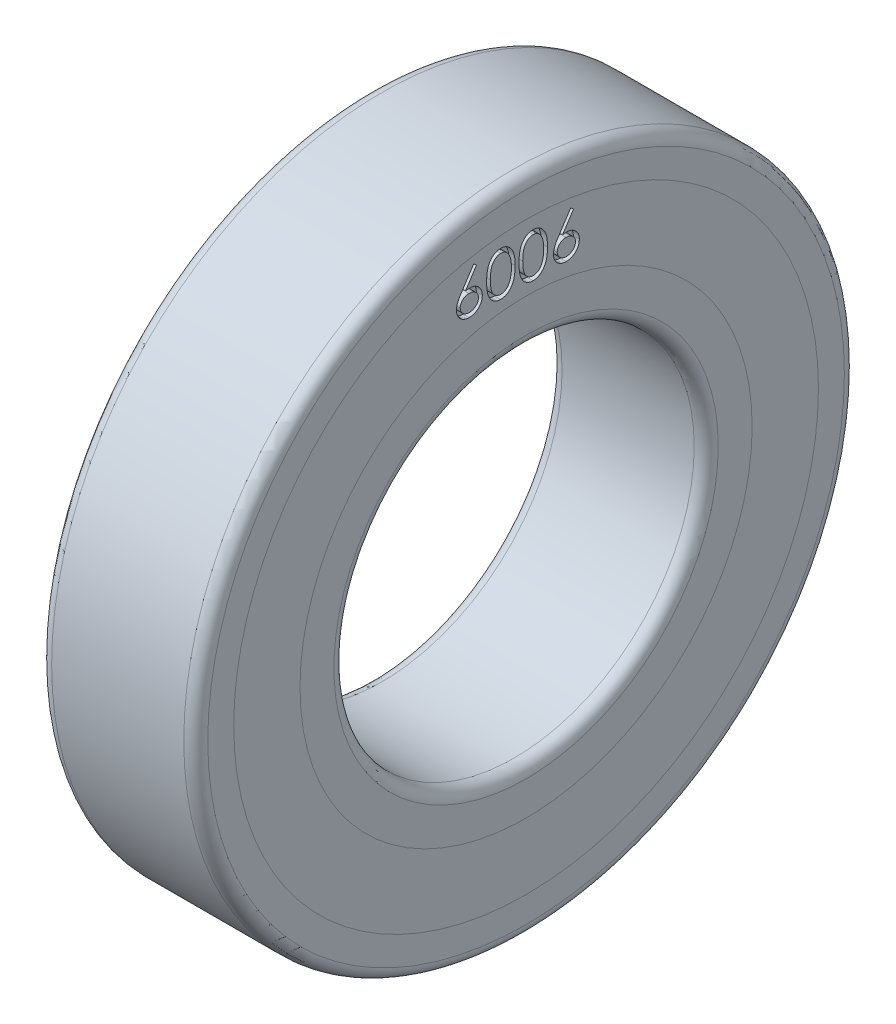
ISO-10303-21;
HEADER;
FILE_DESCRIPTION(('STEP AP214'),'2;1');
FILE_NAME('part.step','',(''),(''),'','','');
FILE_SCHEMA(('AUTOMOTIVE_DESIGN { 1 0 10303 214 1 1 1 1 }'));
ENDSEC;
DATA;
#1=APPLICATION_CONTEXT('core data for automotive mechanical design processes');
#2=APPLICATION_PROTOCOL_DEFINITION('international standard','automotive_design',2000,#1);
#3=PRODUCT_CONTEXT('',#1,'mechanical');
#4=PRODUCT('Part','Part','',(#3));
#5=PRODUCT_RELATED_PRODUCT_CATEGORY('part','',(#4));
#6=PRODUCT_DEFINITION_FORMATION('','',#4);
#7=PRODUCT_DEFINITION_CONTEXT('part definition',#1,'design');
#8=PRODUCT_DEFINITION('design','',#6,#7);
#9=PRODUCT_DEFINITION_SHAPE('','',#8);
#10=(LENGTH_UNIT() NAMED_UNIT(*) SI_UNIT(.MILLI.,.METRE.));
#11=(NAMED_UNIT(*) PLANE_ANGLE_UNIT() SI_UNIT($,.RADIAN.));
#12=(NAMED_UNIT(*) SI_UNIT($,.STERADIAN.) SOLID_ANGLE_UNIT());
#13=UNCERTAINTY_MEASURE_WITH_UNIT(LENGTH_MEASURE(1.E-05),#10,'distance_accuracy_value','');
#14=(GEOMETRIC_REPRESENTATION_CONTEXT(3) GLOBAL_UNCERTAINTY_ASSIGNED_CONTEXT((#13)) GLOBAL_UNIT_ASSIGNED_CONTEXT((#10,
#11,#12)) REPRESENTATION_CONTEXT('',''));
#15=CARTESIAN_POINT('',(0.,0.,0.));
#16=DIRECTION('',(0.,0.,1.));
#17=DIRECTION('',(1.,0.,0.));
#18=AXIS2_PLACEMENT_3D('',#15,#16,#17);
#19=CARTESIAN_POINT('',(13.,0.,0.));
#20=DIRECTION('',(1.,0.,0.));
#21=DIRECTION('',(0.,0.,-1.));
#22=AXIS2_PLACEMENT_3D('',#19,#20,#21);
#23=PLANE('',#22);
#24=CARTESIAN_POINT('',(13.,21.4736343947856,-1.78545271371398));
#25=CARTESIAN_POINT('',(13.,21.4201104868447,-1.78480112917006));
#26=CARTESIAN_POINT('',(13.,21.3158213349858,-1.78353154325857));
#27=CARTESIAN_POINT('',(13.,21.1632903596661,-1.77695283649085));
#28=CARTESIAN_POINT('',(13.,21.0192923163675,-1.76399420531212));
#29=CARTESIAN_POINT('',(13.,20.8834818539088,-1.74778421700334));
#30=CARTESIAN_POINT('',(13.,20.7564242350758,-1.72533325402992));
#31=CARTESIAN_POINT('',(13.,20.6376797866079,-1.69772808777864));
#32=CARTESIAN_POINT('',(13.,20.5267357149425,-1.66707776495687));
#33=CARTESIAN_POINT('',(13.,20.4245009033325,-1.62924297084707));
#34=CARTESIAN_POINT('',(13.,20.3295491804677,-1.58783226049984));
#35=CARTESIAN_POINT('',(13.,20.240882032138,-1.54277706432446));
#36=CARTESIAN_POINT('',(13.,20.1577157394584,-1.49450723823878));
#37=CARTESIAN_POINT('',(13.,20.0807159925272,-1.44191849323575));
#38=CARTESIAN_POINT('',(13.,20.0093373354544,-1.38586508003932));
#39=CARTESIAN_POINT('',(13.,19.9448397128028,-1.32514729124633));
#40=CARTESIAN_POINT('',(13.,19.8856690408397,-1.26147670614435));
#41=CARTESIAN_POINT('',(13.,19.8330174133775,-1.1940642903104));
#42=CARTESIAN_POINT('',(13.,19.7869326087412,-1.12365273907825));
#43=CARTESIAN_POINT('',(13.,19.7457187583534,-1.05169366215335));
#44=CARTESIAN_POINT('',(13.,19.7124860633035,-0.976910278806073));
#45=CARTESIAN_POINT('',(13.,19.6839510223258,-0.900997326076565));
#46=CARTESIAN_POINT('',(13.,19.6621505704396,-0.822868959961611));
#47=CARTESIAN_POINT('',(13.,19.647076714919,-0.742622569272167));
#48=CARTESIAN_POINT('',(13.,19.6365048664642,-0.66066633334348));
#49=CARTESIAN_POINT('',(13.,19.6356983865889,-0.605264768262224));
#50=CARTESIAN_POINT('',(13.,19.6352930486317,-0.577419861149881));
#51=B_SPLINE_CURVE_WITH_KNOTS('',3,(#24,#25,#26,#27,#28,#29,#30,#31,#32,#33,#34,#35,#36,#37,#38,
#39,#40,#41,#42,#43,#44,#45,#46,#47,#48,#49,#50),.UNSPECIFIED.,.F.,.F.,(4,1,1,1,1,1,1,1,1,1,1,1,
1,1,1,1,1,1,1,1,1,1,1,1,4),(0.,0.0650632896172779,0.126773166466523,0.185515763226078,
0.240764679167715,0.292979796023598,0.342250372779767,0.38891928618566,0.432775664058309,
0.474628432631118,0.514774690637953,0.553605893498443,0.591426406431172,0.628028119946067,
0.66380363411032,0.698984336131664,0.733591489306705,0.76762846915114,0.801208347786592,
0.834263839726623,0.866980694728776,0.89971974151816,0.932701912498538,0.96617588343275,1.),.UNSPECIFIED.);
#52=CARTESIAN_POINT('',(13.,21.4736343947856,-1.78545271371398));
#53=VERTEX_POINT('',#52);
#54=CARTESIAN_POINT('',(13.,19.6352930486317,-0.577419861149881));
#55=VERTEX_POINT('',#54);
#56=EDGE_CURVE('E543',#53,#55,#51,.T.);
#57=ORIENTED_EDGE('',*,*,#56,.T.);
#58=CARTESIAN_POINT('',(13.,19.6352930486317,-0.577419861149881));
#59=CARTESIAN_POINT('',(13.,19.6357594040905,-0.549815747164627));
#60=CARTESIAN_POINT('',(13.,19.636678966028,-0.495385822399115));
#61=CARTESIAN_POINT('',(13.,19.6461926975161,-0.414733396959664));
#62=CARTESIAN_POINT('',(13.,19.6614882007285,-0.336450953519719));
#63=CARTESIAN_POINT('',(13.,19.6829048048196,-0.260152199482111));
#64=CARTESIAN_POINT('',(13.,19.709119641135,-0.185445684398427));
#65=CARTESIAN_POINT('',(13.,19.743273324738,-0.113349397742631));
#66=CARTESIAN_POINT('',(13.,19.782607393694,-0.0430617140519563));
#67=CARTESIAN_POINT('',(13.,19.8274028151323,0.025229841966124));
#68=CARTESIAN_POINT('',(13.,19.8787244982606,0.0902420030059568));
#69=CARTESIAN_POINT('',(13.,19.9354887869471,0.152340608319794));
#70=CARTESIAN_POINT('',(13.,19.9991121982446,0.209965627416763));
#71=CARTESIAN_POINT('',(13.,20.0685901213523,0.26359972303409));
#72=CARTESIAN_POINT('',(13.,20.143283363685,0.314573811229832));
#73=CARTESIAN_POINT('',(13.,20.2242117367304,0.361463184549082));
#74=CARTESIAN_POINT('',(13.,20.3110543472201,0.404834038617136));
#75=CARTESIAN_POINT('',(13.,20.4043722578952,0.444477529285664));
#76=CARTESIAN_POINT('',(13.,20.5055271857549,0.479626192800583));
#77=CARTESIAN_POINT('',(13.,20.6156763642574,0.510673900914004));
#78=CARTESIAN_POINT('',(13.,20.7357920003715,0.53518805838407));
#79=CARTESIAN_POINT('',(13.,20.8649093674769,0.556171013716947));
#80=CARTESIAN_POINT('',(13.,21.0035832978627,0.573095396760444));
#81=CARTESIAN_POINT('',(13.,21.1518890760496,0.584649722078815));
#82=CARTESIAN_POINT('',(13.,21.3097342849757,0.591791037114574));
#83=CARTESIAN_POINT('',(13.,21.4180040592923,0.592426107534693));
#84=CARTESIAN_POINT('',(13.,21.4736343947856,0.592752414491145));
#85=B_SPLINE_CURVE_WITH_KNOTS('',3,(#58,#59,#60,#61,#62,#63,#64,#65,#66,#67,#68,#69,#70,#71,#72,
#73,#74,#75,#76,#77,#78,#79,#80,#81,#82,#83,#84),.UNSPECIFIED.,.F.,.F.,(4,1,1,1,1,1,1,1,1,1,1,1,
1,1,1,1,1,1,1,1,1,1,1,1,4),(0.,0.0337871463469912,0.0666216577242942,0.0992848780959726,
0.131361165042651,0.163585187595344,0.196103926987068,0.228902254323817,0.262158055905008,
0.295991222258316,0.3302178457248,0.365059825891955,0.400950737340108,0.437620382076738,
0.475707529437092,0.515380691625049,0.556413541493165,0.599764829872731,0.646424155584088,
0.696431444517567,0.749781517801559,0.806573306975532,0.8674355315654,0.931886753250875,1.),.UNSPECIFIED.);
#86=CARTESIAN_POINT('',(13.,21.4736343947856,0.592752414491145));
#87=VERTEX_POINT('',#86);
#88=EDGE_CURVE('E515',#55,#87,#85,.T.);
#89=ORIENTED_EDGE('',*,*,#88,.T.);
#90=CARTESIAN_POINT('',(13.,21.4736343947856,0.592752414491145));
#91=CARTESIAN_POINT('',(13.,21.5297317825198,0.59242439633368));
#92=CARTESIAN_POINT('',(13.,21.6387017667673,0.591787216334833));
#93=CARTESIAN_POINT('',(13.,21.7974864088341,0.584698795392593));
#94=CARTESIAN_POINT('',(13.,21.9464466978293,0.572923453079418));
#95=CARTESIAN_POINT('',(13.,22.0855897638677,0.556786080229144));
#96=CARTESIAN_POINT('',(13.,22.2149515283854,0.53714810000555));
#97=CARTESIAN_POINT('',(13.,22.3341862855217,0.510932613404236));
#98=CARTESIAN_POINT('',(13.,22.4438458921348,0.481119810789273));
#99=CARTESIAN_POINT('',(13.,22.5442879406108,0.446567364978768));
#100=CARTESIAN_POINT('',(13.,22.6368656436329,0.407579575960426));
#101=CARTESIAN_POINT('',(13.,22.7232908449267,0.365145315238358));
#102=CARTESIAN_POINT('',(13.,22.8034327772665,0.317580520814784));
#103=CARTESIAN_POINT('',(13.,22.8785705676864,0.267603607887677));
#104=CARTESIAN_POINT('',(13.,22.9474742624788,0.213191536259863));
#105=CARTESIAN_POINT('',(13.,23.0111169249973,0.155892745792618));
#106=CARTESIAN_POINT('',(13.,23.0680276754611,0.0934708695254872));
#107=CARTESIAN_POINT('',(13.,23.1198739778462,0.0280478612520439));
#108=CARTESIAN_POINT('',(13.,23.1653234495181,-0.0409686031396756));
#109=CARTESIAN_POINT('',(13.,23.2053561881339,-0.11161126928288));
#110=CARTESIAN_POINT('',(13.,23.2395560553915,-0.184366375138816));
#111=CARTESIAN_POINT('',(13.,23.266446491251,-0.259432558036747));
#112=CARTESIAN_POINT('',(13.,23.2886573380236,-0.336135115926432));
#113=CARTESIAN_POINT('',(13.,23.3038462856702,-0.414742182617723));
#114=CARTESIAN_POINT('',(13.,23.3134031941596,-0.495383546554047));
#115=CARTESIAN_POINT('',(13.,23.3143168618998,-0.549814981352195));
#116=CARTESIAN_POINT('',(13.,23.3147802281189,-0.577419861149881));
#117=B_SPLINE_CURVE_WITH_KNOTS('',3,(#90,#91,#92,#93,#94,#95,#96,#97,#98,#99,#100,#101,#102,
#103,#104,#105,#106,#107,#108,#109,#110,#111,#112,#113,#114,#115,#116),.UNSPECIFIED.,.F.,.F.,(4,
1,1,1,1,1,1,1,1,1,1,1,1,1,1,1,1,1,1,1,1,1,1,1,4),(0.,0.068594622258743,0.133246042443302,
0.194312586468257,0.251279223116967,0.304513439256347,0.354234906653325,0.40048058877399,
0.443410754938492,0.484014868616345,0.523252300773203,0.56104237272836,0.597900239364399,
0.633518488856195,0.668314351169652,0.702495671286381,0.736685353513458,0.770293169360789,
0.803437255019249,0.835912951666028,0.868460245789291,0.900846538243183,0.933466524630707,
0.966257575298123,1.),.UNSPECIFIED.);
#118=CARTESIAN_POINT('',(13.,23.3147802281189,-0.577419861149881));
#119=VERTEX_POINT('',#118);
#120=EDGE_CURVE('E524',#87,#119,#117,.T.);
#121=ORIENTED_EDGE('',*,*,#120,.T.);
#122=CARTESIAN_POINT('',(13.,23.3147802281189,-0.577419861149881));
#123=CARTESIAN_POINT('',(13.,23.3142924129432,-0.605255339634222));
#124=CARTESIAN_POINT('',(13.,23.313322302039,-0.660611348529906));
#125=CARTESIAN_POINT('',(13.,23.3039983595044,-0.742451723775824));
#126=CARTESIAN_POINT('',(13.,23.2885272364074,-0.822401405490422));
#127=CARTESIAN_POINT('',(13.,23.2666062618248,-0.900119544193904));
#128=CARTESIAN_POINT('',(13.,23.2394105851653,-0.976244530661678));
#129=CARTESIAN_POINT('',(13.,23.2053234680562,-1.05018093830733));
#130=CARTESIAN_POINT('',(13.,23.1656446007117,-1.12238801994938));
#131=CARTESIAN_POINT('',(13.,23.1190207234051,-1.19171830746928));
#132=CARTESIAN_POINT('',(13.,23.0670384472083,-1.25893292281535));
#133=CARTESIAN_POINT('',(13.,23.008275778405,-1.32238088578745));
#134=CARTESIAN_POINT('',(13.,22.9433260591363,-1.38206797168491));
#135=CARTESIAN_POINT('',(13.,22.8728841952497,-1.43874327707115));
#136=CARTESIAN_POINT('',(13.,22.7955991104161,-1.49079887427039));
#137=CARTESIAN_POINT('',(13.,22.712815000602,-1.54037230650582));
#138=CARTESIAN_POINT('',(13.,22.6230841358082,-1.58474434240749));
#139=CARTESIAN_POINT('',(13.,22.5279036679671,-1.62747901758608));
#140=CARTESIAN_POINT('',(13.,22.4246400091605,-1.66436600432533));
#141=CARTESIAN_POINT('',(13.,22.3138752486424,-1.69763224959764));
#142=CARTESIAN_POINT('',(13.,22.194301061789,-1.72451121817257));
#143=CARTESIAN_POINT('',(13.,22.0665448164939,-1.74690049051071));
#144=CARTESIAN_POINT('',(13.,21.9301373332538,-1.76424538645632));
#145=CARTESIAN_POINT('',(13.,21.785371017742,-1.77687802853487));
#146=CARTESIAN_POINT('',(13.,21.6321506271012,-1.78355111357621));
#147=CARTESIAN_POINT('',(13.,21.5273927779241,-1.78480781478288));
#148=CARTESIAN_POINT('',(13.,21.4736343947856,-1.78545271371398));
#149=B_SPLINE_CURVE_WITH_KNOTS('',3,(#122,#123,#124,#125,#126,#127,#128,#129,#130,#131,#132,
#133,#134,#135,#136,#137,#138,#139,#140,#141,#142,#143,#144,#145,#146,#147,#148),.UNSPECIFIED.,
.F.,.F.,(4,1,1,1,1,1,1,1,1,1,1,1,1,1,1,1,1,1,1,1,1,1,1,1,4),(0.,0.0337881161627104,
0.0671939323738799,0.0998624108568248,0.132566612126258,0.165151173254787,0.197913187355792,
0.231319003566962,0.265083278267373,0.299255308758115,0.334398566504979,0.369942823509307,
0.40628356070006,0.444063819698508,0.482997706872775,0.523354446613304,0.565536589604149,
0.609612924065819,0.656390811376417,0.705885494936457,0.75832450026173,0.81383178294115,
0.872794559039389,0.934722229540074,1.),.UNSPECIFIED.);
#150=EDGE_CURVE('E534',#119,#53,#149,.T.);
#151=ORIENTED_EDGE('',*,*,#150,.T.);
#152=EDGE_LOOP('',(#57,#89,#121,#151));
#153=FACE_BOUND('',#152,.T.);
#154=CARTESIAN_POINT('',(13.,20.7009981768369,5.79788061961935));
#155=CARTESIAN_POINT('',(13.,20.7370427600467,5.79669917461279));
#156=CARTESIAN_POINT('',(13.,20.8106389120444,5.79428688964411));
#157=CARTESIAN_POINT('',(13.,20.9221029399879,5.77744349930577));
#158=CARTESIAN_POINT('',(13.,21.0361540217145,5.75037870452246));
#159=CARTESIAN_POINT('',(13.,21.1329082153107,5.72006845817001));
#160=CARTESIAN_POINT('',(13.,21.2121697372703,5.68804284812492));
#161=CARTESIAN_POINT('',(13.,21.2760732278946,5.66139030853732));
#162=CARTESIAN_POINT('',(13.,21.3418343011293,5.62821631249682));
#163=CARTESIAN_POINT('',(13.,21.4117079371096,5.5928429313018));
#164=CARTESIAN_POINT('',(13.,21.4838933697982,5.55208606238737));
#165=CARTESIAN_POINT('',(13.,21.5595970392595,5.50777041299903));
#166=CARTESIAN_POINT('',(13.,21.6376149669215,5.4586707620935));
#167=CARTESIAN_POINT('',(13.,21.6905591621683,5.42425059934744));
#168=CARTESIAN_POINT('',(13.,21.717624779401,5.40665465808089));
#169=B_SPLINE_CURVE_WITH_KNOTS('',3,(#154,#155,#156,#157,#158,#159,#160,#161,#162,#163,#164,
#165,#166,#167,#168),.UNSPECIFIED.,.F.,.F.,(4,1,1,1,1,1,1,1,1,1,1,1,4),(0.,0.0978181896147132,
0.199726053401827,0.305276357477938,0.41581149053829,0.47447223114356,0.537273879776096,
0.603657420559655,0.674298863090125,0.749834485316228,0.828598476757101,0.912377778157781,1.),.UNSPECIFIED.);
#170=CARTESIAN_POINT('',(13.,20.7009981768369,5.79788061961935));
#171=VERTEX_POINT('',#170);
#172=CARTESIAN_POINT('',(13.,21.717624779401,5.40665465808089));
#173=VERTEX_POINT('',#172);
#174=EDGE_CURVE('E772',#171,#173,#169,.T.);
#175=ORIENTED_EDGE('',*,*,#174,.T.);
#176=DIRECTION('',(0.,0.836878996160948,-0.547387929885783));
#177=VECTOR('',#176,1.);
#178=CARTESIAN_POINT('',(13.,21.717624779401,5.40665465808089));
#179=LINE('',#178,#177);
#180=CARTESIAN_POINT('',(13.,23.3147802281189,4.36198318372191));
#181=VERTEX_POINT('',#180);
#182=EDGE_CURVE('E723',#173,#181,#179,.T.);
#183=ORIENTED_EDGE('',*,*,#182,.T.);
#184=DIRECTION('',(0.,-0.617720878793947,-0.786397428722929));
#185=VECTOR('',#184,1.);
#186=CARTESIAN_POINT('',(13.,23.3147802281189,4.36198318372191));
#187=LINE('',#186,#185);
#188=CARTESIAN_POINT('',(13.,23.1247762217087,4.12009616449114));
#189=VERTEX_POINT('',#188);
#190=EDGE_CURVE('E730',#181,#189,#187,.T.);
#191=ORIENTED_EDGE('',*,*,#190,.T.);
#192=DIRECTION('',(0.,-0.836933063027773,0.547305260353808));
#193=VECTOR('',#192,1.);
#194=CARTESIAN_POINT('',(13.,23.1247762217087,4.12009616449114));
#195=LINE('',#194,#193);
#196=CARTESIAN_POINT('',(13.,21.7106135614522,5.04487581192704));
#197=VERTEX_POINT('',#196);
#198=EDGE_CURVE('E735',#189,#197,#195,.T.);
#199=ORIENTED_EDGE('',*,*,#198,.T.);
#200=CARTESIAN_POINT('',(13.,21.7106135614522,5.04487581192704));
#201=CARTESIAN_POINT('',(13.,21.7204274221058,4.98330553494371));
#202=CARTESIAN_POINT('',(13.,21.739570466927,4.86320574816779));
#203=CARTESIAN_POINT('',(13.,21.7427284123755,4.74163984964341));
#204=CARTESIAN_POINT('',(13.,21.7442674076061,4.68239584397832));
#205=B_SPLINE_CURVE_WITH_KNOTS('',3,(#200,#201,#202,#203,#204),.UNSPECIFIED.,.F.,.F.,(4,1,4),
(0.,0.512659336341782,1.),.UNSPECIFIED.);
#206=CARTESIAN_POINT('',(13.,21.7442674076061,4.68239584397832));
#207=VERTEX_POINT('',#206);
#208=EDGE_CURVE('E739',#197,#207,#205,.T.);
#209=ORIENTED_EDGE('',*,*,#208,.T.);
#210=CARTESIAN_POINT('',(13.,21.7442674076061,4.68239584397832));
#211=CARTESIAN_POINT('',(13.,21.7433112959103,4.64682334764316));
#212=CARTESIAN_POINT('',(13.,21.7414292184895,4.57679994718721));
#213=CARTESIAN_POINT('',(13.,21.7269453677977,4.47399314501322));
#214=CARTESIAN_POINT('',(13.,21.7041202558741,4.37520420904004));
#215=CARTESIAN_POINT('',(13.,21.6708479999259,4.28084259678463));
#216=CARTESIAN_POINT('',(13.,21.6283456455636,4.19056961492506));
#217=CARTESIAN_POINT('',(13.,21.5774067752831,4.10386721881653));
#218=CARTESIAN_POINT('',(13.,21.5154010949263,4.02236520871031));
#219=CARTESIAN_POINT('',(13.,21.4461361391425,3.94501402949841));
#220=CARTESIAN_POINT('',(13.,21.3694191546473,3.87478693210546));
#221=CARTESIAN_POINT('',(13.,21.2880178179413,3.81261087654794));
#222=CARTESIAN_POINT('',(13.,21.2020169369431,3.76038408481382));
#223=CARTESIAN_POINT('',(13.,21.1114600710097,3.71801016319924));
#224=CARTESIAN_POINT('',(13.,21.0164868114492,3.68510528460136));
#225=CARTESIAN_POINT('',(13.,20.9172186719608,3.66111763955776));
#226=CARTESIAN_POINT('',(13.,20.8135872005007,3.64693804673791));
#227=CARTESIAN_POINT('',(13.,20.7431090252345,3.64501255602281));
#228=CARTESIAN_POINT('',(13.,20.7073082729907,3.6440344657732));
#229=B_SPLINE_CURVE_WITH_KNOTS('',3,(#210,#211,#212,#213,#214,#215,#216,#217,#218,#219,#220,
#221,#222,#223,#224,#225,#226,#227,#228),.UNSPECIFIED.,.F.,.F.,(4,1,1,1,1,1,1,1,1,1,1,1,1,1,1,1,
4),(0.,0.0652308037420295,0.128404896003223,0.190067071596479,0.25094336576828,
0.311545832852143,0.372862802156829,0.435023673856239,0.499071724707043,0.563091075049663,
0.625510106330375,0.686680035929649,0.747282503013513,0.808563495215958,0.870742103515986,
0.934340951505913,1.),.UNSPECIFIED.);
#230=CARTESIAN_POINT('',(13.,20.7073082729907,3.6440344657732));
#231=VERTEX_POINT('',#230);
#232=EDGE_CURVE('E745',#207,#231,#229,.T.);
#233=ORIENTED_EDGE('',*,*,#232,.T.);
#234=CARTESIAN_POINT('',(13.,20.7073082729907,3.6440344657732));
#235=CARTESIAN_POINT('',(13.,20.6583285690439,3.64545757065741));
#236=CARTESIAN_POINT('',(13.,20.5619481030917,3.64825790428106));
#237=CARTESIAN_POINT('',(13.,20.4215713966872,3.67616170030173));
#238=CARTESIAN_POINT('',(13.,20.2878388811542,3.71952134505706));
#239=CARTESIAN_POINT('',(13.,20.1628857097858,3.7814988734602));
#240=CARTESIAN_POINT('',(13.,20.0468831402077,3.85848125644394));
#241=CARTESIAN_POINT('',(13.,19.944097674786,3.95235884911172));
#242=CARTESIAN_POINT('',(13.,19.8524276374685,4.0598023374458));
#243=CARTESIAN_POINT('',(13.,19.7757710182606,4.18128913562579));
#244=CARTESIAN_POINT('',(13.,19.7131679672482,4.31203209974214));
#245=CARTESIAN_POINT('',(13.,19.6682027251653,4.44938409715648));
#246=CARTESIAN_POINT('',(13.,19.6405192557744,4.59201124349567));
#247=CARTESIAN_POINT('',(13.,19.6370486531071,4.68881585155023));
#248=CARTESIAN_POINT('',(13.,19.6352930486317,4.7377844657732));
#249=B_SPLINE_CURVE_WITH_KNOTS('',3,(#234,#235,#236,#237,#238,#239,#240,#241,#242,#243,#244,
#245,#246,#247,#248),.UNSPECIFIED.,.F.,.F.,(4,1,1,1,1,1,1,1,1,1,1,1,4),(0.,0.0859479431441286,
0.169125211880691,0.250399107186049,0.332289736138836,0.413364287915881,0.494172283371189,
0.576021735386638,0.660756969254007,0.745783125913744,0.830043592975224,0.914027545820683,1.),.UNSPECIFIED.);
#250=CARTESIAN_POINT('',(13.,19.6352930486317,4.7377844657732));
#251=VERTEX_POINT('',#250);
#252=EDGE_CURVE('E754',#231,#251,#249,.T.);
#253=ORIENTED_EDGE('',*,*,#252,.T.);
#254=CARTESIAN_POINT('',(13.,19.6352930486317,4.7377844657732));
#255=CARTESIAN_POINT('',(13.,19.6368212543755,4.7848811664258));
#256=CARTESIAN_POINT('',(13.,19.6398483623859,4.87817148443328));
#257=CARTESIAN_POINT('',(13.,19.6668143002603,5.01540427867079));
#258=CARTESIAN_POINT('',(13.,19.710521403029,5.14726729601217));
#259=CARTESIAN_POINT('',(13.,19.770735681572,5.2728366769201));
#260=CARTESIAN_POINT('',(13.,19.8467935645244,5.38915728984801));
#261=CARTESIAN_POINT('',(13.,19.9383558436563,5.49322292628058));
#262=CARTESIAN_POINT('',(13.,20.0434653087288,5.58451470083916));
#263=CARTESIAN_POINT('',(13.,20.1621056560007,5.66048932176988));
#264=CARTESIAN_POINT('',(13.,20.2895956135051,5.7207480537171));
#265=CARTESIAN_POINT('',(13.,20.4225327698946,5.76593797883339));
#266=CARTESIAN_POINT('',(13.,20.5604327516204,5.7923342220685));
#267=CARTESIAN_POINT('',(13.,20.6539138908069,5.79602277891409));
#268=CARTESIAN_POINT('',(13.,20.7009981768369,5.79788061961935));
#269=B_SPLINE_CURVE_WITH_KNOTS('',3,(#254,#255,#256,#257,#258,#259,#260,#261,#262,#263,#264,
#265,#266,#267,#268),.UNSPECIFIED.,.F.,.F.,(4,1,1,1,1,1,1,1,1,1,1,1,4),(0.,0.0843347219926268,
0.167052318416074,0.249566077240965,0.332740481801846,0.415914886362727,0.497828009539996,
0.580372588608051,0.664600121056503,0.749466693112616,0.832510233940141,0.915639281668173,1.),.UNSPECIFIED.);
#270=EDGE_CURVE('E763',#251,#171,#269,.T.);
#271=ORIENTED_EDGE('',*,*,#270,.T.);
#272=EDGE_LOOP('',(#175,#183,#191,#199,#209,#233,#253,#271));
#273=FACE_BOUND('',#272,.T.);
#274=CARTESIAN_POINT('',(13.,0.,0.));
#275=DIRECTION('',(1.,0.,0.));
#276=DIRECTION('',(0.,0.,-1.));
#277=AXIS2_PLACEMENT_3D('',#274,#275,#276);
#278=CIRCLE('',#277,24.3394062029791);
#279=CARTESIAN_POINT('',(13.,0.,-24.3394062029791));
#280=VERTEX_POINT('',#279);
#281=EDGE_CURVE('E42',#280,#280,#278,.F.);
#282=ORIENTED_EDGE('',*,*,#281,.F.);
#283=EDGE_LOOP('',(#282));
#284=FACE_BOUND('',#283,.T.);
#285=CARTESIAN_POINT('',(13.,0.,0.));
#286=DIRECTION('',(1.,0.,0.));
#287=DIRECTION('',(0.,0.,-1.));
#288=AXIS2_PLACEMENT_3D('',#285,#286,#287);
#289=CIRCLE('',#288,18.8225759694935);
#290=CARTESIAN_POINT('',(13.,0.,-18.8225759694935));
#291=VERTEX_POINT('',#290);
#292=EDGE_CURVE('E841',#291,#291,#289,.F.);
#293=ORIENTED_EDGE('',*,*,#292,.T.);
#294=EDGE_LOOP('',(#293));
#295=FACE_BOUND('',#294,.T.);
#296=CARTESIAN_POINT('',(13.,21.4736343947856,0.906854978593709));
#297=CARTESIAN_POINT('',(13.,21.4201104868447,0.907506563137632));
#298=CARTESIAN_POINT('',(13.,21.3158213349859,0.90877614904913));
#299=CARTESIAN_POINT('',(13.,21.1632903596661,0.915354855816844));
#300=CARTESIAN_POINT('',(13.,21.0192923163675,0.928313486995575));
#301=CARTESIAN_POINT('',(13.,20.8834818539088,0.944523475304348));
#302=CARTESIAN_POINT('',(13.,20.7564242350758,0.966974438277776));
#303=CARTESIAN_POINT('',(13.,20.6376797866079,0.994579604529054));
#304=CARTESIAN_POINT('',(13.,20.5267357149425,1.02522992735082));
#305=CARTESIAN_POINT('',(13.,20.4245009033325,1.06306472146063));
#306=CARTESIAN_POINT('',(13.,20.3295491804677,1.10447543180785));
#307=CARTESIAN_POINT('',(13.,20.240882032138,1.14953062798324));
#308=CARTESIAN_POINT('',(13.,20.1577157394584,1.19780045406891));
#309=CARTESIAN_POINT('',(13.,20.0807159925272,1.25038919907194));
#310=CARTESIAN_POINT('',(13.,20.0093373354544,1.30644261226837));
#311=CARTESIAN_POINT('',(13.,19.9448397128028,1.36716040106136));
#312=CARTESIAN_POINT('',(13.,19.8856690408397,1.43083098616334));
#313=CARTESIAN_POINT('',(13.,19.8330174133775,1.49824340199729));
#314=CARTESIAN_POINT('',(13.,19.7869326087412,1.56865495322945));
#315=CARTESIAN_POINT('',(13.,19.7457187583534,1.64061403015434));
#316=CARTESIAN_POINT('',(13.,19.7124860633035,1.71539741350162));
#317=CARTESIAN_POINT('',(13.,19.6839510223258,1.79131036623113));
#318=CARTESIAN_POINT('',(13.,19.6621505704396,1.86943873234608));
#319=CARTESIAN_POINT('',(13.,19.647076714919,1.94968512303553));
#320=CARTESIAN_POINT('',(13.,19.6365048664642,2.03164135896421));
#321=CARTESIAN_POINT('',(13.,19.6356983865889,2.08704292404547));
#322=CARTESIAN_POINT('',(13.,19.6352930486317,2.11488783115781));
#323=B_SPLINE_CURVE_WITH_KNOTS('',3,(#296,#297,#298,#299,#300,#301,#302,#303,#304,#305,#306,
#307,#308,#309,#310,#311,#312,#313,#314,#315,#316,#317,#318,#319,#320,#321,#322),.UNSPECIFIED.,
.F.,.F.,(4,1,1,1,1,1,1,1,1,1,1,1,1,1,1,1,1,1,1,1,1,1,1,1,4),(0.,0.0650632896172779,
0.126773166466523,0.185515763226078,0.240764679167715,0.292979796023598,0.342250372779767,
0.38891928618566,0.432775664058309,0.474628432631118,0.514774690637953,0.553605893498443,
0.591426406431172,0.628028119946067,0.66380363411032,0.698984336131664,0.733591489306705,
0.76762846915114,0.801208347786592,0.834263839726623,0.866980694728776,0.89971974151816,
0.932701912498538,0.96617588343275,1.),.UNSPECIFIED.);
#324=CARTESIAN_POINT('',(13.,21.4736343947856,0.906854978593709));
#325=VERTEX_POINT('',#324);
#326=CARTESIAN_POINT('',(13.,19.6352930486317,2.11488783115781));
#327=VERTEX_POINT('',#326);
#328=EDGE_CURVE('E647',#325,#327,#323,.T.);
#329=ORIENTED_EDGE('',*,*,#328,.T.);
#330=CARTESIAN_POINT('',(13.,19.6352930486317,2.11488783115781));
#331=CARTESIAN_POINT('',(13.,19.6357594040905,2.14249194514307));
#332=CARTESIAN_POINT('',(13.,19.636678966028,2.19692186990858));
#333=CARTESIAN_POINT('',(13.,19.6461926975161,2.27757429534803));
#334=CARTESIAN_POINT('',(13.,19.6614882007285,2.35585673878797));
#335=CARTESIAN_POINT('',(13.,19.6829048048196,2.43215549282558));
#336=CARTESIAN_POINT('',(13.,19.709119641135,2.50686200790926));
#337=CARTESIAN_POINT('',(13.,19.743273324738,2.57895829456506));
#338=CARTESIAN_POINT('',(13.,19.782607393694,2.64924597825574));
#339=CARTESIAN_POINT('',(13.,19.8274028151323,2.71753753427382));
#340=CARTESIAN_POINT('',(13.,19.8787244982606,2.78254969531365));
#341=CARTESIAN_POINT('',(13.,19.9354887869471,2.84464830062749));
#342=CARTESIAN_POINT('',(13.,19.9991121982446,2.90227331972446));
#343=CARTESIAN_POINT('',(13.,20.0685901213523,2.95590741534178));
#344=CARTESIAN_POINT('',(13.,20.143283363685,3.00688150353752));
#345=CARTESIAN_POINT('',(13.,20.2242117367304,3.05377087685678));
#346=CARTESIAN_POINT('',(13.,20.31105434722,3.09714173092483));
#347=CARTESIAN_POINT('',(13.,20.4043722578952,3.13678522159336));
#348=CARTESIAN_POINT('',(13.,20.5055271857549,3.17193388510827));
#349=CARTESIAN_POINT('',(13.,20.6156763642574,3.2029815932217));
#350=CARTESIAN_POINT('',(13.,20.7357920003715,3.22749575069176));
#351=CARTESIAN_POINT('',(13.,20.8649093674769,3.24847870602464));
#352=CARTESIAN_POINT('',(13.,21.0035832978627,3.26540308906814));
#353=CARTESIAN_POINT('',(13.,21.1518890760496,3.27695741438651));
#354=CARTESIAN_POINT('',(13.,21.3097342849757,3.28409872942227));
#355=CARTESIAN_POINT('',(13.,21.4180040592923,3.28473379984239));
#356=CARTESIAN_POINT('',(13.,21.4736343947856,3.28506010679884));
#357=B_SPLINE_CURVE_WITH_KNOTS('',3,(#330,#331,#332,#333,#334,#335,#336,#337,#338,#339,#340,
#341,#342,#343,#344,#345,#346,#347,#348,#349,#350,#351,#352,#353,#354,#355,#356),.UNSPECIFIED.,
.F.,.F.,(4,1,1,1,1,1,1,1,1,1,1,1,1,1,1,1,1,1,1,1,1,1,1,1,4),(0.,0.0337871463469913,
0.066621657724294,0.0992848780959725,0.131361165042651,0.163585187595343,0.196103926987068,
0.228902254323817,0.262158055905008,0.295991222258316,0.3302178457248,0.365059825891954,
0.400950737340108,0.437620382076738,0.475707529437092,0.515380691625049,0.556413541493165,
0.599764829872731,0.646424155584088,0.696431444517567,0.749781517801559,0.806573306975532,
0.867435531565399,0.931886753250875,1.),.UNSPECIFIED.);
#358=CARTESIAN_POINT('',(13.,21.4736343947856,3.28506010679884));
#359=VERTEX_POINT('',#358);
#360=EDGE_CURVE('E619',#327,#359,#357,.T.);
#361=ORIENTED_EDGE('',*,*,#360,.T.);
#362=CARTESIAN_POINT('',(13.,21.4736343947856,3.28506010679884));
#363=CARTESIAN_POINT('',(13.,21.5297317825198,3.28473208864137));
#364=CARTESIAN_POINT('',(13.,21.6387017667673,3.28409490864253));
#365=CARTESIAN_POINT('',(13.,21.7974864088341,3.27700648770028));
#366=CARTESIAN_POINT('',(13.,21.9464466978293,3.26523114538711));
#367=CARTESIAN_POINT('',(13.,22.0855897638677,3.24909377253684));
#368=CARTESIAN_POINT('',(13.,22.2149515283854,3.22945579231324));
#369=CARTESIAN_POINT('',(13.,22.3341862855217,3.20324030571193));
#370=CARTESIAN_POINT('',(13.,22.4438458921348,3.17342750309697));
#371=CARTESIAN_POINT('',(13.,22.5442879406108,3.13887505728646));
#372=CARTESIAN_POINT('',(13.,22.636865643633,3.09988726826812));
#373=CARTESIAN_POINT('',(13.,22.7232908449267,3.05745300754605));
#374=CARTESIAN_POINT('',(13.,22.8034327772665,3.00988821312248));
#375=CARTESIAN_POINT('',(13.,22.8785705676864,2.95991130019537));
#376=CARTESIAN_POINT('',(13.,22.9474742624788,2.90549922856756));
#377=CARTESIAN_POINT('',(13.,23.0111169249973,2.84820043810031));
#378=CARTESIAN_POINT('',(13.,23.0680276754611,2.78577856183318));
#379=CARTESIAN_POINT('',(13.,23.1198739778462,2.72035555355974));
#380=CARTESIAN_POINT('',(13.,23.1653234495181,2.65133908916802));
#381=CARTESIAN_POINT('',(13.,23.2053561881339,2.58069642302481));
#382=CARTESIAN_POINT('',(13.,23.2395560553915,2.50794131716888));
#383=CARTESIAN_POINT('',(13.,23.266446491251,2.43287513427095));
#384=CARTESIAN_POINT('',(13.,23.2886573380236,2.35617257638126));
#385=CARTESIAN_POINT('',(13.,23.3038462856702,2.27756550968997));
#386=CARTESIAN_POINT('',(13.,23.3134031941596,2.19692414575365));
#387=CARTESIAN_POINT('',(13.,23.3143168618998,2.1424927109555));
#388=CARTESIAN_POINT('',(13.,23.3147802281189,2.11488783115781));
#389=B_SPLINE_CURVE_WITH_KNOTS('',3,(#362,#363,#364,#365,#366,#367,#368,#369,#370,#371,#372,
#373,#374,#375,#376,#377,#378,#379,#380,#381,#382,#383,#384,#385,#386,#387,#388),.UNSPECIFIED.,
.F.,.F.,(4,1,1,1,1,1,1,1,1,1,1,1,1,1,1,1,1,1,1,1,1,1,1,1,4),(0.,0.068594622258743,
0.133246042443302,0.194312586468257,0.251279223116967,0.304513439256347,0.354234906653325,
0.40048058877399,0.443410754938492,0.484014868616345,0.523252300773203,0.56104237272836,
0.5979002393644,0.633518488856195,0.668314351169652,0.702495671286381,0.736685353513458,
0.770293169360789,0.803437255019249,0.835912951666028,0.868460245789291,0.900846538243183,
0.933466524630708,0.966257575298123,1.),.UNSPECIFIED.);
#390=CARTESIAN_POINT('',(13.,23.3147802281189,2.11488783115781));
#391=VERTEX_POINT('',#390);
#392=EDGE_CURVE('E628',#359,#391,#389,.T.);
#393=ORIENTED_EDGE('',*,*,#392,.T.);
#394=CARTESIAN_POINT('',(13.,23.3147802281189,2.11488783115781));
#395=CARTESIAN_POINT('',(13.,23.3142924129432,2.08705235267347));
#396=CARTESIAN_POINT('',(13.,23.313322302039,2.03169634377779));
#397=CARTESIAN_POINT('',(13.,23.3039983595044,1.94985596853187));
#398=CARTESIAN_POINT('',(13.,23.2885272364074,1.86990628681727));
#399=CARTESIAN_POINT('',(13.,23.2666062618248,1.79218814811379));
#400=CARTESIAN_POINT('',(13.,23.2394105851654,1.71606316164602));
#401=CARTESIAN_POINT('',(13.,23.2053234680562,1.64212675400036));
#402=CARTESIAN_POINT('',(13.,23.1656446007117,1.56991967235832));
#403=CARTESIAN_POINT('',(13.,23.1190207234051,1.50058938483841));
#404=CARTESIAN_POINT('',(13.,23.0670384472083,1.43337476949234));
#405=CARTESIAN_POINT('',(13.,23.008275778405,1.36992680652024));
#406=CARTESIAN_POINT('',(13.,22.9433260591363,1.31023972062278));
#407=CARTESIAN_POINT('',(13.,22.8728841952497,1.25356441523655));
#408=CARTESIAN_POINT('',(13.,22.7955991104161,1.2015088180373));
#409=CARTESIAN_POINT('',(13.,22.712815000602,1.15193538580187));
#410=CARTESIAN_POINT('',(13.,22.6230841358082,1.10756334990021));
#411=CARTESIAN_POINT('',(13.,22.5279036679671,1.06482867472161));
#412=CARTESIAN_POINT('',(13.,22.4246400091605,1.02794168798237));
#413=CARTESIAN_POINT('',(13.,22.3138752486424,0.994675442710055));
#414=CARTESIAN_POINT('',(13.,22.194301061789,0.967796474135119));
#415=CARTESIAN_POINT('',(13.,22.0665448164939,0.945407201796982));
#416=CARTESIAN_POINT('',(13.,21.9301373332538,0.928062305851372));
#417=CARTESIAN_POINT('',(13.,21.785371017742,0.91542966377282));
#418=CARTESIAN_POINT('',(13.,21.6321506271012,0.908756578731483));
#419=CARTESIAN_POINT('',(13.,21.5273927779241,0.907499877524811));
#420=CARTESIAN_POINT('',(13.,21.4736343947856,0.906854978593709));
#421=B_SPLINE_CURVE_WITH_KNOTS('',3,(#394,#395,#396,#397,#398,#399,#400,#401,#402,#403,#404,
#405,#406,#407,#408,#409,#410,#411,#412,#413,#414,#415,#416,#417,#418,#419,#420),.UNSPECIFIED.,
.F.,.F.,(4,1,1,1,1,1,1,1,1,1,1,1,1,1,1,1,1,1,1,1,1,1,1,1,4),(0.,0.0337881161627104,
0.0671939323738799,0.0998624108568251,0.132566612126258,0.165151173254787,0.197913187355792,
0.231319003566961,0.265083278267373,0.299255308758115,0.334398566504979,0.369942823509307,
0.40628356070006,0.444063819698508,0.482997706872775,0.523354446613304,0.565536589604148,
0.609612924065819,0.656390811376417,0.705885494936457,0.75832450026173,0.81383178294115,
0.872794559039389,0.934722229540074,1.),.UNSPECIFIED.);
#422=EDGE_CURVE('E638',#391,#325,#421,.T.);
#423=ORIENTED_EDGE('',*,*,#422,.T.);
#424=EDGE_LOOP('',(#329,#361,#393,#423));
#425=FACE_BOUND('',#424,.T.);
#426=CARTESIAN_POINT('',(13.,20.7009981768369,-2.27904245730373));
#427=CARTESIAN_POINT('',(13.,20.7370427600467,-2.28022390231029));
#428=CARTESIAN_POINT('',(13.,20.8106389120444,-2.28263618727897));
#429=CARTESIAN_POINT('',(13.,20.9221029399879,-2.29947957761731));
#430=CARTESIAN_POINT('',(13.,21.0361540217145,-2.32654437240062));
#431=CARTESIAN_POINT('',(13.,21.1329082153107,-2.35685461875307));
#432=CARTESIAN_POINT('',(13.,21.2121697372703,-2.38888022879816));
#433=CARTESIAN_POINT('',(13.,21.2760732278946,-2.41553276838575));
#434=CARTESIAN_POINT('',(13.,21.3418343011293,-2.44870676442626));
#435=CARTESIAN_POINT('',(13.,21.4117079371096,-2.48408014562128));
#436=CARTESIAN_POINT('',(13.,21.4838933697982,-2.52483701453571));
#437=CARTESIAN_POINT('',(13.,21.5595970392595,-2.56915266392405));
#438=CARTESIAN_POINT('',(13.,21.6376149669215,-2.61825231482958));
#439=CARTESIAN_POINT('',(13.,21.6905591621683,-2.65267247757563));
#440=CARTESIAN_POINT('',(13.,21.717624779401,-2.67026841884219));
#441=B_SPLINE_CURVE_WITH_KNOTS('',3,(#426,#427,#428,#429,#430,#431,#432,#433,#434,#435,#436,
#437,#438,#439,#440),.UNSPECIFIED.,.F.,.F.,(4,1,1,1,1,1,1,1,1,1,1,1,4),(0.,0.0978181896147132,
0.199726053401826,0.305276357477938,0.415811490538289,0.47447223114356,0.537273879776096,
0.603657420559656,0.674298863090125,0.749834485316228,0.828598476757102,0.912377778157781,1.),.UNSPECIFIED.);
#442=CARTESIAN_POINT('',(13.,20.7009981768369,-2.27904245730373));
#443=VERTEX_POINT('',#442);
#444=CARTESIAN_POINT('',(13.,21.717624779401,-2.67026841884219));
#445=VERTEX_POINT('',#444);
#446=EDGE_CURVE('E430',#443,#445,#441,.T.);
#447=ORIENTED_EDGE('',*,*,#446,.T.);
#448=DIRECTION('',(0.,0.836878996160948,-0.547387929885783));
#449=VECTOR('',#448,1.);
#450=CARTESIAN_POINT('',(13.,21.717624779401,-2.67026841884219));
#451=LINE('',#450,#449);
#452=CARTESIAN_POINT('',(13.,23.3147802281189,-3.71493989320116));
#453=VERTEX_POINT('',#452);
#454=EDGE_CURVE('E54',#445,#453,#451,.T.);
#455=ORIENTED_EDGE('',*,*,#454,.T.);
#456=DIRECTION('',(0.,-0.617720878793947,-0.786397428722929));
#457=VECTOR('',#456,1.);
#458=CARTESIAN_POINT('',(13.,23.3147802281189,-3.71493989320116));
#459=LINE('',#458,#457);
#460=CARTESIAN_POINT('',(13.,23.1247762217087,-3.95682691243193));
#461=VERTEX_POINT('',#460);
#462=EDGE_CURVE('E389',#453,#461,#459,.T.);
#463=ORIENTED_EDGE('',*,*,#462,.T.);
#464=DIRECTION('',(0.,-0.836933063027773,0.547305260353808));
#465=VECTOR('',#464,1.);
#466=CARTESIAN_POINT('',(13.,23.1247762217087,-3.95682691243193));
#467=LINE('',#466,#465);
#468=CARTESIAN_POINT('',(13.,21.7106135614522,-3.03204726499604));
#469=VERTEX_POINT('',#468);
#470=EDGE_CURVE('E393',#461,#469,#467,.T.);
#471=ORIENTED_EDGE('',*,*,#470,.T.);
#472=CARTESIAN_POINT('',(13.,21.7106135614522,-3.03204726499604));
#473=CARTESIAN_POINT('',(13.,21.7204274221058,-3.09361754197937));
#474=CARTESIAN_POINT('',(13.,21.739570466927,-3.21371732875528));
#475=CARTESIAN_POINT('',(13.,21.7427284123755,-3.33528322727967));
#476=CARTESIAN_POINT('',(13.,21.7442674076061,-3.39452723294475));
#477=B_SPLINE_CURVE_WITH_KNOTS('',3,(#472,#473,#474,#475,#476),.UNSPECIFIED.,.F.,.F.,(4,1,4),
(0.,0.51265933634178,1.),.UNSPECIFIED.);
#478=CARTESIAN_POINT('',(13.,21.7442674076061,-3.39452723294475));
#479=VERTEX_POINT('',#478);
#480=EDGE_CURVE('E397',#469,#479,#477,.T.);
#481=ORIENTED_EDGE('',*,*,#480,.T.);
#482=CARTESIAN_POINT('',(13.,21.7442674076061,-3.39452723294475));
#483=CARTESIAN_POINT('',(13.,21.7433112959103,-3.43009972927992));
#484=CARTESIAN_POINT('',(13.,21.7414292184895,-3.50012312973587));
#485=CARTESIAN_POINT('',(13.,21.7269453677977,-3.60292993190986));
#486=CARTESIAN_POINT('',(13.,21.7041202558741,-3.70171886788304));
#487=CARTESIAN_POINT('',(13.,21.6708479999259,-3.79608048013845));
#488=CARTESIAN_POINT('',(13.,21.6283456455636,-3.88635346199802));
#489=CARTESIAN_POINT('',(13.,21.5774067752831,-3.97305585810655));
#490=CARTESIAN_POINT('',(13.,21.5154010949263,-4.05455786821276));
#491=CARTESIAN_POINT('',(13.,21.4461361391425,-4.13190904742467));
#492=CARTESIAN_POINT('',(13.,21.3694191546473,-4.20213614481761));
#493=CARTESIAN_POINT('',(13.,21.2880178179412,-4.26431220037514));
#494=CARTESIAN_POINT('',(13.,21.2020169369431,-4.31653899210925));
#495=CARTESIAN_POINT('',(13.,21.1114600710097,-4.35891291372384));
#496=CARTESIAN_POINT('',(13.,21.0164868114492,-4.39181779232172));
#497=CARTESIAN_POINT('',(13.,20.9172186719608,-4.41580543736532));
#498=CARTESIAN_POINT('',(13.,20.8135872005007,-4.42998503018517));
#499=CARTESIAN_POINT('',(13.,20.7431090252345,-4.43191052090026));
#500=CARTESIAN_POINT('',(13.,20.7073082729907,-4.43288861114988));
#501=B_SPLINE_CURVE_WITH_KNOTS('',3,(#482,#483,#484,#485,#486,#487,#488,#489,#490,#491,#492,
#493,#494,#495,#496,#497,#498,#499,#500),.UNSPECIFIED.,.F.,.F.,(4,1,1,1,1,1,1,1,1,1,1,1,1,1,1,1,
4),(0.,0.065230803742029,0.128404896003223,0.190067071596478,0.25094336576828,0.311545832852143,
0.37286280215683,0.435023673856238,0.499071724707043,0.563091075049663,0.625510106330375,
0.686680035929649,0.747282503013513,0.808563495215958,0.870742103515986,0.934340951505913,1.),.UNSPECIFIED.);
#502=CARTESIAN_POINT('',(13.,20.7073082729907,-4.43288861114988));
#503=VERTEX_POINT('',#502);
#504=EDGE_CURVE('E403',#479,#503,#501,.T.);
#505=ORIENTED_EDGE('',*,*,#504,.T.);
#506=CARTESIAN_POINT('',(13.,20.7073082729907,-4.43288861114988));
#507=CARTESIAN_POINT('',(13.,20.6583285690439,-4.43146550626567));
#508=CARTESIAN_POINT('',(13.,20.5619481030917,-4.42866517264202));
#509=CARTESIAN_POINT('',(13.,20.4215713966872,-4.40076137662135));
#510=CARTESIAN_POINT('',(13.,20.2878388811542,-4.35740173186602));
#511=CARTESIAN_POINT('',(13.,20.1628857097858,-4.29542420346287));
#512=CARTESIAN_POINT('',(13.,20.0468831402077,-4.21844182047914));
#513=CARTESIAN_POINT('',(13.,19.944097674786,-4.12456422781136));
#514=CARTESIAN_POINT('',(13.,19.8524276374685,-4.01712073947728));
#515=CARTESIAN_POINT('',(13.,19.7757710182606,-3.89563394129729));
#516=CARTESIAN_POINT('',(13.,19.7131679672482,-3.76489097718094));
#517=CARTESIAN_POINT('',(13.,19.6682027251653,-3.62753897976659));
#518=CARTESIAN_POINT('',(13.,19.6405192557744,-3.4849118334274));
#519=CARTESIAN_POINT('',(13.,19.6370486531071,-3.38810722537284));
#520=CARTESIAN_POINT('',(13.,19.6352930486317,-3.33913861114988));
#521=B_SPLINE_CURVE_WITH_KNOTS('',3,(#506,#507,#508,#509,#510,#511,#512,#513,#514,#515,#516,
#517,#518,#519,#520),.UNSPECIFIED.,.F.,.F.,(4,1,1,1,1,1,1,1,1,1,1,1,4),(0.,0.0859479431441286,
0.169125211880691,0.250399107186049,0.332289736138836,0.413364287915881,0.494172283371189,
0.576021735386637,0.660756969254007,0.745783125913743,0.830043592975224,0.914027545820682,1.),.UNSPECIFIED.);
#522=CARTESIAN_POINT('',(13.,19.6352930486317,-3.33913861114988));
#523=VERTEX_POINT('',#522);
#524=EDGE_CURVE('E412',#503,#523,#521,.T.);
#525=ORIENTED_EDGE('',*,*,#524,.T.);
#526=CARTESIAN_POINT('',(13.,19.6352930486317,-3.33913861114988));
#527=CARTESIAN_POINT('',(13.,19.6368212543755,-3.29204191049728));
#528=CARTESIAN_POINT('',(13.,19.6398483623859,-3.19875159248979));
#529=CARTESIAN_POINT('',(13.,19.6668143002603,-3.06151879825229));
#530=CARTESIAN_POINT('',(13.,19.7105214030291,-2.92965578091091));
#531=CARTESIAN_POINT('',(13.,19.7707356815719,-2.80408640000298));
#532=CARTESIAN_POINT('',(13.,19.8467935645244,-2.68776578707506));
#533=CARTESIAN_POINT('',(13.,19.9383558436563,-2.5837001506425));
#534=CARTESIAN_POINT('',(13.,20.0434653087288,-2.49240837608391));
#535=CARTESIAN_POINT('',(13.,20.1621056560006,-2.41643375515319));
#536=CARTESIAN_POINT('',(13.,20.2895956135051,-2.35617502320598));
#537=CARTESIAN_POINT('',(13.,20.4225327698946,-2.31098509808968));
#538=CARTESIAN_POINT('',(13.,20.5604327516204,-2.28458885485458));
#539=CARTESIAN_POINT('',(13.,20.6539138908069,-2.28090029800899));
#540=CARTESIAN_POINT('',(13.,20.7009981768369,-2.27904245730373));
#541=B_SPLINE_CURVE_WITH_KNOTS('',3,(#526,#527,#528,#529,#530,#531,#532,#533,#534,#535,#536,
#537,#538,#539,#540),.UNSPECIFIED.,.F.,.F.,(4,1,1,1,1,1,1,1,1,1,1,1,4),(0.,0.0843347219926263,
0.167052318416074,0.249566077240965,0.332740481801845,0.415914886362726,0.497828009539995,
0.580372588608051,0.664600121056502,0.749466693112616,0.832510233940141,0.915639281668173,1.),.UNSPECIFIED.);
#542=EDGE_CURVE('E421',#523,#443,#541,.T.);
#543=ORIENTED_EDGE('',*,*,#542,.T.);
#544=EDGE_LOOP('',(#447,#455,#463,#471,#481,#505,#525,#543));
#545=FACE_BOUND('',#544,.T.);
#546=ADVANCED_FACE('F38',(#153,#273,#284,#295,#425,#545),#23,.T.);
#547=CARTESIAN_POINT('',(0.,0.,0.));
#548=DIRECTION('',(1.,0.,0.));
#549=DIRECTION('',(0.,0.,-1.));
#550=AXIS2_PLACEMENT_3D('',#547,#548,#549);
#551=PLANE('',#550);
#552=CARTESIAN_POINT('',(0.,0.,0.));
#553=DIRECTION('',(1.,0.,0.));
#554=DIRECTION('',(0.,0.,-1.));
#555=AXIS2_PLACEMENT_3D('',#552,#553,#554);
#556=CIRCLE('',#555,26.5);
#557=CARTESIAN_POINT('',(0.,0.,-26.5));
#558=VERTEX_POINT('',#557);
#559=EDGE_CURVE('E810',#558,#558,#556,.F.);
#560=ORIENTED_EDGE('',*,*,#559,.T.);
#561=EDGE_LOOP('',(#560));
#562=FACE_BOUND('',#561,.T.);
#563=CARTESIAN_POINT('',(0.,0.,0.));
#564=DIRECTION('',(1.,0.,0.));
#565=DIRECTION('',(0.,0.,-1.));
#566=AXIS2_PLACEMENT_3D('',#563,#564,#565);
#567=CIRCLE('',#566,24.3394062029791);
#568=CARTESIAN_POINT('',(0.,0.,-24.3394062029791));
#569=VERTEX_POINT('',#568);
#570=EDGE_CURVE('E11',#569,#569,#567,.F.);
#571=ORIENTED_EDGE('',*,*,#570,.F.);
#572=EDGE_LOOP('',(#571));
#573=FACE_BOUND('',#572,.T.);
#574=ADVANCED_FACE('F886',(#562,#573),#551,.F.);
#575=CARTESIAN_POINT('',(13.,0.,0.));
#576=DIRECTION('',(1.,0.,0.));
#577=DIRECTION('',(0.,0.,-1.));
#578=AXIS2_PLACEMENT_3D('',#575,#576,#577);
#579=CIRCLE('',#578,26.5);
#580=CARTESIAN_POINT('',(13.,0.,-26.5));
#581=VERTEX_POINT('',#580);
#582=EDGE_CURVE('E825',#581,#581,#579,.T.);
#583=ORIENTED_EDGE('',*,*,#582,.T.);
#584=EDGE_LOOP('',(#583));
#585=FACE_BOUND('',#584,.T.);
#586=ORIENTED_EDGE('',*,*,#281,.T.);
#587=EDGE_LOOP('',(#586));
#588=FACE_BOUND('',#587,.T.);
#589=ADVANCED_FACE('F860',(#585,#588),#23,.T.);
#590=ORIENTED_EDGE('',*,*,#570,.T.);
#591=EDGE_LOOP('',(#590));
#592=FACE_BOUND('',#591,.T.);
#593=CARTESIAN_POINT('',(0.,0.,0.));
#594=DIRECTION('',(1.,0.,0.));
#595=DIRECTION('',(0.,0.,-1.));
#596=AXIS2_PLACEMENT_3D('',#593,#594,#595);
#597=CIRCLE('',#596,18.8225759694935);
#598=CARTESIAN_POINT('',(0.,0.,-18.8225759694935));
#599=VERTEX_POINT('',#598);
#600=EDGE_CURVE('E842',#599,#599,#597,.F.);
#601=ORIENTED_EDGE('',*,*,#600,.F.);
#602=EDGE_LOOP('',(#601));
#603=FACE_BOUND('',#602,.T.);
#604=ADVANCED_FACE('F858',(#592,#603),#551,.F.);
#605=ORIENTED_EDGE('',*,*,#292,.F.);
#606=EDGE_LOOP('',(#605));
#607=FACE_BOUND('',#606,.T.);
#608=CARTESIAN_POINT('',(13.,0.,0.));
#609=DIRECTION('',(1.,0.,0.));
#610=DIRECTION('',(0.,0.,-1.));
#611=AXIS2_PLACEMENT_3D('',#608,#609,#610);
#612=CIRCLE('',#611,16.);
#613=CARTESIAN_POINT('',(13.,0.,-16.));
#614=VERTEX_POINT('',#613);
#615=EDGE_CURVE('E829',#614,#614,#612,.F.);
#616=ORIENTED_EDGE('',*,*,#615,.T.);
#617=EDGE_LOOP('',(#616));
#618=FACE_BOUND('',#617,.T.);
#619=ADVANCED_FACE('F854',(#607,#618),#23,.T.);
#620=ORIENTED_EDGE('',*,*,#600,.T.);
#621=EDGE_LOOP('',(#620));
#622=FACE_BOUND('',#621,.T.);
#623=CARTESIAN_POINT('',(0.,0.,0.));
#624=DIRECTION('',(1.,0.,0.));
#625=DIRECTION('',(0.,0.,-1.));
#626=AXIS2_PLACEMENT_3D('',#623,#624,#625);
#627=CIRCLE('',#626,16.);
#628=CARTESIAN_POINT('',(0.,0.,-16.));
#629=VERTEX_POINT('',#628);
#630=EDGE_CURVE('E814',#629,#629,#627,.T.);
#631=ORIENTED_EDGE('',*,*,#630,.T.);
#632=EDGE_LOOP('',(#631));
#633=FACE_BOUND('',#632,.T.);
#634=ADVANCED_FACE('F857',(#622,#633),#551,.F.);
#635=CARTESIAN_POINT('',(13.,0.,0.));
#636=DIRECTION('',(-1.,0.,0.));
#637=DIRECTION('',(0.,0.,1.));
#638=AXIS2_PLACEMENT_3D('',#635,#636,#637);
#639=CYLINDRICAL_SURFACE('',#638,27.5);
#640=CARTESIAN_POINT('',(0.999999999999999,0.,0.));
#641=DIRECTION('',(1.,0.,0.));
#642=DIRECTION('',(0.,0.,-1.));
#643=AXIS2_PLACEMENT_3D('',#640,#641,#642);
#644=CIRCLE('',#643,27.5);
#645=CARTESIAN_POINT('',(0.999999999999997,0.,27.5));
#646=VERTEX_POINT('',#645);
#647=EDGE_CURVE('E837',#646,#646,#644,.T.);
#648=CARTESIAN_POINT('',(12.,0.,0.));
#649=DIRECTION('',(1.,0.,0.));
#650=DIRECTION('',(0.,0.,-1.));
#651=AXIS2_PLACEMENT_3D('',#648,#649,#650);
#652=CIRCLE('',#651,27.5);
#653=CARTESIAN_POINT('',(12.,0.,27.5));
#654=VERTEX_POINT('',#653);
#655=EDGE_CURVE('E833',#654,#654,#652,.F.);
#656=CARTESIAN_POINT('',(0.999999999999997,0.,27.5));
#657=CARTESIAN_POINT('',(1.11458333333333,0.,27.5));
#658=CARTESIAN_POINT('',(1.22916666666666,0.,27.5));
#659=CARTESIAN_POINT('',(1.45833333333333,0.,27.5));
#660=CARTESIAN_POINT('',(1.57291666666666,0.,27.5));
#661=CARTESIAN_POINT('',(1.80208333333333,0.,27.5));
#662=CARTESIAN_POINT('',(1.91666666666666,0.,27.5));
#663=CARTESIAN_POINT('',(2.14583333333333,0.,27.5));
#664=CARTESIAN_POINT('',(2.26041666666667,0.,27.5));
#665=CARTESIAN_POINT('',(2.48958333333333,0.,27.5));
#666=CARTESIAN_POINT('',(2.60416666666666,0.,27.5));
#667=CARTESIAN_POINT('',(2.83333333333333,0.,27.5));
#668=CARTESIAN_POINT('',(2.94791666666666,0.,27.5));
#669=CARTESIAN_POINT('',(3.17708333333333,0.,27.5));
#670=CARTESIAN_POINT('',(3.29166666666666,0.,27.5));
#671=CARTESIAN_POINT('',(3.52083333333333,0.,27.5));
#672=CARTESIAN_POINT('',(3.63541666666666,0.,27.5));
#673=CARTESIAN_POINT('',(3.86458333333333,0.,27.5));
#674=CARTESIAN_POINT('',(3.97916666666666,0.,27.5));
#675=CARTESIAN_POINT('',(4.20833333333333,0.,27.5));
#676=CARTESIAN_POINT('',(4.32291666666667,0.,27.5));
#677=CARTESIAN_POINT('',(4.55208333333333,0.,27.5));
#678=CARTESIAN_POINT('',(4.66666666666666,0.,27.5));
#679=CARTESIAN_POINT('',(4.89583333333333,0.,27.5));
#680=CARTESIAN_POINT('',(5.01041666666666,0.,27.5));
#681=CARTESIAN_POINT('',(5.23958333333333,0.,27.5));
#682=CARTESIAN_POINT('',(5.35416666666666,0.,27.5));
#683=CARTESIAN_POINT('',(5.58333333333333,0.,27.5));
#684=CARTESIAN_POINT('',(5.69791666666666,0.,27.5));
#685=CARTESIAN_POINT('',(5.92708333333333,0.,27.5));
#686=CARTESIAN_POINT('',(6.04166666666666,0.,27.5));
#687=CARTESIAN_POINT('',(6.27083333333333,0.,27.5));
#688=CARTESIAN_POINT('',(6.38541666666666,0.,27.5));
#689=CARTESIAN_POINT('',(6.61458333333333,0.,27.5));
#690=CARTESIAN_POINT('',(6.72916666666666,0.,27.5));
#691=CARTESIAN_POINT('',(6.95833333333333,0.,27.5));
#692=CARTESIAN_POINT('',(7.07291666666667,0.,27.5));
#693=CARTESIAN_POINT('',(7.30208333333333,0.,27.5));
#694=CARTESIAN_POINT('',(7.41666666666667,0.,27.5));
#695=CARTESIAN_POINT('',(7.64583333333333,0.,27.5));
#696=CARTESIAN_POINT('',(7.76041666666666,0.,27.5));
#697=CARTESIAN_POINT('',(7.98958333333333,0.,27.5));
#698=CARTESIAN_POINT('',(8.10416666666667,0.,27.5));
#699=CARTESIAN_POINT('',(8.33333333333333,0.,27.5));
#700=CARTESIAN_POINT('',(8.44791666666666,0.,27.5));
#701=CARTESIAN_POINT('',(8.67708333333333,0.,27.5));
#702=CARTESIAN_POINT('',(8.79166666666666,0.,27.5));
#703=CARTESIAN_POINT('',(9.02083333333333,0.,27.5));
#704=CARTESIAN_POINT('',(9.13541666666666,0.,27.5));
#705=CARTESIAN_POINT('',(9.36458333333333,0.,27.5));
#706=CARTESIAN_POINT('',(9.47916666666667,0.,27.5));
#707=CARTESIAN_POINT('',(9.70833333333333,0.,27.5));
#708=CARTESIAN_POINT('',(9.82291666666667,0.,27.5));
#709=CARTESIAN_POINT('',(10.0520833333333,0.,27.5));
#710=CARTESIAN_POINT('',(10.1666666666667,0.,27.5));
#711=CARTESIAN_POINT('',(10.3958333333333,0.,27.5));
#712=CARTESIAN_POINT('',(10.5104166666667,0.,27.5));
#713=CARTESIAN_POINT('',(10.7395833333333,0.,27.5));
#714=CARTESIAN_POINT('',(10.8541666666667,0.,27.5));
#715=CARTESIAN_POINT('',(11.0833333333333,0.,27.5));
#716=CARTESIAN_POINT('',(11.1979166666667,0.,27.5));
#717=CARTESIAN_POINT('',(11.4270833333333,0.,27.5));
#718=CARTESIAN_POINT('',(11.5416666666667,0.,27.5));
#719=CARTESIAN_POINT('',(11.7708333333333,0.,27.5));
#720=CARTESIAN_POINT('',(11.8854166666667,0.,27.5));
#721=CARTESIAN_POINT('',(12.,0.,27.5));
#722=B_SPLINE_CURVE_WITH_KNOTS('',3,(#656,#657,#658,#659,#660,#661,#662,#663,#664,#665,#666,
#667,#668,#669,#670,#671,#672,#673,#674,#675,#676,#677,#678,#679,#680,#681,#682,#683,#684,#685,
#686,#687,#688,#689,#690,#691,#692,#693,#694,#695,#696,#697,#698,#699,#700,#701,#702,#703,#704,
#705,#706,#707,#708,#709,#710,#711,#712,#713,#714,#715,#716,#717,#718,#719,#720,#721),
.UNSPECIFIED.,.F.,.F.,(4,2,2,2,2,2,2,2,2,2,2,2,2,2,2,2,2,2,2,2,2,2,2,2,2,2,2,2,2,2,2,2,4),(0.,
0.34375,0.687500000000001,1.03125,1.375,1.71875,2.0625,2.40625,2.75,3.09375,3.4375,3.78125,
4.125,4.46875,4.8125,5.15625,5.5,5.84375,6.1875,6.53125,6.875,7.21875,7.5625,7.90625,8.25,
8.59375,8.9375,9.28125,9.625,9.96875,10.3125,10.65625,11.),.UNSPECIFIED.);
#723=EDGE_CURVE('BSEAM873',#646,#654,#722,.T.);
#724=ORIENTED_EDGE('',*,*,#647,.T.);
#725=ORIENTED_EDGE('',*,*,#655,.T.);
#726=ORIENTED_EDGE('',*,*,#723,.T.);
#727=ORIENTED_EDGE('',*,*,#723,.F.);
#728=EDGE_LOOP('',(#724,#726,#725,#727));
#729=FACE_BOUND('',#728,.T.);
#730=ADVANCED_FACE('F873',(#729),#639,.T.);
#731=CARTESIAN_POINT('',(13.,0.,0.));
#732=DIRECTION('',(-1.,0.,0.));
#733=DIRECTION('',(0.,0.,1.));
#734=AXIS2_PLACEMENT_3D('',#731,#732,#733);
#735=CYLINDRICAL_SURFACE('',#734,15.);
#736=CARTESIAN_POINT('',(0.999999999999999,0.,0.));
#737=DIRECTION('',(1.,0.,0.));
#738=DIRECTION('',(0.,0.,-1.));
#739=AXIS2_PLACEMENT_3D('',#736,#737,#738);
#740=CIRCLE('',#739,15.);
#741=CARTESIAN_POINT('',(0.999999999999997,0.,15.));
#742=VERTEX_POINT('',#741);
#743=EDGE_CURVE('E822',#742,#742,#740,.F.);
#744=CARTESIAN_POINT('',(12.,0.,0.));
#745=DIRECTION('',(1.,0.,0.));
#746=DIRECTION('',(0.,0.,-1.));
#747=AXIS2_PLACEMENT_3D('',#744,#745,#746);
#748=CIRCLE('',#747,15.);
#749=CARTESIAN_POINT('',(12.,0.,15.));
#750=VERTEX_POINT('',#749);
#751=EDGE_CURVE('E818',#750,#750,#748,.T.);
#752=CARTESIAN_POINT('',(0.999999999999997,0.,15.));
#753=CARTESIAN_POINT('',(1.11458333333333,0.,15.));
#754=CARTESIAN_POINT('',(1.22916666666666,0.,15.));
#755=CARTESIAN_POINT('',(1.45833333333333,0.,15.));
#756=CARTESIAN_POINT('',(1.57291666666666,0.,15.));
#757=CARTESIAN_POINT('',(1.80208333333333,0.,15.));
#758=CARTESIAN_POINT('',(1.91666666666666,0.,15.));
#759=CARTESIAN_POINT('',(2.14583333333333,0.,15.));
#760=CARTESIAN_POINT('',(2.26041666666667,0.,15.));
#761=CARTESIAN_POINT('',(2.48958333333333,0.,15.));
#762=CARTESIAN_POINT('',(2.60416666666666,0.,15.));
#763=CARTESIAN_POINT('',(2.83333333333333,0.,15.));
#764=CARTESIAN_POINT('',(2.94791666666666,0.,15.));
#765=CARTESIAN_POINT('',(3.17708333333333,0.,15.));
#766=CARTESIAN_POINT('',(3.29166666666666,0.,15.));
#767=CARTESIAN_POINT('',(3.52083333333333,0.,15.));
#768=CARTESIAN_POINT('',(3.63541666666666,0.,15.));
#769=CARTESIAN_POINT('',(3.86458333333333,0.,15.));
#770=CARTESIAN_POINT('',(3.97916666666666,0.,15.));
#771=CARTESIAN_POINT('',(4.20833333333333,0.,15.));
#772=CARTESIAN_POINT('',(4.32291666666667,0.,15.));
#773=CARTESIAN_POINT('',(4.55208333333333,0.,15.));
#774=CARTESIAN_POINT('',(4.66666666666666,0.,15.));
#775=CARTESIAN_POINT('',(4.89583333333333,0.,15.));
#776=CARTESIAN_POINT('',(5.01041666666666,0.,15.));
#777=CARTESIAN_POINT('',(5.23958333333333,0.,15.));
#778=CARTESIAN_POINT('',(5.35416666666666,0.,15.));
#779=CARTESIAN_POINT('',(5.58333333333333,0.,15.));
#780=CARTESIAN_POINT('',(5.69791666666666,0.,15.));
#781=CARTESIAN_POINT('',(5.92708333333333,0.,15.));
#782=CARTESIAN_POINT('',(6.04166666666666,0.,15.));
#783=CARTESIAN_POINT('',(6.27083333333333,0.,15.));
#784=CARTESIAN_POINT('',(6.38541666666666,0.,15.));
#785=CARTESIAN_POINT('',(6.61458333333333,0.,15.));
#786=CARTESIAN_POINT('',(6.72916666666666,0.,15.));
#787=CARTESIAN_POINT('',(6.95833333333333,0.,15.));
#788=CARTESIAN_POINT('',(7.07291666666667,0.,15.));
#789=CARTESIAN_POINT('',(7.30208333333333,0.,15.));
#790=CARTESIAN_POINT('',(7.41666666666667,0.,15.));
#791=CARTESIAN_POINT('',(7.64583333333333,0.,15.));
#792=CARTESIAN_POINT('',(7.76041666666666,0.,15.));
#793=CARTESIAN_POINT('',(7.98958333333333,0.,15.));
#794=CARTESIAN_POINT('',(8.10416666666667,0.,15.));
#795=CARTESIAN_POINT('',(8.33333333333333,0.,15.));
#796=CARTESIAN_POINT('',(8.44791666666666,0.,15.));
#797=CARTESIAN_POINT('',(8.67708333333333,0.,15.));
#798=CARTESIAN_POINT('',(8.79166666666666,0.,15.));
#799=CARTESIAN_POINT('',(9.02083333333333,0.,15.));
#800=CARTESIAN_POINT('',(9.13541666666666,0.,15.));
#801=CARTESIAN_POINT('',(9.36458333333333,0.,15.));
#802=CARTESIAN_POINT('',(9.47916666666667,0.,15.));
#803=CARTESIAN_POINT('',(9.70833333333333,0.,15.));
#804=CARTESIAN_POINT('',(9.82291666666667,0.,15.));
#805=CARTESIAN_POINT('',(10.0520833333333,0.,15.));
#806=CARTESIAN_POINT('',(10.1666666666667,0.,15.));
#807=CARTESIAN_POINT('',(10.3958333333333,0.,15.));
#808=CARTESIAN_POINT('',(10.5104166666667,0.,15.));
#809=CARTESIAN_POINT('',(10.7395833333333,0.,15.));
#810=CARTESIAN_POINT('',(10.8541666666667,0.,15.));
#811=CARTESIAN_POINT('',(11.0833333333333,0.,15.));
#812=CARTESIAN_POINT('',(11.1979166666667,0.,15.));
#813=CARTESIAN_POINT('',(11.4270833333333,0.,15.));
#814=CARTESIAN_POINT('',(11.5416666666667,0.,15.));
#815=CARTESIAN_POINT('',(11.7708333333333,0.,15.));
#816=CARTESIAN_POINT('',(11.8854166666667,0.,15.));
#817=CARTESIAN_POINT('',(12.,0.,15.));
#818=B_SPLINE_CURVE_WITH_KNOTS('',3,(#752,#753,#754,#755,#756,#757,#758,#759,#760,#761,#762,
#763,#764,#765,#766,#767,#768,#769,#770,#771,#772,#773,#774,#775,#776,#777,#778,#779,#780,#781,
#782,#783,#784,#785,#786,#787,#788,#789,#790,#791,#792,#793,#794,#795,#796,#797,#798,#799,#800,
#801,#802,#803,#804,#805,#806,#807,#808,#809,#810,#811,#812,#813,#814,#815,#816,#817),
.UNSPECIFIED.,.F.,.F.,(4,2,2,2,2,2,2,2,2,2,2,2,2,2,2,2,2,2,2,2,2,2,2,2,2,2,2,2,2,2,2,2,4),(0.,
0.34375,0.687500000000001,1.03125,1.375,1.71875,2.0625,2.40625,2.75,3.09375,3.4375,3.78125,
4.125,4.46875,4.8125,5.15625,5.5,5.84375,6.1875,6.53125,6.875,7.21875,7.5625,7.90625,8.25,
8.59375,8.9375,9.28125,9.625,9.96875,10.3125,10.65625,11.),.UNSPECIFIED.);
#819=EDGE_CURVE('BSEAM871',#742,#750,#818,.T.);
#820=ORIENTED_EDGE('',*,*,#743,.T.);
#821=ORIENTED_EDGE('',*,*,#751,.T.);
#822=ORIENTED_EDGE('',*,*,#819,.T.);
#823=ORIENTED_EDGE('',*,*,#819,.F.);
#824=EDGE_LOOP('',(#820,#822,#821,#823));
#825=FACE_BOUND('',#824,.T.);
#826=ADVANCED_FACE('F871',(#825),#735,.F.);
#827=CARTESIAN_POINT('',(0.999999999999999,0.,0.));
#828=DIRECTION('',(1.,0.,0.));
#829=DIRECTION('',(0.,0.,-1.));
#830=AXIS2_PLACEMENT_3D('',#827,#828,#829);
#831=TOROIDAL_SURFACE('',#830,16.,1.);
#832=ORIENTED_EDGE('',*,*,#743,.F.);
#833=EDGE_LOOP('',(#832));
#834=FACE_BOUND('',#833,.T.);
#835=ORIENTED_EDGE('',*,*,#630,.F.);
#836=EDGE_LOOP('',(#835));
#837=FACE_BOUND('',#836,.T.);
#838=ADVANCED_FACE('F867',(#834,#837),#831,.T.);
#839=CARTESIAN_POINT('',(12.,0.,0.));
#840=DIRECTION('',(1.,0.,0.));
#841=DIRECTION('',(0.,0.,-1.));
#842=AXIS2_PLACEMENT_3D('',#839,#840,#841);
#843=TOROIDAL_SURFACE('',#842,16.,1.);
#844=ORIENTED_EDGE('',*,*,#615,.F.);
#845=EDGE_LOOP('',(#844));
#846=FACE_BOUND('',#845,.T.);
#847=ORIENTED_EDGE('',*,*,#751,.F.);
#848=EDGE_LOOP('',(#847));
#849=FACE_BOUND('',#848,.T.);
#850=ADVANCED_FACE('F863',(#846,#849),#843,.T.);
#851=CARTESIAN_POINT('',(0.999999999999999,0.,0.));
#852=DIRECTION('',(1.,0.,0.));
#853=DIRECTION('',(0.,0.,-1.));
#854=AXIS2_PLACEMENT_3D('',#851,#852,#853);
#855=TOROIDAL_SURFACE('',#854,26.5,1.);
#856=ORIENTED_EDGE('',*,*,#559,.F.);
#857=EDGE_LOOP('',(#856));
#858=FACE_BOUND('',#857,.T.);
#859=ORIENTED_EDGE('',*,*,#647,.F.);
#860=EDGE_LOOP('',(#859));
#861=FACE_BOUND('',#860,.T.);
#862=ADVANCED_FACE('F866',(#858,#861),#855,.T.);
#863=CARTESIAN_POINT('',(12.,0.,0.));
#864=DIRECTION('',(1.,0.,0.));
#865=DIRECTION('',(0.,0.,-1.));
#866=AXIS2_PLACEMENT_3D('',#863,#864,#865);
#867=TOROIDAL_SURFACE('',#866,26.5,1.);
#868=ORIENTED_EDGE('',*,*,#655,.F.);
#869=EDGE_LOOP('',(#868));
#870=FACE_BOUND('',#869,.T.);
#871=ORIENTED_EDGE('',*,*,#582,.F.);
#872=EDGE_LOOP('',(#871));
#873=FACE_BOUND('',#872,.T.);
#874=ADVANCED_FACE('F40',(#870,#873),#867,.T.);
#875=CARTESIAN_POINT('',(12.5,21.717624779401,5.40665465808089));
#876=DIRECTION('',(0.,-0.547387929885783,-0.836878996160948));
#877=DIRECTION('',(0.,0.836878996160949,-0.547387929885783));
#878=AXIS2_PLACEMENT_3D('',#875,#876,#877);
#879=PLANE('',#878);
#880=ORIENTED_EDGE('',*,*,#182,.F.);
#881=DIRECTION('',(1.,0.,0.));
#882=VECTOR('',#881,1.);
#883=CARTESIAN_POINT('',(12.5,21.717624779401,5.40665465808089));
#884=LINE('',#883,#882);
#885=CARTESIAN_POINT('',(12.5,21.717624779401,5.40665465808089));
#886=VERTEX_POINT('',#885);
#887=EDGE_CURVE('E717',#886,#173,#884,.T.);
#888=ORIENTED_EDGE('',*,*,#887,.F.);
#889=DIRECTION('',(0.,0.836878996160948,-0.547387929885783));
#890=VECTOR('',#889,1.);
#891=CARTESIAN_POINT('',(12.5,21.717624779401,5.40665465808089));
#892=LINE('',#891,#890);
#893=CARTESIAN_POINT('',(12.5,23.3147802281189,4.36198318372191));
#894=VERTEX_POINT('',#893);
#895=EDGE_CURVE('E781',#886,#894,#892,.T.);
#896=ORIENTED_EDGE('',*,*,#895,.T.);
#897=DIRECTION('',(1.,0.,0.));
#898=VECTOR('',#897,1.);
#899=CARTESIAN_POINT('',(12.5,23.3147802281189,4.36198318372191));
#900=LINE('',#899,#898);
#901=EDGE_CURVE('E806',#894,#181,#900,.T.);
#902=ORIENTED_EDGE('',*,*,#901,.T.);
#903=EDGE_LOOP('',(#880,#888,#896,#902));
#904=FACE_BOUND('',#903,.T.);
#905=ADVANCED_FACE('F1361',(#904),#879,.T.);
#906=CARTESIAN_POINT('',(12.5,23.3147802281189,4.36198318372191));
#907=DIRECTION('',(0.,-0.786397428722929,0.617720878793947));
#908=DIRECTION('',(0.,-0.617720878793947,-0.786397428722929));
#909=AXIS2_PLACEMENT_3D('',#906,#907,#908);
#910=PLANE('',#909);
#911=ORIENTED_EDGE('',*,*,#190,.F.);
#912=ORIENTED_EDGE('',*,*,#901,.F.);
#913=DIRECTION('',(0.,-0.617720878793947,-0.786397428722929));
#914=VECTOR('',#913,1.);
#915=CARTESIAN_POINT('',(12.5,23.3147802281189,4.36198318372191));
#916=LINE('',#915,#914);
#917=CARTESIAN_POINT('',(12.5,23.1247762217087,4.12009616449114));
#918=VERTEX_POINT('',#917);
#919=EDGE_CURVE('E975',#894,#918,#916,.T.);
#920=ORIENTED_EDGE('',*,*,#919,.T.);
#921=DIRECTION('',(1.,0.,0.));
#922=VECTOR('',#921,1.);
#923=CARTESIAN_POINT('',(12.5,23.1247762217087,4.12009616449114));
#924=LINE('',#923,#922);
#925=EDGE_CURVE('E803',#918,#189,#924,.T.);
#926=ORIENTED_EDGE('',*,*,#925,.T.);
#927=EDGE_LOOP('',(#911,#912,#920,#926));
#928=FACE_BOUND('',#927,.T.);
#929=ADVANCED_FACE('F1366',(#928),#910,.T.);
#930=CARTESIAN_POINT('',(12.5,23.1247762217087,4.12009616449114));
#931=DIRECTION('',(0.,0.547305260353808,0.836933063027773));
#932=DIRECTION('',(0.,-0.836933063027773,0.547305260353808));
#933=AXIS2_PLACEMENT_3D('',#930,#931,#932);
#934=PLANE('',#933);
#935=ORIENTED_EDGE('',*,*,#198,.F.);
#936=ORIENTED_EDGE('',*,*,#925,.F.);
#937=DIRECTION('',(0.,-0.836933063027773,0.547305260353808));
#938=VECTOR('',#937,1.);
#939=CARTESIAN_POINT('',(12.5,23.1247762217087,4.12009616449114));
#940=LINE('',#939,#938);
#941=CARTESIAN_POINT('',(12.5,21.7106135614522,5.04487581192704));
#942=VERTEX_POINT('',#941);
#943=EDGE_CURVE('E976',#918,#942,#940,.T.);
#944=ORIENTED_EDGE('',*,*,#943,.T.);
#945=DIRECTION('',(1.,0.,0.));
#946=VECTOR('',#945,1.);
#947=CARTESIAN_POINT('',(12.5,21.7106135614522,5.04487581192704));
#948=LINE('',#947,#946);
#949=EDGE_CURVE('E800',#942,#197,#948,.T.);
#950=ORIENTED_EDGE('',*,*,#949,.T.);
#951=EDGE_LOOP('',(#935,#936,#944,#950));
#952=FACE_BOUND('',#951,.T.);
#953=ADVANCED_FACE('F1035',(#952),#934,.T.);
#954=CARTESIAN_POINT('',(12.5,21.7106135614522,5.04487581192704));
#955=CARTESIAN_POINT('',(12.5,21.7204274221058,4.98330553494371));
#956=CARTESIAN_POINT('',(12.5,21.739570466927,4.86320574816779));
#957=CARTESIAN_POINT('',(12.5,21.7427284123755,4.74163984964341));
#958=CARTESIAN_POINT('',(12.5,21.7442674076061,4.68239584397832));
#959=B_SPLINE_CURVE_WITH_KNOTS('',3,(#954,#955,#956,#957,#958),.UNSPECIFIED.,.F.,.F.,(4,1,4),
(0.,0.512659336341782,1.),.UNSPECIFIED.);
#960=DIRECTION('',(1.,0.,0.));
#961=VECTOR('',#960,1.);
#962=SURFACE_OF_LINEAR_EXTRUSION('',#959,#961);
#963=ORIENTED_EDGE('',*,*,#208,.F.);
#964=ORIENTED_EDGE('',*,*,#949,.F.);
#965=CARTESIAN_POINT('',(12.5,21.7442674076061,4.68239584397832));
#966=VERTEX_POINT('',#965);
#967=EDGE_CURVE('E1000',#942,#966,#959,.T.);
#968=ORIENTED_EDGE('',*,*,#967,.T.);
#969=DIRECTION('',(1.,0.,0.));
#970=VECTOR('',#969,1.);
#971=CARTESIAN_POINT('',(12.5,21.7442674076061,4.68239584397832));
#972=LINE('',#971,#970);
#973=EDGE_CURVE('E797',#966,#207,#972,.T.);
#974=ORIENTED_EDGE('',*,*,#973,.T.);
#975=EDGE_LOOP('',(#963,#964,#968,#974));
#976=FACE_BOUND('',#975,.T.);
#977=ADVANCED_FACE('F1031',(#976),#962,.T.);
#978=CARTESIAN_POINT('',(12.5,21.7442674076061,4.68239584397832));
#979=CARTESIAN_POINT('',(12.5,21.7433112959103,4.64682334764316));
#980=CARTESIAN_POINT('',(12.5,21.7414292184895,4.57679994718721));
#981=CARTESIAN_POINT('',(12.5,21.7269453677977,4.47399314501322));
#982=CARTESIAN_POINT('',(12.5,21.7041202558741,4.37520420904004));
#983=CARTESIAN_POINT('',(12.5,21.6708479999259,4.28084259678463));
#984=CARTESIAN_POINT('',(12.5,21.6283456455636,4.19056961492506));
#985=CARTESIAN_POINT('',(12.5,21.5774067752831,4.10386721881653));
#986=CARTESIAN_POINT('',(12.5,21.5154010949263,4.02236520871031));
#987=CARTESIAN_POINT('',(12.5,21.4461361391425,3.94501402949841));
#988=CARTESIAN_POINT('',(12.5,21.3694191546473,3.87478693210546));
#989=CARTESIAN_POINT('',(12.5,21.2880178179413,3.81261087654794));
#990=CARTESIAN_POINT('',(12.5,21.2020169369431,3.76038408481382));
#991=CARTESIAN_POINT('',(12.5,21.1114600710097,3.71801016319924));
#992=CARTESIAN_POINT('',(12.5,21.0164868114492,3.68510528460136));
#993=CARTESIAN_POINT('',(12.5,20.9172186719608,3.66111763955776));
#994=CARTESIAN_POINT('',(12.5,20.8135872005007,3.64693804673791));
#995=CARTESIAN_POINT('',(12.5,20.7431090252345,3.64501255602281));
#996=CARTESIAN_POINT('',(12.5,20.7073082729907,3.6440344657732));
#997=B_SPLINE_CURVE_WITH_KNOTS('',3,(#978,#979,#980,#981,#982,#983,#984,#985,#986,#987,#988,
#989,#990,#991,#992,#993,#994,#995,#996),.UNSPECIFIED.,.F.,.F.,(4,1,1,1,1,1,1,1,1,1,1,1,1,1,1,1,
4),(0.,0.0652308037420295,0.128404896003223,0.190067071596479,0.25094336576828,
0.311545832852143,0.372862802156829,0.435023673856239,0.499071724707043,0.563091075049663,
0.625510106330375,0.686680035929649,0.747282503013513,0.808563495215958,0.870742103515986,
0.934340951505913,1.),.UNSPECIFIED.);
#998=DIRECTION('',(1.,0.,0.));
#999=VECTOR('',#998,1.);
#1000=SURFACE_OF_LINEAR_EXTRUSION('',#997,#999);
#1001=ORIENTED_EDGE('',*,*,#232,.F.);
#1002=ORIENTED_EDGE('',*,*,#973,.F.);
#1003=CARTESIAN_POINT('',(12.5,20.7073082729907,3.6440344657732));
#1004=VERTEX_POINT('',#1003);
#1005=EDGE_CURVE('E998',#966,#1004,#997,.T.);
#1006=ORIENTED_EDGE('',*,*,#1005,.T.);
#1007=DIRECTION('',(1.,0.,0.));
#1008=VECTOR('',#1007,1.);
#1009=CARTESIAN_POINT('',(12.5,20.7073082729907,3.6440344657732));
#1010=LINE('',#1009,#1008);
#1011=EDGE_CURVE('E794',#1004,#231,#1010,.T.);
#1012=ORIENTED_EDGE('',*,*,#1011,.T.);
#1013=EDGE_LOOP('',(#1001,#1002,#1006,#1012));
#1014=FACE_BOUND('',#1013,.T.);
#1015=ADVANCED_FACE('F1028',(#1014),#1000,.T.);
#1016=CARTESIAN_POINT('',(12.5,20.7073082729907,3.6440344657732));
#1017=CARTESIAN_POINT('',(12.5,20.6583285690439,3.64545757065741));
#1018=CARTESIAN_POINT('',(12.5,20.5619481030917,3.64825790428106));
#1019=CARTESIAN_POINT('',(12.5,20.4215713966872,3.67616170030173));
#1020=CARTESIAN_POINT('',(12.5,20.2878388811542,3.71952134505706));
#1021=CARTESIAN_POINT('',(12.5,20.1628857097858,3.7814988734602));
#1022=CARTESIAN_POINT('',(12.5,20.0468831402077,3.85848125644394));
#1023=CARTESIAN_POINT('',(12.5,19.944097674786,3.95235884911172));
#1024=CARTESIAN_POINT('',(12.5,19.8524276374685,4.0598023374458));
#1025=CARTESIAN_POINT('',(12.5,19.7757710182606,4.18128913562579));
#1026=CARTESIAN_POINT('',(12.5,19.7131679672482,4.31203209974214));
#1027=CARTESIAN_POINT('',(12.5,19.6682027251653,4.44938409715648));
#1028=CARTESIAN_POINT('',(12.5,19.6405192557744,4.59201124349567));
#1029=CARTESIAN_POINT('',(12.5,19.6370486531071,4.68881585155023));
#1030=CARTESIAN_POINT('',(12.5,19.6352930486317,4.7377844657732));
#1031=B_SPLINE_CURVE_WITH_KNOTS('',3,(#1016,#1017,#1018,#1019,#1020,#1021,#1022,#1023,#1024,
#1025,#1026,#1027,#1028,#1029,#1030),.UNSPECIFIED.,.F.,.F.,(4,1,1,1,1,1,1,1,1,1,1,1,4),(0.,
0.0859479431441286,0.169125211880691,0.250399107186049,0.332289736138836,0.413364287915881,
0.494172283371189,0.576021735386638,0.660756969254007,0.745783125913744,0.830043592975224,
0.914027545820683,1.),.UNSPECIFIED.);
#1032=DIRECTION('',(1.,0.,0.));
#1033=VECTOR('',#1032,1.);
#1034=SURFACE_OF_LINEAR_EXTRUSION('',#1031,#1033);
#1035=ORIENTED_EDGE('',*,*,#252,.F.);
#1036=ORIENTED_EDGE('',*,*,#1011,.F.);
#1037=CARTESIAN_POINT('',(12.5,19.6352930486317,4.7377844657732));
#1038=VERTEX_POINT('',#1037);
#1039=EDGE_CURVE('E999',#1004,#1038,#1031,.T.);
#1040=ORIENTED_EDGE('',*,*,#1039,.T.);
#1041=DIRECTION('',(1.,0.,0.));
#1042=VECTOR('',#1041,1.);
#1043=CARTESIAN_POINT('',(12.5,19.6352930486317,4.7377844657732));
#1044=LINE('',#1043,#1042);
#1045=EDGE_CURVE('E791',#1038,#251,#1044,.T.);
#1046=ORIENTED_EDGE('',*,*,#1045,.T.);
#1047=EDGE_LOOP('',(#1035,#1036,#1040,#1046));
#1048=FACE_BOUND('',#1047,.T.);
#1049=ADVANCED_FACE('F1025',(#1048),#1034,.T.);
#1050=CARTESIAN_POINT('',(12.5,19.6352930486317,4.7377844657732));
#1051=CARTESIAN_POINT('',(12.5,19.6368212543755,4.7848811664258));
#1052=CARTESIAN_POINT('',(12.5,19.6398483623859,4.87817148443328));
#1053=CARTESIAN_POINT('',(12.5,19.6668143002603,5.01540427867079));
#1054=CARTESIAN_POINT('',(12.5,19.710521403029,5.14726729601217));
#1055=CARTESIAN_POINT('',(12.5,19.770735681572,5.2728366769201));
#1056=CARTESIAN_POINT('',(12.5,19.8467935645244,5.38915728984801));
#1057=CARTESIAN_POINT('',(12.5,19.9383558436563,5.49322292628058));
#1058=CARTESIAN_POINT('',(12.5,20.0434653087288,5.58451470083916));
#1059=CARTESIAN_POINT('',(12.5,20.1621056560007,5.66048932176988));
#1060=CARTESIAN_POINT('',(12.5,20.2895956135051,5.7207480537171));
#1061=CARTESIAN_POINT('',(12.5,20.4225327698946,5.76593797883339));
#1062=CARTESIAN_POINT('',(12.5,20.5604327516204,5.7923342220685));
#1063=CARTESIAN_POINT('',(12.5,20.6539138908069,5.79602277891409));
#1064=CARTESIAN_POINT('',(12.5,20.7009981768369,5.79788061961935));
#1065=B_SPLINE_CURVE_WITH_KNOTS('',3,(#1050,#1051,#1052,#1053,#1054,#1055,#1056,#1057,#1058,
#1059,#1060,#1061,#1062,#1063,#1064),.UNSPECIFIED.,.F.,.F.,(4,1,1,1,1,1,1,1,1,1,1,1,4),(0.,
0.0843347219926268,0.167052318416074,0.249566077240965,0.332740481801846,0.415914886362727,
0.497828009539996,0.580372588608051,0.664600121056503,0.749466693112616,0.832510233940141,
0.915639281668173,1.),.UNSPECIFIED.);
#1066=DIRECTION('',(1.,0.,0.));
#1067=VECTOR('',#1066,1.);
#1068=SURFACE_OF_LINEAR_EXTRUSION('',#1065,#1067);
#1069=ORIENTED_EDGE('',*,*,#270,.F.);
#1070=ORIENTED_EDGE('',*,*,#1045,.F.);
#1071=CARTESIAN_POINT('',(12.5,20.7009981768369,5.79788061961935));
#1072=VERTEX_POINT('',#1071);
#1073=EDGE_CURVE('E718',#1038,#1072,#1065,.T.);
#1074=ORIENTED_EDGE('',*,*,#1073,.T.);
#1075=DIRECTION('',(1.,0.,0.));
#1076=VECTOR('',#1075,1.);
#1077=CARTESIAN_POINT('',(12.5,20.7009981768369,5.79788061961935));
#1078=LINE('',#1077,#1076);
#1079=EDGE_CURVE('E788',#1072,#171,#1078,.T.);
#1080=ORIENTED_EDGE('',*,*,#1079,.T.);
#1081=EDGE_LOOP('',(#1069,#1070,#1074,#1080));
#1082=FACE_BOUND('',#1081,.T.);
#1083=ADVANCED_FACE('F707',(#1082),#1068,.T.);
#1084=CARTESIAN_POINT('',(12.5,20.7009981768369,5.79788061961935));
#1085=CARTESIAN_POINT('',(12.5,20.7370427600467,5.79669917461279));
#1086=CARTESIAN_POINT('',(12.5,20.8106389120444,5.79428688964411));
#1087=CARTESIAN_POINT('',(12.5,20.9221029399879,5.77744349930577));
#1088=CARTESIAN_POINT('',(12.5,21.0361540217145,5.75037870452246));
#1089=CARTESIAN_POINT('',(12.5,21.1329082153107,5.72006845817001));
#1090=CARTESIAN_POINT('',(12.5,21.2121697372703,5.68804284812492));
#1091=CARTESIAN_POINT('',(12.5,21.2760732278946,5.66139030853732));
#1092=CARTESIAN_POINT('',(12.5,21.3418343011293,5.62821631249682));
#1093=CARTESIAN_POINT('',(12.5,21.4117079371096,5.5928429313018));
#1094=CARTESIAN_POINT('',(12.5,21.4838933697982,5.55208606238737));
#1095=CARTESIAN_POINT('',(12.5,21.5595970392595,5.50777041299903));
#1096=CARTESIAN_POINT('',(12.5,21.6376149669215,5.4586707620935));
#1097=CARTESIAN_POINT('',(12.5,21.6905591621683,5.42425059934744));
#1098=CARTESIAN_POINT('',(12.5,21.717624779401,5.40665465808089));
#1099=B_SPLINE_CURVE_WITH_KNOTS('',3,(#1084,#1085,#1086,#1087,#1088,#1089,#1090,#1091,#1092,
#1093,#1094,#1095,#1096,#1097,#1098),.UNSPECIFIED.,.F.,.F.,(4,1,1,1,1,1,1,1,1,1,1,1,4),(0.,
0.0978181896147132,0.199726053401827,0.305276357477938,0.41581149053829,0.47447223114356,
0.537273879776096,0.603657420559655,0.674298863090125,0.749834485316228,0.828598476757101,
0.912377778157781,1.),.UNSPECIFIED.);
#1100=DIRECTION('',(1.,0.,0.));
#1101=VECTOR('',#1100,1.);
#1102=SURFACE_OF_LINEAR_EXTRUSION('',#1099,#1101);
#1103=ORIENTED_EDGE('',*,*,#174,.F.);
#1104=ORIENTED_EDGE('',*,*,#1079,.F.);
#1105=EDGE_CURVE('E711',#1072,#886,#1099,.T.);
#1106=ORIENTED_EDGE('',*,*,#1105,.T.);
#1107=ORIENTED_EDGE('',*,*,#887,.T.);
#1108=EDGE_LOOP('',(#1103,#1104,#1106,#1107));
#1109=FACE_BOUND('',#1108,.T.);
#1110=ADVANCED_FACE('F702',(#1109),#1102,.T.);
#1111=CARTESIAN_POINT('',(12.5,21.7354305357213,4.86436865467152));
#1112=DIRECTION('',(1.,-3.1285522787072E-13,0.));
#1113=DIRECTION('',(3.1285522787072E-13,1.,0.));
#1114=AXIS2_PLACEMENT_3D('',#1111,#1112,#1113);
#1115=PLANE('',#1114);
#1116=CARTESIAN_POINT('',(12.5,19.9942674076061,4.72095754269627));
#1117=CARTESIAN_POINT('',(12.5,19.9950365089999,4.69499204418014));
#1118=CARTESIAN_POINT('',(12.5,19.9965448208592,4.64407018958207));
#1119=CARTESIAN_POINT('',(12.5,20.0056244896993,4.56889672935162));
#1120=CARTESIAN_POINT('',(12.5,20.0216891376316,4.49681841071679));
#1121=CARTESIAN_POINT('',(12.5,20.0445019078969,4.42777190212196));
#1122=CARTESIAN_POINT('',(12.5,20.0723555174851,4.36123047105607));
#1123=CARTESIAN_POINT('',(12.5,20.1075874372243,4.29812574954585));
#1124=CARTESIAN_POINT('',(12.5,20.1495435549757,4.23809765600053));
#1125=CARTESIAN_POINT('',(12.5,20.196663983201,4.18133705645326));
#1126=CARTESIAN_POINT('',(12.5,20.2480368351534,4.12870311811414));
#1127=CARTESIAN_POINT('',(12.5,20.3032665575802,4.08342583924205));
#1128=CARTESIAN_POINT('',(12.5,20.3609604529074,4.04474260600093));
#1129=CARTESIAN_POINT('',(12.5,20.4211583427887,4.01330841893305));
#1130=CARTESIAN_POINT('',(12.5,20.4842878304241,3.98824712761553));
#1131=CARTESIAN_POINT('',(12.5,20.550004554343,3.9711256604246));
#1132=CARTESIAN_POINT('',(12.5,20.6183565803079,3.95999637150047));
#1133=CARTESIAN_POINT('',(12.5,20.6647289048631,3.95876500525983));
#1134=CARTESIAN_POINT('',(12.5,20.6883779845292,3.95813702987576));
#1135=B_SPLINE_CURVE_WITH_KNOTS('',3,(#1116,#1117,#1118,#1119,#1120,#1121,#1122,#1123,#1124,
#1125,#1126,#1127,#1128,#1129,#1130,#1131,#1132,#1133,#1134),.UNSPECIFIED.,.F.,.F.,(4,1,1,1,1,1,
1,1,1,1,1,1,1,1,1,1,4),(0.,0.0679623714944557,0.133283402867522,0.197835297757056,
0.260891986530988,0.323376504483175,0.386350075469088,0.449637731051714,0.514795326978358,
0.579239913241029,0.641814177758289,0.701358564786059,0.76072676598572,0.819222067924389,
0.87871616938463,0.938147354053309,1.),.UNSPECIFIED.);
#1136=CARTESIAN_POINT('',(12.5,19.9942674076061,4.72095754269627));
#1137=VERTEX_POINT('',#1136);
#1138=CARTESIAN_POINT('',(12.5,20.6883779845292,3.95813702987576));
#1139=VERTEX_POINT('',#1138);
#1140=EDGE_CURVE('E969',#1137,#1139,#1135,.T.);
#1141=ORIENTED_EDGE('',*,*,#1140,.F.);
#1142=CARTESIAN_POINT('',(12.5,20.6883779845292,5.48377805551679));
#1143=CARTESIAN_POINT('',(12.5,20.6647280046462,5.48315169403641));
#1144=CARTESIAN_POINT('',(12.5,20.6183539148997,5.48192349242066));
#1145=CARTESIAN_POINT('',(12.5,20.5500147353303,5.47077117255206));
#1146=CARTESIAN_POINT('',(12.5,20.4842498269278,5.45373609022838));
#1147=CARTESIAN_POINT('',(12.5,20.4213982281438,5.42839569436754));
#1148=CARTESIAN_POINT('',(12.5,20.3605019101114,5.39816880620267));
#1149=CARTESIAN_POINT('',(12.5,20.3037666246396,5.35826348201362));
#1150=CARTESIAN_POINT('',(12.5,20.2477465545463,5.31404669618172));
#1151=CARTESIAN_POINT('',(12.5,20.1967450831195,5.2611927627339));
#1152=CARTESIAN_POINT('',(12.5,20.1492884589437,5.20446939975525));
#1153=CARTESIAN_POINT('',(12.5,20.107808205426,5.14386819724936));
#1154=CARTESIAN_POINT('',(12.5,20.0723220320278,5.08070823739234));
#1155=CARTESIAN_POINT('',(12.5,20.0445109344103,5.01413681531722));
#1156=CARTESIAN_POINT('',(12.5,20.0216866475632,4.94509843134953));
#1157=CARTESIAN_POINT('',(12.5,20.0056251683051,4.87301787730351));
#1158=CARTESIAN_POINT('',(12.5,19.9965446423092,4.79784502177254));
#1159=CARTESIAN_POINT('',(12.5,19.9950364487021,4.74692308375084));
#1160=CARTESIAN_POINT('',(12.5,19.9942674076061,4.72095754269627));
#1161=B_SPLINE_CURVE_WITH_KNOTS('',3,(#1142,#1143,#1144,#1145,#1146,#1147,#1148,#1149,#1150,
#1151,#1152,#1153,#1154,#1155,#1156,#1157,#1158,#1159,#1160),.UNSPECIFIED.,.F.,.F.,(4,1,1,1,1,1,
1,1,1,1,1,1,1,1,1,1,4),(0.,0.0618417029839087,0.121262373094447,0.180745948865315,
0.239230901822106,0.298307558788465,0.358182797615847,0.420359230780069,0.484792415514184,
0.549938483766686,0.613718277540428,0.676680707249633,0.739154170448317,0.802199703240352,
0.8667401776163,0.932049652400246,1.),.UNSPECIFIED.);
#1162=CARTESIAN_POINT('',(12.5,20.6883779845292,5.48377805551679));
#1163=VERTEX_POINT('',#1162);
#1164=EDGE_CURVE('E973',#1163,#1137,#1161,.T.);
#1165=ORIENTED_EDGE('',*,*,#1164,.F.);
#1166=CARTESIAN_POINT('',(12.5,21.3852930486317,4.74830129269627));
#1167=CARTESIAN_POINT('',(12.5,21.3845150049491,4.77496353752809));
#1168=CARTESIAN_POINT('',(12.5,21.3829952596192,4.82704264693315));
#1169=CARTESIAN_POINT('',(12.5,21.3741700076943,4.90345006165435));
#1170=CARTESIAN_POINT('',(12.5,21.3575509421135,4.97576331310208));
#1171=CARTESIAN_POINT('',(12.5,21.3363846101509,5.04494044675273));
#1172=CARTESIAN_POINT('',(12.5,21.3072815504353,5.10968814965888));
#1173=CARTESIAN_POINT('',(12.5,21.2719297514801,5.17047698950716));
#1174=CARTESIAN_POINT('',(12.5,21.2303085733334,5.22754204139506));
#1175=CARTESIAN_POINT('',(12.5,21.1830076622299,5.2802855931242));
#1176=CARTESIAN_POINT('',(12.5,21.1312196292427,5.3281052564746));
#1177=CARTESIAN_POINT('',(12.5,21.0757501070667,5.36928638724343));
#1178=CARTESIAN_POINT('',(12.5,21.0179359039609,5.40480878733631));
#1179=CARTESIAN_POINT('',(12.5,20.957293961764,5.43369060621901));
#1180=CARTESIAN_POINT('',(12.5,20.8938474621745,5.45618068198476));
#1181=CARTESIAN_POINT('',(12.5,20.8278882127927,5.47244893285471));
#1182=CARTESIAN_POINT('',(12.5,20.7589739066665,5.48150268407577));
#1183=CARTESIAN_POINT('',(12.5,20.712241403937,5.4830089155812));
#1184=CARTESIAN_POINT('',(12.5,20.6883779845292,5.48377805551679));
#1185=B_SPLINE_CURVE_WITH_KNOTS('',3,(#1166,#1167,#1168,#1169,#1170,#1171,#1172,#1173,#1174,
#1175,#1176,#1177,#1178,#1179,#1180,#1181,#1182,#1183,#1184),.UNSPECIFIED.,.F.,.F.,(4,1,1,1,1,1,
1,1,1,1,1,1,1,1,1,1,4),(0.,0.0705992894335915,0.13790092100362,0.203196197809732,
0.266789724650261,0.329106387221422,0.39065354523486,0.452653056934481,0.515748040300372,
0.577926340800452,0.638930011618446,0.698350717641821,0.75729603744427,0.816393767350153,
0.876266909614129,0.936817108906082,1.),.UNSPECIFIED.);
#1186=CARTESIAN_POINT('',(12.5,21.3852930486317,4.74830129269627));
#1187=VERTEX_POINT('',#1186);
#1188=EDGE_CURVE('E681',#1187,#1163,#1185,.T.);
#1189=ORIENTED_EDGE('',*,*,#1188,.F.);
#1190=CARTESIAN_POINT('',(12.5,20.6883779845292,3.95813702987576));
#1191=CARTESIAN_POINT('',(12.5,20.7122725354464,3.95868732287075));
#1192=CARTESIAN_POINT('',(12.5,20.7591697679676,3.95976736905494));
#1193=CARTESIAN_POINT('',(12.5,20.8278573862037,3.97198331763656));
#1194=CARTESIAN_POINT('',(12.5,20.8941825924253,3.98892569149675));
#1195=CARTESIAN_POINT('',(12.5,20.9577285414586,4.01450872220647));
#1196=CARTESIAN_POINT('',(12.5,21.0182444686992,4.04774526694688));
#1197=CARTESIAN_POINT('',(12.5,21.0760360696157,4.08822867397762));
#1198=CARTESIAN_POINT('',(12.5,21.1315464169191,4.13506124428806));
#1199=CARTESIAN_POINT('',(12.5,21.1831092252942,4.18915878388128));
#1200=CARTESIAN_POINT('',(12.5,21.2302563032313,4.2480490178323));
#1201=CARTESIAN_POINT('',(12.5,21.2718758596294,4.31066460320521));
#1202=CARTESIAN_POINT('',(12.5,21.3070008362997,4.37617257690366));
#1203=CARTESIAN_POINT('',(12.5,21.3363079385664,4.44450651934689));
#1204=CARTESIAN_POINT('',(12.5,21.357457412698,4.5164494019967));
#1205=CARTESIAN_POINT('',(12.5,21.3741106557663,4.59083974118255));
#1206=CARTESIAN_POINT('',(12.5,21.3829726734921,4.66862898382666));
#1207=CARTESIAN_POINT('',(12.5,21.3845097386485,4.72140559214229));
#1208=CARTESIAN_POINT('',(12.5,21.3852930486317,4.74830129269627));
#1209=B_SPLINE_CURVE_WITH_KNOTS('',3,(#1190,#1191,#1192,#1193,#1194,#1195,#1196,#1197,#1198,
#1199,#1200,#1201,#1202,#1203,#1204,#1205,#1206,#1207,#1208),.UNSPECIFIED.,.F.,.F.,(4,1,1,1,1,1,
1,1,1,1,1,1,1,1,1,1,4),(0.,0.0611379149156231,0.119993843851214,0.178225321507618,
0.2362564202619,0.294929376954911,0.354715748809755,0.416729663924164,0.480664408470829,
0.545831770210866,0.609758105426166,0.672971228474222,0.736016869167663,0.799839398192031,
0.864775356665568,0.931087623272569,1.),.UNSPECIFIED.);
#1210=EDGE_CURVE('E674',#1139,#1187,#1209,.T.);
#1211=ORIENTED_EDGE('',*,*,#1210,.F.);
#1212=EDGE_LOOP('',(#1141,#1165,#1189,#1211));
#1213=FACE_BOUND('',#1212,.T.);
#1214=ORIENTED_EDGE('',*,*,#895,.F.);
#1215=ORIENTED_EDGE('',*,*,#1105,.F.);
#1216=ORIENTED_EDGE('',*,*,#1073,.F.);
#1217=ORIENTED_EDGE('',*,*,#1039,.F.);
#1218=ORIENTED_EDGE('',*,*,#1005,.F.);
#1219=ORIENTED_EDGE('',*,*,#967,.F.);
#1220=ORIENTED_EDGE('',*,*,#943,.F.);
#1221=ORIENTED_EDGE('',*,*,#919,.F.);
#1222=EDGE_LOOP('',(#1214,#1215,#1216,#1217,#1218,#1219,#1220,#1221));
#1223=FACE_BOUND('',#1222,.T.);
#1224=ADVANCED_FACE('F696',(#1213,#1223),#1115,.T.);
#1225=DIRECTION('',(1.,0.,0.));
#1226=VECTOR('',#1225,1.);
#1227=SURFACE_OF_LINEAR_EXTRUSION('',#1209,#1226);
#1228=CARTESIAN_POINT('',(13.,20.6883779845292,3.95813702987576));
#1229=CARTESIAN_POINT('',(13.,20.7122725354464,3.95868732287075));
#1230=CARTESIAN_POINT('',(13.,20.7591697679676,3.95976736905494));
#1231=CARTESIAN_POINT('',(13.,20.8278573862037,3.97198331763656));
#1232=CARTESIAN_POINT('',(13.,20.8941825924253,3.98892569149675));
#1233=CARTESIAN_POINT('',(13.,20.9577285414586,4.01450872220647));
#1234=CARTESIAN_POINT('',(13.,21.0182444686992,4.04774526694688));
#1235=CARTESIAN_POINT('',(13.,21.0760360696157,4.08822867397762));
#1236=CARTESIAN_POINT('',(13.,21.1315464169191,4.13506124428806));
#1237=CARTESIAN_POINT('',(13.,21.1831092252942,4.18915878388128));
#1238=CARTESIAN_POINT('',(13.,21.2302563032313,4.2480490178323));
#1239=CARTESIAN_POINT('',(13.,21.2718758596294,4.31066460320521));
#1240=CARTESIAN_POINT('',(13.,21.3070008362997,4.37617257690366));
#1241=CARTESIAN_POINT('',(13.,21.3363079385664,4.44450651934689));
#1242=CARTESIAN_POINT('',(13.,21.357457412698,4.5164494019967));
#1243=CARTESIAN_POINT('',(13.,21.3741106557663,4.59083974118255));
#1244=CARTESIAN_POINT('',(13.,21.3829726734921,4.66862898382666));
#1245=CARTESIAN_POINT('',(13.,21.3845097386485,4.72140559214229));
#1246=CARTESIAN_POINT('',(13.,21.3852930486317,4.74830129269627));
#1247=B_SPLINE_CURVE_WITH_KNOTS('',3,(#1228,#1229,#1230,#1231,#1232,#1233,#1234,#1235,#1236,
#1237,#1238,#1239,#1240,#1241,#1242,#1243,#1244,#1245,#1246),.UNSPECIFIED.,.F.,.F.,(4,1,1,1,1,1,
1,1,1,1,1,1,1,1,1,1,4),(0.,0.0611379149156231,0.119993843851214,0.178225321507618,
0.2362564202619,0.294929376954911,0.354715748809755,0.416729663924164,0.480664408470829,
0.545831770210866,0.609758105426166,0.672971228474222,0.736016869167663,0.799839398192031,
0.864775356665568,0.931087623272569,1.),.UNSPECIFIED.);
#1248=CARTESIAN_POINT('',(13.,20.6883779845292,3.95813702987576));
#1249=VERTEX_POINT('',#1248);
#1250=CARTESIAN_POINT('',(13.,21.3852930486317,4.74830129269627));
#1251=VERTEX_POINT('',#1250);
#1252=EDGE_CURVE('E673',#1249,#1251,#1247,.T.);
#1253=ORIENTED_EDGE('',*,*,#1252,.F.);
#1254=DIRECTION('',(1.,0.,0.));
#1255=VECTOR('',#1254,1.);
#1256=CARTESIAN_POINT('',(12.5,20.6883779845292,3.95813702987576));
#1257=LINE('',#1256,#1255);
#1258=EDGE_CURVE('E731',#1139,#1249,#1257,.T.);
#1259=ORIENTED_EDGE('',*,*,#1258,.F.);
#1260=ORIENTED_EDGE('',*,*,#1210,.T.);
#1261=DIRECTION('',(1.,0.,0.));
#1262=VECTOR('',#1261,1.);
#1263=CARTESIAN_POINT('',(12.5,21.3852930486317,4.74830129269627));
#1264=LINE('',#1263,#1262);
#1265=EDGE_CURVE('E972',#1187,#1251,#1264,.T.);
#1266=ORIENTED_EDGE('',*,*,#1265,.T.);
#1267=EDGE_LOOP('',(#1253,#1259,#1260,#1266));
#1268=FACE_BOUND('',#1267,.T.);
#1269=ADVANCED_FACE('F691',(#1268),#1227,.T.);
#1270=DIRECTION('',(1.,0.,0.));
#1271=VECTOR('',#1270,1.);
#1272=SURFACE_OF_LINEAR_EXTRUSION('',#1135,#1271);
#1273=CARTESIAN_POINT('',(13.,19.9942674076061,4.72095754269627));
#1274=CARTESIAN_POINT('',(13.,19.9950365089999,4.69499204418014));
#1275=CARTESIAN_POINT('',(13.,19.9965448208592,4.64407018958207));
#1276=CARTESIAN_POINT('',(13.,20.0056244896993,4.56889672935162));
#1277=CARTESIAN_POINT('',(13.,20.0216891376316,4.49681841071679));
#1278=CARTESIAN_POINT('',(13.,20.0445019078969,4.42777190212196));
#1279=CARTESIAN_POINT('',(13.,20.0723555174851,4.36123047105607));
#1280=CARTESIAN_POINT('',(13.,20.1075874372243,4.29812574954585));
#1281=CARTESIAN_POINT('',(13.,20.1495435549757,4.23809765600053));
#1282=CARTESIAN_POINT('',(13.,20.196663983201,4.18133705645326));
#1283=CARTESIAN_POINT('',(13.,20.2480368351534,4.12870311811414));
#1284=CARTESIAN_POINT('',(13.,20.3032665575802,4.08342583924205));
#1285=CARTESIAN_POINT('',(13.,20.3609604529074,4.04474260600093));
#1286=CARTESIAN_POINT('',(13.,20.4211583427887,4.01330841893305));
#1287=CARTESIAN_POINT('',(13.,20.4842878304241,3.98824712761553));
#1288=CARTESIAN_POINT('',(13.,20.550004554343,3.9711256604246));
#1289=CARTESIAN_POINT('',(13.,20.6183565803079,3.95999637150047));
#1290=CARTESIAN_POINT('',(13.,20.6647289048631,3.95876500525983));
#1291=CARTESIAN_POINT('',(13.,20.6883779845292,3.95813702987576));
#1292=B_SPLINE_CURVE_WITH_KNOTS('',3,(#1273,#1274,#1275,#1276,#1277,#1278,#1279,#1280,#1281,
#1282,#1283,#1284,#1285,#1286,#1287,#1288,#1289,#1290,#1291),.UNSPECIFIED.,.F.,.F.,(4,1,1,1,1,1,
1,1,1,1,1,1,1,1,1,1,4),(0.,0.0679623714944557,0.133283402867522,0.197835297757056,
0.260891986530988,0.323376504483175,0.386350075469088,0.449637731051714,0.514795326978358,
0.579239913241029,0.641814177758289,0.701358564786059,0.76072676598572,0.819222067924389,
0.87871616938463,0.938147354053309,1.),.UNSPECIFIED.);
#1293=CARTESIAN_POINT('',(13.,19.9942674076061,4.72095754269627));
#1294=VERTEX_POINT('',#1293);
#1295=EDGE_CURVE('E682',#1294,#1249,#1292,.T.);
#1296=ORIENTED_EDGE('',*,*,#1295,.F.);
#1297=DIRECTION('',(1.,0.,0.));
#1298=VECTOR('',#1297,1.);
#1299=CARTESIAN_POINT('',(12.5,19.9942674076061,4.72095754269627));
#1300=LINE('',#1299,#1298);
#1301=EDGE_CURVE('E1053',#1137,#1294,#1300,.T.);
#1302=ORIENTED_EDGE('',*,*,#1301,.F.);
#1303=ORIENTED_EDGE('',*,*,#1140,.T.);
#1304=ORIENTED_EDGE('',*,*,#1258,.T.);
#1305=EDGE_LOOP('',(#1296,#1302,#1303,#1304));
#1306=FACE_BOUND('',#1305,.T.);
#1307=ADVANCED_FACE('F695',(#1306),#1272,.T.);
#1308=DIRECTION('',(1.,0.,0.));
#1309=VECTOR('',#1308,1.);
#1310=SURFACE_OF_LINEAR_EXTRUSION('',#1161,#1309);
#1311=CARTESIAN_POINT('',(13.,20.6883779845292,5.48377805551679));
#1312=CARTESIAN_POINT('',(13.,20.6647280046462,5.48315169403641));
#1313=CARTESIAN_POINT('',(13.,20.6183539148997,5.48192349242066));
#1314=CARTESIAN_POINT('',(13.,20.5500147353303,5.47077117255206));
#1315=CARTESIAN_POINT('',(13.,20.4842498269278,5.45373609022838));
#1316=CARTESIAN_POINT('',(13.,20.4213982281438,5.42839569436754));
#1317=CARTESIAN_POINT('',(13.,20.3605019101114,5.39816880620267));
#1318=CARTESIAN_POINT('',(13.,20.3037666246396,5.35826348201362));
#1319=CARTESIAN_POINT('',(13.,20.2477465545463,5.31404669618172));
#1320=CARTESIAN_POINT('',(13.,20.1967450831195,5.2611927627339));
#1321=CARTESIAN_POINT('',(13.,20.1492884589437,5.20446939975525));
#1322=CARTESIAN_POINT('',(13.,20.107808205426,5.14386819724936));
#1323=CARTESIAN_POINT('',(13.,20.0723220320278,5.08070823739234));
#1324=CARTESIAN_POINT('',(13.,20.0445109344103,5.01413681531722));
#1325=CARTESIAN_POINT('',(13.,20.0216866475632,4.94509843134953));
#1326=CARTESIAN_POINT('',(13.,20.0056251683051,4.87301787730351));
#1327=CARTESIAN_POINT('',(13.,19.9965446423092,4.79784502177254));
#1328=CARTESIAN_POINT('',(13.,19.9950364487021,4.74692308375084));
#1329=CARTESIAN_POINT('',(13.,19.9942674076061,4.72095754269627));
#1330=B_SPLINE_CURVE_WITH_KNOTS('',3,(#1311,#1312,#1313,#1314,#1315,#1316,#1317,#1318,#1319,
#1320,#1321,#1322,#1323,#1324,#1325,#1326,#1327,#1328,#1329),.UNSPECIFIED.,.F.,.F.,(4,1,1,1,1,1,
1,1,1,1,1,1,1,1,1,1,4),(0.,0.0618417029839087,0.121262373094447,0.180745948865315,
0.239230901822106,0.298307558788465,0.358182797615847,0.420359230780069,0.484792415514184,
0.549938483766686,0.613718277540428,0.676680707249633,0.739154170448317,0.802199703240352,
0.8667401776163,0.932049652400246,1.),.UNSPECIFIED.);
#1331=CARTESIAN_POINT('',(13.,20.6883779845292,5.48377805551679));
#1332=VERTEX_POINT('',#1331);
#1333=EDGE_CURVE('E1062',#1332,#1294,#1330,.T.);
#1334=ORIENTED_EDGE('',*,*,#1333,.F.);
#1335=DIRECTION('',(1.,0.,0.));
#1336=VECTOR('',#1335,1.);
#1337=CARTESIAN_POINT('',(12.5,20.6883779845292,5.48377805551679));
#1338=LINE('',#1337,#1336);
#1339=EDGE_CURVE('E996',#1163,#1332,#1338,.T.);
#1340=ORIENTED_EDGE('',*,*,#1339,.F.);
#1341=ORIENTED_EDGE('',*,*,#1164,.T.);
#1342=ORIENTED_EDGE('',*,*,#1301,.T.);
#1343=EDGE_LOOP('',(#1334,#1340,#1341,#1342));
#1344=FACE_BOUND('',#1343,.T.);
#1345=ADVANCED_FACE('F939',(#1344),#1310,.T.);
#1346=DIRECTION('',(1.,0.,0.));
#1347=VECTOR('',#1346,1.);
#1348=SURFACE_OF_LINEAR_EXTRUSION('',#1185,#1347);
#1349=CARTESIAN_POINT('',(13.,21.3852930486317,4.74830129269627));
#1350=CARTESIAN_POINT('',(13.,21.3845150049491,4.77496353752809));
#1351=CARTESIAN_POINT('',(13.,21.3829952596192,4.82704264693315));
#1352=CARTESIAN_POINT('',(13.,21.3741700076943,4.90345006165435));
#1353=CARTESIAN_POINT('',(13.,21.3575509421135,4.97576331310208));
#1354=CARTESIAN_POINT('',(13.,21.3363846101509,5.04494044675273));
#1355=CARTESIAN_POINT('',(13.,21.3072815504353,5.10968814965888));
#1356=CARTESIAN_POINT('',(13.,21.2719297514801,5.17047698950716));
#1357=CARTESIAN_POINT('',(13.,21.2303085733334,5.22754204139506));
#1358=CARTESIAN_POINT('',(13.,21.1830076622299,5.2802855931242));
#1359=CARTESIAN_POINT('',(13.,21.1312196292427,5.3281052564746));
#1360=CARTESIAN_POINT('',(13.,21.0757501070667,5.36928638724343));
#1361=CARTESIAN_POINT('',(13.,21.0179359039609,5.40480878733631));
#1362=CARTESIAN_POINT('',(13.,20.957293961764,5.43369060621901));
#1363=CARTESIAN_POINT('',(13.,20.8938474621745,5.45618068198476));
#1364=CARTESIAN_POINT('',(13.,20.8278882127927,5.47244893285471));
#1365=CARTESIAN_POINT('',(13.,20.7589739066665,5.48150268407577));
#1366=CARTESIAN_POINT('',(13.,20.712241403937,5.4830089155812));
#1367=CARTESIAN_POINT('',(13.,20.6883779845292,5.48377805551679));
#1368=B_SPLINE_CURVE_WITH_KNOTS('',3,(#1349,#1350,#1351,#1352,#1353,#1354,#1355,#1356,#1357,
#1358,#1359,#1360,#1361,#1362,#1363,#1364,#1365,#1366,#1367),.UNSPECIFIED.,.F.,.F.,(4,1,1,1,1,1,
1,1,1,1,1,1,1,1,1,1,4),(0.,0.0705992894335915,0.13790092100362,0.203196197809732,
0.266789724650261,0.329106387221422,0.39065354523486,0.452653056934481,0.515748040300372,
0.577926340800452,0.638930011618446,0.698350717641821,0.75729603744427,0.816393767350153,
0.876266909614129,0.936817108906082,1.),.UNSPECIFIED.);
#1369=EDGE_CURVE('E1071',#1251,#1332,#1368,.T.);
#1370=ORIENTED_EDGE('',*,*,#1369,.F.);
#1371=ORIENTED_EDGE('',*,*,#1265,.F.);
#1372=ORIENTED_EDGE('',*,*,#1188,.T.);
#1373=ORIENTED_EDGE('',*,*,#1339,.T.);
#1374=EDGE_LOOP('',(#1370,#1371,#1372,#1373));
#1375=FACE_BOUND('',#1374,.T.);
#1376=ADVANCED_FACE('F698',(#1375),#1348,.T.);
#1377=ORIENTED_EDGE('',*,*,#1295,.T.);
#1378=ORIENTED_EDGE('',*,*,#1252,.T.);
#1379=ORIENTED_EDGE('',*,*,#1369,.T.);
#1380=ORIENTED_EDGE('',*,*,#1333,.T.);
#1381=EDGE_LOOP('',(#1377,#1378,#1379,#1380));
#1382=FACE_BOUND('',#1381,.T.);
#1383=ADVANCED_FACE('F918',(#1382),#23,.T.);
#1384=CARTESIAN_POINT('',(12.5,19.6352930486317,2.11488783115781));
#1385=CARTESIAN_POINT('',(12.5,19.6357594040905,2.14249194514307));
#1386=CARTESIAN_POINT('',(12.5,19.636678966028,2.19692186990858));
#1387=CARTESIAN_POINT('',(12.5,19.6461926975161,2.27757429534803));
#1388=CARTESIAN_POINT('',(12.5,19.6614882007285,2.35585673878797));
#1389=CARTESIAN_POINT('',(12.5,19.6829048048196,2.43215549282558));
#1390=CARTESIAN_POINT('',(12.5,19.709119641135,2.50686200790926));
#1391=CARTESIAN_POINT('',(12.5,19.743273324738,2.57895829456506));
#1392=CARTESIAN_POINT('',(12.5,19.782607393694,2.64924597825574));
#1393=CARTESIAN_POINT('',(12.5,19.8274028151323,2.71753753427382));
#1394=CARTESIAN_POINT('',(12.5,19.8787244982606,2.78254969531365));
#1395=CARTESIAN_POINT('',(12.5,19.9354887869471,2.84464830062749));
#1396=CARTESIAN_POINT('',(12.5,19.9991121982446,2.90227331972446));
#1397=CARTESIAN_POINT('',(12.5,20.0685901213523,2.95590741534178));
#1398=CARTESIAN_POINT('',(12.5,20.143283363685,3.00688150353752));
#1399=CARTESIAN_POINT('',(12.5,20.2242117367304,3.05377087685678));
#1400=CARTESIAN_POINT('',(12.5,20.31105434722,3.09714173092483));
#1401=CARTESIAN_POINT('',(12.5,20.4043722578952,3.13678522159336));
#1402=CARTESIAN_POINT('',(12.5,20.5055271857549,3.17193388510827));
#1403=CARTESIAN_POINT('',(12.5,20.6156763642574,3.2029815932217));
#1404=CARTESIAN_POINT('',(12.5,20.7357920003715,3.22749575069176));
#1405=CARTESIAN_POINT('',(12.5,20.8649093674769,3.24847870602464));
#1406=CARTESIAN_POINT('',(12.5,21.0035832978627,3.26540308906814));
#1407=CARTESIAN_POINT('',(12.5,21.1518890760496,3.27695741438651));
#1408=CARTESIAN_POINT('',(12.5,21.3097342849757,3.28409872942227));
#1409=CARTESIAN_POINT('',(12.5,21.4180040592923,3.28473379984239));
#1410=CARTESIAN_POINT('',(12.5,21.4736343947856,3.28506010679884));
#1411=B_SPLINE_CURVE_WITH_KNOTS('',3,(#1384,#1385,#1386,#1387,#1388,#1389,#1390,#1391,#1392,
#1393,#1394,#1395,#1396,#1397,#1398,#1399,#1400,#1401,#1402,#1403,#1404,#1405,#1406,#1407,#1408,
#1409,#1410),.UNSPECIFIED.,.F.,.F.,(4,1,1,1,1,1,1,1,1,1,1,1,1,1,1,1,1,1,1,1,1,1,1,1,4),(0.,
0.0337871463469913,0.066621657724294,0.0992848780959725,0.131361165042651,0.163585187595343,
0.196103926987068,0.228902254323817,0.262158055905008,0.295991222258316,0.3302178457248,
0.365059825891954,0.400950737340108,0.437620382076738,0.475707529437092,0.515380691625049,
0.556413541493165,0.599764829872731,0.646424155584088,0.696431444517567,0.749781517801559,
0.806573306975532,0.867435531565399,0.931886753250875,1.),.UNSPECIFIED.);
#1412=DIRECTION('',(1.,0.,0.));
#1413=VECTOR('',#1412,1.);
#1414=SURFACE_OF_LINEAR_EXTRUSION('',#1411,#1413);
#1415=ORIENTED_EDGE('',*,*,#360,.F.);
#1416=DIRECTION('',(1.,0.,0.));
#1417=VECTOR('',#1416,1.);
#1418=CARTESIAN_POINT('',(12.5,19.6352930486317,2.11488783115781));
#1419=LINE('',#1418,#1417);
#1420=CARTESIAN_POINT('',(12.5,19.6352930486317,2.11488783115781));
#1421=VERTEX_POINT('',#1420);
#1422=EDGE_CURVE('E613',#1421,#327,#1419,.T.);
#1423=ORIENTED_EDGE('',*,*,#1422,.F.);
#1424=CARTESIAN_POINT('',(12.5,21.4736343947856,3.28506010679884));
#1425=VERTEX_POINT('',#1424);
#1426=EDGE_CURVE('E656',#1421,#1425,#1411,.T.);
#1427=ORIENTED_EDGE('',*,*,#1426,.T.);
#1428=DIRECTION('',(1.,0.,0.));
#1429=VECTOR('',#1428,1.);
#1430=CARTESIAN_POINT('',(12.5,21.4736343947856,3.28506010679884));
#1431=LINE('',#1430,#1429);
#1432=EDGE_CURVE('E669',#1425,#359,#1431,.T.);
#1433=ORIENTED_EDGE('',*,*,#1432,.T.);
#1434=EDGE_LOOP('',(#1415,#1423,#1427,#1433));
#1435=FACE_BOUND('',#1434,.T.);
#1436=ADVANCED_FACE('F930',(#1435),#1414,.T.);
#1437=CARTESIAN_POINT('',(12.5,21.4736343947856,3.28506010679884));
#1438=CARTESIAN_POINT('',(12.5,21.5297317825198,3.28473208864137));
#1439=CARTESIAN_POINT('',(12.5,21.6387017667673,3.28409490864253));
#1440=CARTESIAN_POINT('',(12.5,21.7974864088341,3.27700648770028));
#1441=CARTESIAN_POINT('',(12.5,21.9464466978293,3.26523114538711));
#1442=CARTESIAN_POINT('',(12.5,22.0855897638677,3.24909377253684));
#1443=CARTESIAN_POINT('',(12.5,22.2149515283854,3.22945579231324));
#1444=CARTESIAN_POINT('',(12.5,22.3341862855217,3.20324030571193));
#1445=CARTESIAN_POINT('',(12.5,22.4438458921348,3.17342750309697));
#1446=CARTESIAN_POINT('',(12.5,22.5442879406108,3.13887505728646));
#1447=CARTESIAN_POINT('',(12.5,22.636865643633,3.09988726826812));
#1448=CARTESIAN_POINT('',(12.5,22.7232908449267,3.05745300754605));
#1449=CARTESIAN_POINT('',(12.5,22.8034327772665,3.00988821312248));
#1450=CARTESIAN_POINT('',(12.5,22.8785705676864,2.95991130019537));
#1451=CARTESIAN_POINT('',(12.5,22.9474742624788,2.90549922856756));
#1452=CARTESIAN_POINT('',(12.5,23.0111169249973,2.84820043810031));
#1453=CARTESIAN_POINT('',(12.5,23.0680276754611,2.78577856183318));
#1454=CARTESIAN_POINT('',(12.5,23.1198739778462,2.72035555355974));
#1455=CARTESIAN_POINT('',(12.5,23.1653234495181,2.65133908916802));
#1456=CARTESIAN_POINT('',(12.5,23.2053561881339,2.58069642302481));
#1457=CARTESIAN_POINT('',(12.5,23.2395560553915,2.50794131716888));
#1458=CARTESIAN_POINT('',(12.5,23.266446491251,2.43287513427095));
#1459=CARTESIAN_POINT('',(12.5,23.2886573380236,2.35617257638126));
#1460=CARTESIAN_POINT('',(12.5,23.3038462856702,2.27756550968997));
#1461=CARTESIAN_POINT('',(12.5,23.3134031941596,2.19692414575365));
#1462=CARTESIAN_POINT('',(12.5,23.3143168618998,2.1424927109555));
#1463=CARTESIAN_POINT('',(12.5,23.3147802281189,2.11488783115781));
#1464=B_SPLINE_CURVE_WITH_KNOTS('',3,(#1437,#1438,#1439,#1440,#1441,#1442,#1443,#1444,#1445,
#1446,#1447,#1448,#1449,#1450,#1451,#1452,#1453,#1454,#1455,#1456,#1457,#1458,#1459,#1460,#1461,
#1462,#1463),.UNSPECIFIED.,.F.,.F.,(4,1,1,1,1,1,1,1,1,1,1,1,1,1,1,1,1,1,1,1,1,1,1,1,4),(0.,
0.068594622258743,0.133246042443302,0.194312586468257,0.251279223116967,0.304513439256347,
0.354234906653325,0.40048058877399,0.443410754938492,0.484014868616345,0.523252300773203,
0.56104237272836,0.5979002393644,0.633518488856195,0.668314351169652,0.702495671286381,
0.736685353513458,0.770293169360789,0.803437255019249,0.835912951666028,0.868460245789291,
0.900846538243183,0.933466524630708,0.966257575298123,1.),.UNSPECIFIED.);
#1465=DIRECTION('',(1.,0.,0.));
#1466=VECTOR('',#1465,1.);
#1467=SURFACE_OF_LINEAR_EXTRUSION('',#1464,#1466);
#1468=ORIENTED_EDGE('',*,*,#392,.F.);
#1469=ORIENTED_EDGE('',*,*,#1432,.F.);
#1470=CARTESIAN_POINT('',(12.5,23.3147802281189,2.11488783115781));
#1471=VERTEX_POINT('',#1470);
#1472=EDGE_CURVE('E968',#1425,#1471,#1464,.T.);
#1473=ORIENTED_EDGE('',*,*,#1472,.T.);
#1474=DIRECTION('',(1.,0.,0.));
#1475=VECTOR('',#1474,1.);
#1476=CARTESIAN_POINT('',(12.5,23.3147802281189,2.11488783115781));
#1477=LINE('',#1476,#1475);
#1478=EDGE_CURVE('E666',#1471,#391,#1477,.T.);
#1479=ORIENTED_EDGE('',*,*,#1478,.T.);
#1480=EDGE_LOOP('',(#1468,#1469,#1473,#1479));
#1481=FACE_BOUND('',#1480,.T.);
#1482=ADVANCED_FACE('F936',(#1481),#1467,.T.);
#1483=CARTESIAN_POINT('',(12.5,23.3147802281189,2.11488783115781));
#1484=CARTESIAN_POINT('',(12.5,23.3142924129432,2.08705235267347));
#1485=CARTESIAN_POINT('',(12.5,23.313322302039,2.03169634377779));
#1486=CARTESIAN_POINT('',(12.5,23.3039983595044,1.94985596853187));
#1487=CARTESIAN_POINT('',(12.5,23.2885272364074,1.86990628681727));
#1488=CARTESIAN_POINT('',(12.5,23.2666062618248,1.79218814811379));
#1489=CARTESIAN_POINT('',(12.5,23.2394105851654,1.71606316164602));
#1490=CARTESIAN_POINT('',(12.5,23.2053234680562,1.64212675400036));
#1491=CARTESIAN_POINT('',(12.5,23.1656446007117,1.56991967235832));
#1492=CARTESIAN_POINT('',(12.5,23.1190207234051,1.50058938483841));
#1493=CARTESIAN_POINT('',(12.5,23.0670384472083,1.43337476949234));
#1494=CARTESIAN_POINT('',(12.5,23.008275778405,1.36992680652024));
#1495=CARTESIAN_POINT('',(12.5,22.9433260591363,1.31023972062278));
#1496=CARTESIAN_POINT('',(12.5,22.8728841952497,1.25356441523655));
#1497=CARTESIAN_POINT('',(12.5,22.7955991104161,1.2015088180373));
#1498=CARTESIAN_POINT('',(12.5,22.712815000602,1.15193538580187));
#1499=CARTESIAN_POINT('',(12.5,22.6230841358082,1.10756334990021));
#1500=CARTESIAN_POINT('',(12.5,22.5279036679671,1.06482867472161));
#1501=CARTESIAN_POINT('',(12.5,22.4246400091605,1.02794168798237));
#1502=CARTESIAN_POINT('',(12.5,22.3138752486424,0.994675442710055));
#1503=CARTESIAN_POINT('',(12.5,22.194301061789,0.967796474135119));
#1504=CARTESIAN_POINT('',(12.5,22.0665448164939,0.945407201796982));
#1505=CARTESIAN_POINT('',(12.5,21.9301373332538,0.928062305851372));
#1506=CARTESIAN_POINT('',(12.5,21.785371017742,0.91542966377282));
#1507=CARTESIAN_POINT('',(12.5,21.6321506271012,0.908756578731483));
#1508=CARTESIAN_POINT('',(12.5,21.5273927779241,0.907499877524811));
#1509=CARTESIAN_POINT('',(12.5,21.4736343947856,0.906854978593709));
#1510=B_SPLINE_CURVE_WITH_KNOTS('',3,(#1483,#1484,#1485,#1486,#1487,#1488,#1489,#1490,#1491,
#1492,#1493,#1494,#1495,#1496,#1497,#1498,#1499,#1500,#1501,#1502,#1503,#1504,#1505,#1506,#1507,
#1508,#1509),.UNSPECIFIED.,.F.,.F.,(4,1,1,1,1,1,1,1,1,1,1,1,1,1,1,1,1,1,1,1,1,1,1,1,4),(0.,
0.0337881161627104,0.0671939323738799,0.0998624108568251,0.132566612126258,0.165151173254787,
0.197913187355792,0.231319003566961,0.265083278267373,0.299255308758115,0.334398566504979,
0.369942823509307,0.40628356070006,0.444063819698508,0.482997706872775,0.523354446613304,
0.565536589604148,0.609612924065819,0.656390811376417,0.705885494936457,0.75832450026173,
0.81383178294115,0.872794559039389,0.934722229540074,1.),.UNSPECIFIED.);
#1511=DIRECTION('',(1.,0.,0.));
#1512=VECTOR('',#1511,1.);
#1513=SURFACE_OF_LINEAR_EXTRUSION('',#1510,#1512);
#1514=ORIENTED_EDGE('',*,*,#422,.F.);
#1515=ORIENTED_EDGE('',*,*,#1478,.F.);
#1516=CARTESIAN_POINT('',(12.5,21.4736343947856,0.906854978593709));
#1517=VERTEX_POINT('',#1516);
#1518=EDGE_CURVE('E614',#1471,#1517,#1510,.T.);
#1519=ORIENTED_EDGE('',*,*,#1518,.T.);
#1520=DIRECTION('',(1.,0.,0.));
#1521=VECTOR('',#1520,1.);
#1522=CARTESIAN_POINT('',(12.5,21.4736343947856,0.906854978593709));
#1523=LINE('',#1522,#1521);
#1524=EDGE_CURVE('E663',#1517,#325,#1523,.T.);
#1525=ORIENTED_EDGE('',*,*,#1524,.T.);
#1526=EDGE_LOOP('',(#1514,#1515,#1519,#1525));
#1527=FACE_BOUND('',#1526,.T.);
#1528=ADVANCED_FACE('F603',(#1527),#1513,.T.);
#1529=CARTESIAN_POINT('',(12.5,21.4736343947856,0.906854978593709));
#1530=CARTESIAN_POINT('',(12.5,21.4201104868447,0.907506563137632));
#1531=CARTESIAN_POINT('',(12.5,21.3158213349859,0.90877614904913));
#1532=CARTESIAN_POINT('',(12.5,21.1632903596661,0.915354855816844));
#1533=CARTESIAN_POINT('',(12.5,21.0192923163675,0.928313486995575));
#1534=CARTESIAN_POINT('',(12.5,20.8834818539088,0.944523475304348));
#1535=CARTESIAN_POINT('',(12.5,20.7564242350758,0.966974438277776));
#1536=CARTESIAN_POINT('',(12.5,20.6376797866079,0.994579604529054));
#1537=CARTESIAN_POINT('',(12.5,20.5267357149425,1.02522992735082));
#1538=CARTESIAN_POINT('',(12.5,20.4245009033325,1.06306472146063));
#1539=CARTESIAN_POINT('',(12.5,20.3295491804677,1.10447543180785));
#1540=CARTESIAN_POINT('',(12.5,20.240882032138,1.14953062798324));
#1541=CARTESIAN_POINT('',(12.5,20.1577157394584,1.19780045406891));
#1542=CARTESIAN_POINT('',(12.5,20.0807159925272,1.25038919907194));
#1543=CARTESIAN_POINT('',(12.5,20.0093373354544,1.30644261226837));
#1544=CARTESIAN_POINT('',(12.5,19.9448397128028,1.36716040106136));
#1545=CARTESIAN_POINT('',(12.5,19.8856690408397,1.43083098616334));
#1546=CARTESIAN_POINT('',(12.5,19.8330174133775,1.49824340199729));
#1547=CARTESIAN_POINT('',(12.5,19.7869326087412,1.56865495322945));
#1548=CARTESIAN_POINT('',(12.5,19.7457187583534,1.64061403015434));
#1549=CARTESIAN_POINT('',(12.5,19.7124860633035,1.71539741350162));
#1550=CARTESIAN_POINT('',(12.5,19.6839510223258,1.79131036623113));
#1551=CARTESIAN_POINT('',(12.5,19.6621505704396,1.86943873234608));
#1552=CARTESIAN_POINT('',(12.5,19.647076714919,1.94968512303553));
#1553=CARTESIAN_POINT('',(12.5,19.6365048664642,2.03164135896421));
#1554=CARTESIAN_POINT('',(12.5,19.6356983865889,2.08704292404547));
#1555=CARTESIAN_POINT('',(12.5,19.6352930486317,2.11488783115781));
#1556=B_SPLINE_CURVE_WITH_KNOTS('',3,(#1529,#1530,#1531,#1532,#1533,#1534,#1535,#1536,#1537,
#1538,#1539,#1540,#1541,#1542,#1543,#1544,#1545,#1546,#1547,#1548,#1549,#1550,#1551,#1552,#1553,
#1554,#1555),.UNSPECIFIED.,.F.,.F.,(4,1,1,1,1,1,1,1,1,1,1,1,1,1,1,1,1,1,1,1,1,1,1,1,4),(0.,
0.0650632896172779,0.126773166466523,0.185515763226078,0.240764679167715,0.292979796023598,
0.342250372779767,0.38891928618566,0.432775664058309,0.474628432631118,0.514774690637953,
0.553605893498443,0.591426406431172,0.628028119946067,0.66380363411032,0.698984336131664,
0.733591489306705,0.76762846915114,0.801208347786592,0.834263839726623,0.866980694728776,
0.89971974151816,0.932701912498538,0.96617588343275,1.),.UNSPECIFIED.);
#1557=DIRECTION('',(1.,0.,0.));
#1558=VECTOR('',#1557,1.);
#1559=SURFACE_OF_LINEAR_EXTRUSION('',#1556,#1558);
#1560=ORIENTED_EDGE('',*,*,#328,.F.);
#1561=ORIENTED_EDGE('',*,*,#1524,.F.);
#1562=EDGE_CURVE('E607',#1517,#1421,#1556,.T.);
#1563=ORIENTED_EDGE('',*,*,#1562,.T.);
#1564=ORIENTED_EDGE('',*,*,#1422,.T.);
#1565=EDGE_LOOP('',(#1560,#1561,#1563,#1564));
#1566=FACE_BOUND('',#1565,.T.);
#1567=ADVANCED_FACE('F598',(#1566),#1559,.T.);
#1568=CARTESIAN_POINT('',(12.5,20.2764515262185,3.07954248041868));
#1569=DIRECTION('',(1.,6.3845798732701E-13,0.));
#1570=DIRECTION('',(-6.3845798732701E-13,1.,0.));
#1571=AXIS2_PLACEMENT_3D('',#1568,#1569,#1570);
#1572=PLANE('',#1571);
#1573=CARTESIAN_POINT('',(12.5,21.4750366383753,1.22095754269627));
#1574=CARTESIAN_POINT('',(12.5,21.5171042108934,1.22150773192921));
#1575=CARTESIAN_POINT('',(12.5,21.5993973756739,1.22258401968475));
#1576=CARTESIAN_POINT('',(12.5,21.7199155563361,1.22669800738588));
#1577=CARTESIAN_POINT('',(12.5,21.8343833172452,1.23732158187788));
#1578=CARTESIAN_POINT('',(12.5,21.9432937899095,1.24912070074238));
#1579=CARTESIAN_POINT('',(12.5,22.046044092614,1.26651792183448));
#1580=CARTESIAN_POINT('',(12.5,22.1434943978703,1.28527572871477));
#1581=CARTESIAN_POINT('',(12.5,22.2344374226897,1.310476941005));
#1582=CARTESIAN_POINT('',(12.5,22.3202970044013,1.33739671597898));
#1583=CARTESIAN_POINT('',(12.5,22.4000976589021,1.36820711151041));
#1584=CARTESIAN_POINT('',(12.5,22.4742114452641,1.40212284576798));
#1585=CARTESIAN_POINT('',(12.5,22.5429961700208,1.438344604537));
#1586=CARTESIAN_POINT('',(12.5,22.6062631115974,1.47768684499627));
#1587=CARTESIAN_POINT('',(12.5,22.6642956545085,1.51968252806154));
#1588=CARTESIAN_POINT('',(12.5,22.7159302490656,1.56544007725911));
#1589=CARTESIAN_POINT('',(12.5,22.7627672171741,1.61314445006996));
#1590=CARTESIAN_POINT('',(12.5,22.8162297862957,1.67996163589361));
#1591=CARTESIAN_POINT('',(12.5,22.8707414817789,1.767435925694));
#1592=CARTESIAN_POINT('',(12.5,22.9209072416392,1.87628157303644));
#1593=CARTESIAN_POINT('',(12.5,22.9497155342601,1.98955221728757));
#1594=CARTESIAN_POINT('',(12.5,22.9537772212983,2.06612567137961));
#1595=CARTESIAN_POINT('',(12.5,22.9558058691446,2.10437100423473));
#1596=B_SPLINE_CURVE_WITH_KNOTS('',3,(#1573,#1574,#1575,#1576,#1577,#1578,#1579,#1580,#1581,
#1582,#1583,#1584,#1585,#1586,#1587,#1588,#1589,#1590,#1591,#1592,#1593,#1594,#1595),
.UNSPECIFIED.,.F.,.F.,(4,1,1,1,1,1,1,1,1,1,1,1,1,1,1,1,1,1,1,1,4),(0.,0.065681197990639,
0.128486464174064,0.188175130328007,0.245106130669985,0.299448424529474,0.350822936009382,
0.399941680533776,0.446671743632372,0.491254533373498,0.533376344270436,0.573852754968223,
0.612526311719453,0.649597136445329,0.68553204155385,0.7201057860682,0.75383766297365,
0.818925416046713,0.880493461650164,0.940311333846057,1.),.UNSPECIFIED.);
#1597=CARTESIAN_POINT('',(12.5,21.4750366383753,1.22095754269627));
#1598=VERTEX_POINT('',#1597);
#1599=CARTESIAN_POINT('',(12.5,22.9558058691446,2.10437100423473));
#1600=VERTEX_POINT('',#1599);
#1601=EDGE_CURVE('E1158',#1598,#1600,#1596,.T.);
#1602=ORIENTED_EDGE('',*,*,#1601,.F.);
#1603=CARTESIAN_POINT('',(12.5,20.5951287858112,1.35346956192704));
#1604=CARTESIAN_POINT('',(12.5,20.6263585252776,1.34291779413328));
#1605=CARTESIAN_POINT('',(12.5,20.689768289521,1.32149318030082));
#1606=CARTESIAN_POINT('',(12.5,20.7881319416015,1.29388140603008));
#1607=CARTESIAN_POINT('',(12.5,20.8913347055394,1.27213600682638));
#1608=CARTESIAN_POINT('',(12.5,20.9987598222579,1.25257264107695));
#1609=CARTESIAN_POINT('',(12.5,21.1111995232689,1.2392195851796));
#1610=CARTESIAN_POINT('',(12.5,21.2283059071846,1.22847177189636));
#1611=CARTESIAN_POINT('',(12.5,21.3501672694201,1.2221410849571));
#1612=CARTESIAN_POINT('',(12.5,21.4329622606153,1.22135633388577));
#1613=CARTESIAN_POINT('',(12.5,21.4750366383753,1.22095754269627));
#1614=B_SPLINE_CURVE_WITH_KNOTS('',3,(#1603,#1604,#1605,#1606,#1607,#1608,#1609,#1610,#1611,
#1612,#1613),.UNSPECIFIED.,.F.,.F.,(4,1,1,1,1,1,1,1,4),(0.,0.110588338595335,0.224541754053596,
0.342503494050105,0.464324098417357,0.590756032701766,0.722227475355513,0.858842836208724,1.),.UNSPECIFIED.);
#1615=CARTESIAN_POINT('',(12.5,20.5951287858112,1.35346956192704));
#1616=VERTEX_POINT('',#1615);
#1617=EDGE_CURVE('E1889',#1616,#1598,#1614,.T.);
#1618=ORIENTED_EDGE('',*,*,#1617,.F.);
#1619=CARTESIAN_POINT('',(12.5,19.9942674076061,2.10437100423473));
#1620=CARTESIAN_POINT('',(12.5,19.9958651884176,2.06561333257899));
#1621=CARTESIAN_POINT('',(12.5,19.9990574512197,1.98817800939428));
#1622=CARTESIAN_POINT('',(12.5,20.0298561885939,1.87504421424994));
#1623=CARTESIAN_POINT('',(12.5,20.0763257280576,1.76521394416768));
#1624=CARTESIAN_POINT('',(12.5,20.1312732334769,1.67914200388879));
#1625=CARTESIAN_POINT('',(12.5,20.1836015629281,1.61365946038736));
#1626=CARTESIAN_POINT('',(12.5,20.228216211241,1.56674247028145));
#1627=CARTESIAN_POINT('',(12.5,20.2781720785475,1.52368042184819));
#1628=CARTESIAN_POINT('',(12.5,20.3320713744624,1.48283834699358));
#1629=CARTESIAN_POINT('',(12.5,20.3909438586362,1.4453792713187));
#1630=CARTESIAN_POINT('',(12.5,20.4545064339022,1.41131613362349));
#1631=CARTESIAN_POINT('',(12.5,20.5229356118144,1.38023278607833));
#1632=CARTESIAN_POINT('',(12.5,20.5707053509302,1.36252374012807));
#1633=CARTESIAN_POINT('',(12.5,20.5951287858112,1.35346956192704));
#1634=B_SPLINE_CURVE_WITH_KNOTS('',3,(#1619,#1620,#1621,#1622,#1623,#1624,#1625,#1626,#1627,
#1628,#1629,#1630,#1631,#1632,#1633),.UNSPECIFIED.,.F.,.F.,(4,1,1,1,1,1,1,1,1,1,1,1,4),(0.,
0.112813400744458,0.225393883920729,0.339594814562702,0.459675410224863,0.521735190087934,
0.583925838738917,0.64817414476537,0.713881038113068,0.781004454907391,0.851450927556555,
0.924050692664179,1.),.UNSPECIFIED.);
#1635=CARTESIAN_POINT('',(12.5,19.9942674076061,2.10437100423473));
#1636=VERTEX_POINT('',#1635);
#1637=EDGE_CURVE('E966',#1636,#1616,#1634,.T.);
#1638=ORIENTED_EDGE('',*,*,#1637,.F.);
#1639=CARTESIAN_POINT('',(12.5,21.4750366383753,2.97095754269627));
#1640=CARTESIAN_POINT('',(12.5,21.4282879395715,2.97083809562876));
#1641=CARTESIAN_POINT('',(12.5,21.3375578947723,2.97060627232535));
#1642=CARTESIAN_POINT('',(12.5,21.2057146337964,2.96455007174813));
#1643=CARTESIAN_POINT('',(12.5,21.0827443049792,2.95629983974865));
#1644=CARTESIAN_POINT('',(12.5,20.9684907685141,2.94565854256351));
#1645=CARTESIAN_POINT('',(12.5,20.8633407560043,2.92985559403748));
#1646=CARTESIAN_POINT('',(12.5,20.7665710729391,2.9121488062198));
#1647=CARTESIAN_POINT('',(12.5,20.6786938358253,2.89060071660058));
#1648=CARTESIAN_POINT('',(12.5,20.5991060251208,2.86510569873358));
#1649=CARTESIAN_POINT('',(12.5,20.5264569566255,2.83606660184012));
#1650=CARTESIAN_POINT('',(12.5,20.4588557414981,2.80436073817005));
#1651=CARTESIAN_POINT('',(12.5,20.3955038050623,2.77030001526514));
#1652=CARTESIAN_POINT('',(12.5,20.3369701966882,2.73218086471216));
#1653=CARTESIAN_POINT('',(12.5,20.2830640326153,2.69066580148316));
#1654=CARTESIAN_POINT('',(12.5,20.2328312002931,2.64669254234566));
#1655=CARTESIAN_POINT('',(12.5,20.1880342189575,2.59861995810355));
#1656=CARTESIAN_POINT('',(12.5,20.134307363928,2.53211621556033));
#1657=CARTESIAN_POINT('',(12.5,20.0787882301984,2.44431974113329));
#1658=CARTESIAN_POINT('',(12.5,20.0304421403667,2.33369928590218));
#1659=CARTESIAN_POINT('',(12.5,20.0000596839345,2.22003083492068));
#1660=CARTESIAN_POINT('',(12.5,19.9961959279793,2.14287958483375));
#1661=CARTESIAN_POINT('',(12.5,19.9942674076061,2.10437100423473));
#1662=B_SPLINE_CURVE_WITH_KNOTS('',3,(#1639,#1640,#1641,#1642,#1643,#1644,#1645,#1646,#1647,
#1648,#1649,#1650,#1651,#1652,#1653,#1654,#1655,#1656,#1657,#1658,#1659,#1660,#1661),
.UNSPECIFIED.,.F.,.F.,(4,1,1,1,1,1,1,1,1,1,1,1,1,1,1,1,1,1,1,1,4),(0.,0.0729510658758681,
0.141583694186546,0.205926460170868,0.265301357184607,0.320597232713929,0.371816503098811,
0.418789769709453,0.461698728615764,0.502133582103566,0.540804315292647,0.578180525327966,
0.614296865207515,0.649678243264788,0.684299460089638,0.718358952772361,0.752080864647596,
0.817652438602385,0.879722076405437,0.939965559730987,1.),.UNSPECIFIED.);
#1663=CARTESIAN_POINT('',(12.5,21.4750366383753,2.97095754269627));
#1664=VERTEX_POINT('',#1663);
#1665=EDGE_CURVE('E577',#1664,#1636,#1662,.T.);
#1666=ORIENTED_EDGE('',*,*,#1665,.F.);
#1667=CARTESIAN_POINT('',(12.5,22.9558058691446,2.10437100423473));
#1668=CARTESIAN_POINT('',(12.5,22.9537744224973,2.14308159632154));
#1669=CARTESIAN_POINT('',(12.5,22.9497078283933,2.22057330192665));
#1670=CARTESIAN_POINT('',(12.5,22.9210145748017,2.33502125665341));
#1671=CARTESIAN_POINT('',(12.5,22.8710016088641,2.4447256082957));
#1672=CARTESIAN_POINT('',(12.5,22.8160492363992,2.53196858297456));
#1673=CARTESIAN_POINT('',(12.5,22.7637109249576,2.59883236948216));
#1674=CARTESIAN_POINT('',(12.5,22.7183244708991,2.64591506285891));
#1675=CARTESIAN_POINT('',(12.5,22.668678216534,2.69006123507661));
#1676=CARTESIAN_POINT('',(12.5,22.6142763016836,2.73072893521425));
#1677=CARTESIAN_POINT('',(12.5,22.5558109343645,2.76881821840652));
#1678=CARTESIAN_POINT('',(12.5,22.4928221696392,2.80379923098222));
#1679=CARTESIAN_POINT('',(12.5,22.4249908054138,2.83531656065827));
#1680=CARTESIAN_POINT('',(12.5,22.3523743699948,2.86440109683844));
#1681=CARTESIAN_POINT('',(12.5,22.2727934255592,2.88997388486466));
#1682=CARTESIAN_POINT('',(12.5,22.1850244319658,2.91106784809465));
#1683=CARTESIAN_POINT('',(12.5,22.0885625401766,2.93055490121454));
#1684=CARTESIAN_POINT('',(12.5,21.9828430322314,2.9443501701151));
#1685=CARTESIAN_POINT('',(12.5,21.8685608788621,2.95661392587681));
#1686=CARTESIAN_POINT('',(12.5,21.7452835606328,2.96449527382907));
#1687=CARTESIAN_POINT('',(12.5,21.6132191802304,2.9706265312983));
#1688=CARTESIAN_POINT('',(12.5,21.5220200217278,2.97084499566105));
#1689=CARTESIAN_POINT('',(12.5,21.4750366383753,2.97095754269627));
#1690=B_SPLINE_CURVE_WITH_KNOTS('',3,(#1667,#1668,#1669,#1670,#1671,#1672,#1673,#1674,#1675,
#1676,#1677,#1678,#1679,#1680,#1681,#1682,#1683,#1684,#1685,#1686,#1687,#1688,#1689),
.UNSPECIFIED.,.F.,.F.,(4,1,1,1,1,1,1,1,1,1,1,1,1,1,1,1,1,1,1,1,4),(0.,0.0603866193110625,
0.120883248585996,0.182754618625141,0.247811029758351,0.28129910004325,0.315087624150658,
0.349702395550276,0.384856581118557,0.420966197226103,0.458511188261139,0.497174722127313,
0.53760204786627,0.580503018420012,0.627467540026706,0.678388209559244,0.733983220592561,
0.793746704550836,0.857713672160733,0.926697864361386,1.),.UNSPECIFIED.);
#1691=EDGE_CURVE('E570',#1600,#1664,#1690,.T.);
#1692=ORIENTED_EDGE('',*,*,#1691,.F.);
#1693=EDGE_LOOP('',(#1602,#1618,#1638,#1666,#1692));
#1694=FACE_BOUND('',#1693,.T.);
#1695=ORIENTED_EDGE('',*,*,#1426,.F.);
#1696=ORIENTED_EDGE('',*,*,#1562,.F.);
#1697=ORIENTED_EDGE('',*,*,#1518,.F.);
#1698=ORIENTED_EDGE('',*,*,#1472,.F.);
#1699=EDGE_LOOP('',(#1695,#1696,#1697,#1698));
#1700=FACE_BOUND('',#1699,.T.);
#1701=ADVANCED_FACE('F592',(#1694,#1700),#1572,.T.);
#1702=DIRECTION('',(1.,0.,0.));
#1703=VECTOR('',#1702,1.);
#1704=SURFACE_OF_LINEAR_EXTRUSION('',#1690,#1703);
#1705=CARTESIAN_POINT('',(13.,22.9558058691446,2.10437100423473));
#1706=CARTESIAN_POINT('',(13.,22.9537744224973,2.14308159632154));
#1707=CARTESIAN_POINT('',(13.,22.9497078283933,2.22057330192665));
#1708=CARTESIAN_POINT('',(13.,22.9210145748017,2.33502125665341));
#1709=CARTESIAN_POINT('',(13.,22.8710016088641,2.4447256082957));
#1710=CARTESIAN_POINT('',(13.,22.8160492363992,2.53196858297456));
#1711=CARTESIAN_POINT('',(13.,22.7637109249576,2.59883236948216));
#1712=CARTESIAN_POINT('',(13.,22.7183244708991,2.64591506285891));
#1713=CARTESIAN_POINT('',(13.,22.668678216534,2.69006123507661));
#1714=CARTESIAN_POINT('',(13.,22.6142763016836,2.73072893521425));
#1715=CARTESIAN_POINT('',(13.,22.5558109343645,2.76881821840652));
#1716=CARTESIAN_POINT('',(13.,22.4928221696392,2.80379923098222));
#1717=CARTESIAN_POINT('',(13.,22.4249908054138,2.83531656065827));
#1718=CARTESIAN_POINT('',(13.,22.3523743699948,2.86440109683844));
#1719=CARTESIAN_POINT('',(13.,22.2727934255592,2.88997388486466));
#1720=CARTESIAN_POINT('',(13.,22.1850244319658,2.91106784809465));
#1721=CARTESIAN_POINT('',(13.,22.0885625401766,2.93055490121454));
#1722=CARTESIAN_POINT('',(13.,21.9828430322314,2.9443501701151));
#1723=CARTESIAN_POINT('',(13.,21.8685608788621,2.95661392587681));
#1724=CARTESIAN_POINT('',(13.,21.7452835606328,2.96449527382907));
#1725=CARTESIAN_POINT('',(13.,21.6132191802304,2.9706265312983));
#1726=CARTESIAN_POINT('',(13.,21.5220200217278,2.97084499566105));
#1727=CARTESIAN_POINT('',(13.,21.4750366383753,2.97095754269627));
#1728=B_SPLINE_CURVE_WITH_KNOTS('',3,(#1705,#1706,#1707,#1708,#1709,#1710,#1711,#1712,#1713,
#1714,#1715,#1716,#1717,#1718,#1719,#1720,#1721,#1722,#1723,#1724,#1725,#1726,#1727),
.UNSPECIFIED.,.F.,.F.,(4,1,1,1,1,1,1,1,1,1,1,1,1,1,1,1,1,1,1,1,4),(0.,0.0603866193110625,
0.120883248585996,0.182754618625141,0.247811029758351,0.28129910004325,0.315087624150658,
0.349702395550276,0.384856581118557,0.420966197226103,0.458511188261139,0.497174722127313,
0.53760204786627,0.580503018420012,0.627467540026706,0.678388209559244,0.733983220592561,
0.793746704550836,0.857713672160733,0.926697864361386,1.),.UNSPECIFIED.);
#1729=CARTESIAN_POINT('',(13.,22.9558058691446,2.10437100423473));
#1730=VERTEX_POINT('',#1729);
#1731=CARTESIAN_POINT('',(13.,21.4750366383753,2.97095754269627));
#1732=VERTEX_POINT('',#1731);
#1733=EDGE_CURVE('E569',#1730,#1732,#1728,.T.);
#1734=ORIENTED_EDGE('',*,*,#1733,.F.);
#1735=DIRECTION('',(1.,0.,0.));
#1736=VECTOR('',#1735,1.);
#1737=CARTESIAN_POINT('',(12.5,22.9558058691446,2.10437100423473));
#1738=LINE('',#1737,#1736);
#1739=EDGE_CURVE('E629',#1600,#1730,#1738,.T.);
#1740=ORIENTED_EDGE('',*,*,#1739,.F.);
#1741=ORIENTED_EDGE('',*,*,#1691,.T.);
#1742=DIRECTION('',(1.,0.,0.));
#1743=VECTOR('',#1742,1.);
#1744=CARTESIAN_POINT('',(12.5,21.4750366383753,2.97095754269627));
#1745=LINE('',#1744,#1743);
#1746=EDGE_CURVE('E1200',#1664,#1732,#1745,.T.);
#1747=ORIENTED_EDGE('',*,*,#1746,.T.);
#1748=EDGE_LOOP('',(#1734,#1740,#1741,#1747));
#1749=FACE_BOUND('',#1748,.T.);
#1750=ADVANCED_FACE('F587',(#1749),#1704,.T.);
#1751=DIRECTION('',(1.,0.,0.));
#1752=VECTOR('',#1751,1.);
#1753=SURFACE_OF_LINEAR_EXTRUSION('',#1596,#1752);
#1754=CARTESIAN_POINT('',(13.,21.4750366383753,1.22095754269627));
#1755=CARTESIAN_POINT('',(13.,21.5171042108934,1.22150773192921));
#1756=CARTESIAN_POINT('',(13.,21.5993973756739,1.22258401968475));
#1757=CARTESIAN_POINT('',(13.,21.7199155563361,1.22669800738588));
#1758=CARTESIAN_POINT('',(13.,21.8343833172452,1.23732158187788));
#1759=CARTESIAN_POINT('',(13.,21.9432937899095,1.24912070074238));
#1760=CARTESIAN_POINT('',(13.,22.046044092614,1.26651792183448));
#1761=CARTESIAN_POINT('',(13.,22.1434943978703,1.28527572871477));
#1762=CARTESIAN_POINT('',(13.,22.2344374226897,1.310476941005));
#1763=CARTESIAN_POINT('',(13.,22.3202970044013,1.33739671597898));
#1764=CARTESIAN_POINT('',(13.,22.4000976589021,1.36820711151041));
#1765=CARTESIAN_POINT('',(13.,22.4742114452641,1.40212284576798));
#1766=CARTESIAN_POINT('',(13.,22.5429961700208,1.438344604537));
#1767=CARTESIAN_POINT('',(13.,22.6062631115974,1.47768684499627));
#1768=CARTESIAN_POINT('',(13.,22.6642956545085,1.51968252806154));
#1769=CARTESIAN_POINT('',(13.,22.7159302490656,1.56544007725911));
#1770=CARTESIAN_POINT('',(13.,22.7627672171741,1.61314445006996));
#1771=CARTESIAN_POINT('',(13.,22.8162297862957,1.67996163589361));
#1772=CARTESIAN_POINT('',(13.,22.8707414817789,1.767435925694));
#1773=CARTESIAN_POINT('',(13.,22.9209072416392,1.87628157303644));
#1774=CARTESIAN_POINT('',(13.,22.9497155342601,1.98955221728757));
#1775=CARTESIAN_POINT('',(13.,22.9537772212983,2.06612567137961));
#1776=CARTESIAN_POINT('',(13.,22.9558058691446,2.10437100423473));
#1777=B_SPLINE_CURVE_WITH_KNOTS('',3,(#1754,#1755,#1756,#1757,#1758,#1759,#1760,#1761,#1762,
#1763,#1764,#1765,#1766,#1767,#1768,#1769,#1770,#1771,#1772,#1773,#1774,#1775,#1776),
.UNSPECIFIED.,.F.,.F.,(4,1,1,1,1,1,1,1,1,1,1,1,1,1,1,1,1,1,1,1,4),(0.,0.065681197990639,
0.128486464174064,0.188175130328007,0.245106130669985,0.299448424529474,0.350822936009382,
0.399941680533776,0.446671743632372,0.491254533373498,0.533376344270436,0.573852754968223,
0.612526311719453,0.649597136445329,0.68553204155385,0.7201057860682,0.75383766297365,
0.818925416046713,0.880493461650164,0.940311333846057,1.),.UNSPECIFIED.);
#1778=CARTESIAN_POINT('',(13.,21.4750366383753,1.22095754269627));
#1779=VERTEX_POINT('',#1778);
#1780=EDGE_CURVE('E578',#1779,#1730,#1777,.T.);
#1781=ORIENTED_EDGE('',*,*,#1780,.F.);
#1782=DIRECTION('',(1.,0.,0.));
#1783=VECTOR('',#1782,1.);
#1784=CARTESIAN_POINT('',(12.5,21.4750366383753,1.22095754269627));
#1785=LINE('',#1784,#1783);
#1786=EDGE_CURVE('E991',#1598,#1779,#1785,.T.);
#1787=ORIENTED_EDGE('',*,*,#1786,.F.);
#1788=ORIENTED_EDGE('',*,*,#1601,.T.);
#1789=ORIENTED_EDGE('',*,*,#1739,.T.);
#1790=EDGE_LOOP('',(#1781,#1787,#1788,#1789));
#1791=FACE_BOUND('',#1790,.T.);
#1792=ADVANCED_FACE('F591',(#1791),#1753,.T.);
#1793=DIRECTION('',(1.,0.,0.));
#1794=VECTOR('',#1793,1.);
#1795=SURFACE_OF_LINEAR_EXTRUSION('',#1614,#1794);
#1796=CARTESIAN_POINT('',(13.,20.5951287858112,1.35346956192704));
#1797=CARTESIAN_POINT('',(13.,20.6263585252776,1.34291779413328));
#1798=CARTESIAN_POINT('',(13.,20.689768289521,1.32149318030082));
#1799=CARTESIAN_POINT('',(13.,20.7881319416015,1.29388140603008));
#1800=CARTESIAN_POINT('',(13.,20.8913347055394,1.27213600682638));
#1801=CARTESIAN_POINT('',(13.,20.9987598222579,1.25257264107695));
#1802=CARTESIAN_POINT('',(13.,21.1111995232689,1.2392195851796));
#1803=CARTESIAN_POINT('',(13.,21.2283059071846,1.22847177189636));
#1804=CARTESIAN_POINT('',(13.,21.3501672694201,1.2221410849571));
#1805=CARTESIAN_POINT('',(13.,21.4329622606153,1.22135633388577));
#1806=CARTESIAN_POINT('',(13.,21.4750366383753,1.22095754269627));
#1807=B_SPLINE_CURVE_WITH_KNOTS('',3,(#1796,#1797,#1798,#1799,#1800,#1801,#1802,#1803,#1804,
#1805,#1806),.UNSPECIFIED.,.F.,.F.,(4,1,1,1,1,1,1,1,4),(0.,0.110588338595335,0.224541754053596,
0.342503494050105,0.464324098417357,0.590756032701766,0.722227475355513,0.858842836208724,1.),.UNSPECIFIED.);
#1808=CARTESIAN_POINT('',(13.,20.5951287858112,1.35346956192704));
#1809=VERTEX_POINT('',#1808);
#1810=EDGE_CURVE('E1124',#1809,#1779,#1807,.T.);
#1811=ORIENTED_EDGE('',*,*,#1810,.F.);
#1812=DIRECTION('',(1.,0.,0.));
#1813=VECTOR('',#1812,1.);
#1814=CARTESIAN_POINT('',(12.5,20.5951287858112,1.35346956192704));
#1815=LINE('',#1814,#1813);
#1816=EDGE_CURVE('E993',#1616,#1809,#1815,.T.);
#1817=ORIENTED_EDGE('',*,*,#1816,.F.);
#1818=ORIENTED_EDGE('',*,*,#1617,.T.);
#1819=ORIENTED_EDGE('',*,*,#1786,.T.);
#1820=EDGE_LOOP('',(#1811,#1817,#1818,#1819));
#1821=FACE_BOUND('',#1820,.T.);
#1822=ADVANCED_FACE('F1488',(#1821),#1795,.T.);
#1823=DIRECTION('',(1.,0.,0.));
#1824=VECTOR('',#1823,1.);
#1825=SURFACE_OF_LINEAR_EXTRUSION('',#1634,#1824);
#1826=CARTESIAN_POINT('',(13.,19.9942674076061,2.10437100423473));
#1827=CARTESIAN_POINT('',(13.,19.9958651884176,2.06561333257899));
#1828=CARTESIAN_POINT('',(13.,19.9990574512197,1.98817800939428));
#1829=CARTESIAN_POINT('',(13.,20.0298561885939,1.87504421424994));
#1830=CARTESIAN_POINT('',(13.,20.0763257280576,1.76521394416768));
#1831=CARTESIAN_POINT('',(13.,20.1312732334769,1.67914200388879));
#1832=CARTESIAN_POINT('',(13.,20.1836015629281,1.61365946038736));
#1833=CARTESIAN_POINT('',(13.,20.228216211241,1.56674247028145));
#1834=CARTESIAN_POINT('',(13.,20.2781720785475,1.52368042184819));
#1835=CARTESIAN_POINT('',(13.,20.3320713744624,1.48283834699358));
#1836=CARTESIAN_POINT('',(13.,20.3909438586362,1.4453792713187));
#1837=CARTESIAN_POINT('',(13.,20.4545064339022,1.41131613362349));
#1838=CARTESIAN_POINT('',(13.,20.5229356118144,1.38023278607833));
#1839=CARTESIAN_POINT('',(13.,20.5707053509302,1.36252374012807));
#1840=CARTESIAN_POINT('',(13.,20.5951287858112,1.35346956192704));
#1841=B_SPLINE_CURVE_WITH_KNOTS('',3,(#1826,#1827,#1828,#1829,#1830,#1831,#1832,#1833,#1834,
#1835,#1836,#1837,#1838,#1839,#1840),.UNSPECIFIED.,.F.,.F.,(4,1,1,1,1,1,1,1,1,1,1,1,4),(0.,
0.112813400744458,0.225393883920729,0.339594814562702,0.459675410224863,0.521735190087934,
0.583925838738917,0.64817414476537,0.713881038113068,0.781004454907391,0.851450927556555,
0.924050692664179,1.),.UNSPECIFIED.);
#1842=CARTESIAN_POINT('',(13.,19.9942674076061,2.10437100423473));
#1843=VERTEX_POINT('',#1842);
#1844=EDGE_CURVE('E1126',#1843,#1809,#1841,.T.);
#1845=ORIENTED_EDGE('',*,*,#1844,.F.);
#1846=DIRECTION('',(1.,0.,0.));
#1847=VECTOR('',#1846,1.);
#1848=CARTESIAN_POINT('',(12.5,19.9942674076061,2.10437100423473));
#1849=LINE('',#1848,#1847);
#1850=EDGE_CURVE('E1196',#1636,#1843,#1849,.T.);
#1851=ORIENTED_EDGE('',*,*,#1850,.F.);
#1852=ORIENTED_EDGE('',*,*,#1637,.T.);
#1853=ORIENTED_EDGE('',*,*,#1816,.T.);
#1854=EDGE_LOOP('',(#1845,#1851,#1852,#1853));
#1855=FACE_BOUND('',#1854,.T.);
#1856=ADVANCED_FACE('F926',(#1855),#1825,.T.);
#1857=DIRECTION('',(1.,0.,0.));
#1858=VECTOR('',#1857,1.);
#1859=SURFACE_OF_LINEAR_EXTRUSION('',#1662,#1858);
#1860=CARTESIAN_POINT('',(13.,21.4750366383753,2.97095754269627));
#1861=CARTESIAN_POINT('',(13.,21.4282879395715,2.97083809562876));
#1862=CARTESIAN_POINT('',(13.,21.3375578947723,2.97060627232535));
#1863=CARTESIAN_POINT('',(13.,21.2057146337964,2.96455007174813));
#1864=CARTESIAN_POINT('',(13.,21.0827443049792,2.95629983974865));
#1865=CARTESIAN_POINT('',(13.,20.9684907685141,2.94565854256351));
#1866=CARTESIAN_POINT('',(13.,20.8633407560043,2.92985559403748));
#1867=CARTESIAN_POINT('',(13.,20.7665710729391,2.9121488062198));
#1868=CARTESIAN_POINT('',(13.,20.6786938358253,2.89060071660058));
#1869=CARTESIAN_POINT('',(13.,20.5991060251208,2.86510569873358));
#1870=CARTESIAN_POINT('',(13.,20.5264569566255,2.83606660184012));
#1871=CARTESIAN_POINT('',(13.,20.4588557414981,2.80436073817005));
#1872=CARTESIAN_POINT('',(13.,20.3955038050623,2.77030001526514));
#1873=CARTESIAN_POINT('',(13.,20.3369701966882,2.73218086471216));
#1874=CARTESIAN_POINT('',(13.,20.2830640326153,2.69066580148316));
#1875=CARTESIAN_POINT('',(13.,20.2328312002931,2.64669254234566));
#1876=CARTESIAN_POINT('',(13.,20.1880342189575,2.59861995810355));
#1877=CARTESIAN_POINT('',(13.,20.134307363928,2.53211621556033));
#1878=CARTESIAN_POINT('',(13.,20.0787882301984,2.44431974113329));
#1879=CARTESIAN_POINT('',(13.,20.0304421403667,2.33369928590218));
#1880=CARTESIAN_POINT('',(13.,20.0000596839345,2.22003083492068));
#1881=CARTESIAN_POINT('',(13.,19.9961959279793,2.14287958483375));
#1882=CARTESIAN_POINT('',(13.,19.9942674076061,2.10437100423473));
#1883=B_SPLINE_CURVE_WITH_KNOTS('',3,(#1860,#1861,#1862,#1863,#1864,#1865,#1866,#1867,#1868,
#1869,#1870,#1871,#1872,#1873,#1874,#1875,#1876,#1877,#1878,#1879,#1880,#1881,#1882),
.UNSPECIFIED.,.F.,.F.,(4,1,1,1,1,1,1,1,1,1,1,1,1,1,1,1,1,1,1,1,4),(0.,0.0729510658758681,
0.141583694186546,0.205926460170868,0.265301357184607,0.320597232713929,0.371816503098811,
0.418789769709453,0.461698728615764,0.502133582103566,0.540804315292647,0.578180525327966,
0.614296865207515,0.649678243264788,0.684299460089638,0.718358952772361,0.752080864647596,
0.817652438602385,0.879722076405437,0.939965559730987,1.),.UNSPECIFIED.);
#1884=EDGE_CURVE('E1149',#1732,#1843,#1883,.T.);
#1885=ORIENTED_EDGE('',*,*,#1884,.F.);
#1886=ORIENTED_EDGE('',*,*,#1746,.F.);
#1887=ORIENTED_EDGE('',*,*,#1665,.T.);
#1888=ORIENTED_EDGE('',*,*,#1850,.T.);
#1889=EDGE_LOOP('',(#1885,#1886,#1887,#1888));
#1890=FACE_BOUND('',#1889,.T.);
#1891=ADVANCED_FACE('F594',(#1890),#1859,.T.);
#1892=ORIENTED_EDGE('',*,*,#1780,.T.);
#1893=ORIENTED_EDGE('',*,*,#1733,.T.);
#1894=ORIENTED_EDGE('',*,*,#1884,.T.);
#1895=ORIENTED_EDGE('',*,*,#1844,.T.);
#1896=ORIENTED_EDGE('',*,*,#1810,.T.);
#1897=EDGE_LOOP('',(#1892,#1893,#1894,#1895,#1896));
#1898=FACE_BOUND('',#1897,.T.);
#1899=ADVANCED_FACE('F905',(#1898),#23,.T.);
#1900=CARTESIAN_POINT('',(12.5,19.6352930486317,-0.577419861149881));
#1901=CARTESIAN_POINT('',(12.5,19.6357594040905,-0.549815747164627));
#1902=CARTESIAN_POINT('',(12.5,19.636678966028,-0.495385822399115));
#1903=CARTESIAN_POINT('',(12.5,19.6461926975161,-0.414733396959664));
#1904=CARTESIAN_POINT('',(12.5,19.6614882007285,-0.336450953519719));
#1905=CARTESIAN_POINT('',(12.5,19.6829048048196,-0.260152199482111));
#1906=CARTESIAN_POINT('',(12.5,19.709119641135,-0.185445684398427));
#1907=CARTESIAN_POINT('',(12.5,19.743273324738,-0.113349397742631));
#1908=CARTESIAN_POINT('',(12.5,19.782607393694,-0.0430617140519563));
#1909=CARTESIAN_POINT('',(12.5,19.8274028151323,0.025229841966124));
#1910=CARTESIAN_POINT('',(12.5,19.8787244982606,0.0902420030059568));
#1911=CARTESIAN_POINT('',(12.5,19.9354887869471,0.152340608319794));
#1912=CARTESIAN_POINT('',(12.5,19.9991121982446,0.209965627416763));
#1913=CARTESIAN_POINT('',(12.5,20.0685901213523,0.26359972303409));
#1914=CARTESIAN_POINT('',(12.5,20.143283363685,0.314573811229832));
#1915=CARTESIAN_POINT('',(12.5,20.2242117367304,0.361463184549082));
#1916=CARTESIAN_POINT('',(12.5,20.3110543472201,0.404834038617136));
#1917=CARTESIAN_POINT('',(12.5,20.4043722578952,0.444477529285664));
#1918=CARTESIAN_POINT('',(12.5,20.5055271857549,0.479626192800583));
#1919=CARTESIAN_POINT('',(12.5,20.6156763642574,0.510673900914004));
#1920=CARTESIAN_POINT('',(12.5,20.7357920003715,0.53518805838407));
#1921=CARTESIAN_POINT('',(12.5,20.8649093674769,0.556171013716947));
#1922=CARTESIAN_POINT('',(12.5,21.0035832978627,0.573095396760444));
#1923=CARTESIAN_POINT('',(12.5,21.1518890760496,0.584649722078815));
#1924=CARTESIAN_POINT('',(12.5,21.3097342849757,0.591791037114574));
#1925=CARTESIAN_POINT('',(12.5,21.4180040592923,0.592426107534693));
#1926=CARTESIAN_POINT('',(12.5,21.4736343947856,0.592752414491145));
#1927=B_SPLINE_CURVE_WITH_KNOTS('',3,(#1900,#1901,#1902,#1903,#1904,#1905,#1906,#1907,#1908,
#1909,#1910,#1911,#1912,#1913,#1914,#1915,#1916,#1917,#1918,#1919,#1920,#1921,#1922,#1923,#1924,
#1925,#1926),.UNSPECIFIED.,.F.,.F.,(4,1,1,1,1,1,1,1,1,1,1,1,1,1,1,1,1,1,1,1,1,1,1,1,4),(0.,
0.0337871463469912,0.0666216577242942,0.0992848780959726,0.131361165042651,0.163585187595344,
0.196103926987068,0.228902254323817,0.262158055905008,0.295991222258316,0.3302178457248,
0.365059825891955,0.400950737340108,0.437620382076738,0.475707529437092,0.515380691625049,
0.556413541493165,0.599764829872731,0.646424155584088,0.696431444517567,0.749781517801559,
0.806573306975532,0.8674355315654,0.931886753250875,1.),.UNSPECIFIED.);
#1928=DIRECTION('',(1.,0.,0.));
#1929=VECTOR('',#1928,1.);
#1930=SURFACE_OF_LINEAR_EXTRUSION('',#1927,#1929);
#1931=ORIENTED_EDGE('',*,*,#88,.F.);
#1932=DIRECTION('',(1.,0.,0.));
#1933=VECTOR('',#1932,1.);
#1934=CARTESIAN_POINT('',(12.5,19.6352930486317,-0.577419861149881));
#1935=LINE('',#1934,#1933);
#1936=CARTESIAN_POINT('',(12.5,19.6352930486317,-0.577419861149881));
#1937=VERTEX_POINT('',#1936);
#1938=EDGE_CURVE('E509',#1937,#55,#1935,.T.);
#1939=ORIENTED_EDGE('',*,*,#1938,.F.);
#1940=CARTESIAN_POINT('',(12.5,21.4736343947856,0.592752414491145));
#1941=VERTEX_POINT('',#1940);
#1942=EDGE_CURVE('E552',#1937,#1941,#1927,.T.);
#1943=ORIENTED_EDGE('',*,*,#1942,.T.);
#1944=DIRECTION('',(1.,0.,0.));
#1945=VECTOR('',#1944,1.);
#1946=CARTESIAN_POINT('',(12.5,21.4736343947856,0.592752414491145));
#1947=LINE('',#1946,#1945);
#1948=EDGE_CURVE('E565',#1941,#87,#1947,.T.);
#1949=ORIENTED_EDGE('',*,*,#1948,.T.);
#1950=EDGE_LOOP('',(#1931,#1939,#1943,#1949));
#1951=FACE_BOUND('',#1950,.T.);
#1952=ADVANCED_FACE('F916',(#1951),#1930,.T.);
#1953=CARTESIAN_POINT('',(12.5,21.4736343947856,0.592752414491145));
#1954=CARTESIAN_POINT('',(12.5,21.5297317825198,0.59242439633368));
#1955=CARTESIAN_POINT('',(12.5,21.6387017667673,0.591787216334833));
#1956=CARTESIAN_POINT('',(12.5,21.7974864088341,0.584698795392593));
#1957=CARTESIAN_POINT('',(12.5,21.9464466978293,0.572923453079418));
#1958=CARTESIAN_POINT('',(12.5,22.0855897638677,0.556786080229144));
#1959=CARTESIAN_POINT('',(12.5,22.2149515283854,0.53714810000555));
#1960=CARTESIAN_POINT('',(12.5,22.3341862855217,0.510932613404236));
#1961=CARTESIAN_POINT('',(12.5,22.4438458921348,0.481119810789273));
#1962=CARTESIAN_POINT('',(12.5,22.5442879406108,0.446567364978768));
#1963=CARTESIAN_POINT('',(12.5,22.6368656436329,0.407579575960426));
#1964=CARTESIAN_POINT('',(12.5,22.7232908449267,0.365145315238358));
#1965=CARTESIAN_POINT('',(12.5,22.8034327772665,0.317580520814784));
#1966=CARTESIAN_POINT('',(12.5,22.8785705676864,0.267603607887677));
#1967=CARTESIAN_POINT('',(12.5,22.9474742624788,0.213191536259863));
#1968=CARTESIAN_POINT('',(12.5,23.0111169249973,0.155892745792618));
#1969=CARTESIAN_POINT('',(12.5,23.0680276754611,0.0934708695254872));
#1970=CARTESIAN_POINT('',(12.5,23.1198739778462,0.0280478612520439));
#1971=CARTESIAN_POINT('',(12.5,23.1653234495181,-0.0409686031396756));
#1972=CARTESIAN_POINT('',(12.5,23.2053561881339,-0.11161126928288));
#1973=CARTESIAN_POINT('',(12.5,23.2395560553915,-0.184366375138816));
#1974=CARTESIAN_POINT('',(12.5,23.266446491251,-0.259432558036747));
#1975=CARTESIAN_POINT('',(12.5,23.2886573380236,-0.336135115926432));
#1976=CARTESIAN_POINT('',(12.5,23.3038462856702,-0.414742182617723));
#1977=CARTESIAN_POINT('',(12.5,23.3134031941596,-0.495383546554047));
#1978=CARTESIAN_POINT('',(12.5,23.3143168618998,-0.549814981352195));
#1979=CARTESIAN_POINT('',(12.5,23.3147802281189,-0.577419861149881));
#1980=B_SPLINE_CURVE_WITH_KNOTS('',3,(#1953,#1954,#1955,#1956,#1957,#1958,#1959,#1960,#1961,
#1962,#1963,#1964,#1965,#1966,#1967,#1968,#1969,#1970,#1971,#1972,#1973,#1974,#1975,#1976,#1977,
#1978,#1979),.UNSPECIFIED.,.F.,.F.,(4,1,1,1,1,1,1,1,1,1,1,1,1,1,1,1,1,1,1,1,1,1,1,1,4),(0.,
0.068594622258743,0.133246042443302,0.194312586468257,0.251279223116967,0.304513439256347,
0.354234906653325,0.40048058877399,0.443410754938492,0.484014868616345,0.523252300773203,
0.56104237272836,0.597900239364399,0.633518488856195,0.668314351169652,0.702495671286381,
0.736685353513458,0.770293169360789,0.803437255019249,0.835912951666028,0.868460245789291,
0.900846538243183,0.933466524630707,0.966257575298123,1.),.UNSPECIFIED.);
#1981=DIRECTION('',(1.,0.,0.));
#1982=VECTOR('',#1981,1.);
#1983=SURFACE_OF_LINEAR_EXTRUSION('',#1980,#1982);
#1984=ORIENTED_EDGE('',*,*,#120,.F.);
#1985=ORIENTED_EDGE('',*,*,#1948,.F.);
#1986=CARTESIAN_POINT('',(12.5,23.3147802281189,-0.577419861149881));
#1987=VERTEX_POINT('',#1986);
#1988=EDGE_CURVE('E963',#1941,#1987,#1980,.T.);
#1989=ORIENTED_EDGE('',*,*,#1988,.T.);
#1990=DIRECTION('',(1.,0.,0.));
#1991=VECTOR('',#1990,1.);
#1992=CARTESIAN_POINT('',(12.5,23.3147802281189,-0.577419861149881));
#1993=LINE('',#1992,#1991);
#1994=EDGE_CURVE('E562',#1987,#119,#1993,.T.);
#1995=ORIENTED_EDGE('',*,*,#1994,.T.);
#1996=EDGE_LOOP('',(#1984,#1985,#1989,#1995));
#1997=FACE_BOUND('',#1996,.T.);
#1998=ADVANCED_FACE('F923',(#1997),#1983,.T.);
#1999=CARTESIAN_POINT('',(12.5,23.3147802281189,-0.577419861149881));
#2000=CARTESIAN_POINT('',(12.5,23.3142924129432,-0.605255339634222));
#2001=CARTESIAN_POINT('',(12.5,23.313322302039,-0.660611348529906));
#2002=CARTESIAN_POINT('',(12.5,23.3039983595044,-0.742451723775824));
#2003=CARTESIAN_POINT('',(12.5,23.2885272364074,-0.822401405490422));
#2004=CARTESIAN_POINT('',(12.5,23.2666062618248,-0.900119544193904));
#2005=CARTESIAN_POINT('',(12.5,23.2394105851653,-0.976244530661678));
#2006=CARTESIAN_POINT('',(12.5,23.2053234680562,-1.05018093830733));
#2007=CARTESIAN_POINT('',(12.5,23.1656446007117,-1.12238801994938));
#2008=CARTESIAN_POINT('',(12.5,23.1190207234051,-1.19171830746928));
#2009=CARTESIAN_POINT('',(12.5,23.0670384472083,-1.25893292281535));
#2010=CARTESIAN_POINT('',(12.5,23.008275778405,-1.32238088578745));
#2011=CARTESIAN_POINT('',(12.5,22.9433260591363,-1.38206797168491));
#2012=CARTESIAN_POINT('',(12.5,22.8728841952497,-1.43874327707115));
#2013=CARTESIAN_POINT('',(12.5,22.7955991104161,-1.49079887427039));
#2014=CARTESIAN_POINT('',(12.5,22.712815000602,-1.54037230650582));
#2015=CARTESIAN_POINT('',(12.5,22.6230841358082,-1.58474434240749));
#2016=CARTESIAN_POINT('',(12.5,22.5279036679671,-1.62747901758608));
#2017=CARTESIAN_POINT('',(12.5,22.4246400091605,-1.66436600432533));
#2018=CARTESIAN_POINT('',(12.5,22.3138752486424,-1.69763224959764));
#2019=CARTESIAN_POINT('',(12.5,22.194301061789,-1.72451121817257));
#2020=CARTESIAN_POINT('',(12.5,22.0665448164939,-1.74690049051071));
#2021=CARTESIAN_POINT('',(12.5,21.9301373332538,-1.76424538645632));
#2022=CARTESIAN_POINT('',(12.5,21.785371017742,-1.77687802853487));
#2023=CARTESIAN_POINT('',(12.5,21.6321506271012,-1.78355111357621));
#2024=CARTESIAN_POINT('',(12.5,21.5273927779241,-1.78480781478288));
#2025=CARTESIAN_POINT('',(12.5,21.4736343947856,-1.78545271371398));
#2026=B_SPLINE_CURVE_WITH_KNOTS('',3,(#1999,#2000,#2001,#2002,#2003,#2004,#2005,#2006,#2007,
#2008,#2009,#2010,#2011,#2012,#2013,#2014,#2015,#2016,#2017,#2018,#2019,#2020,#2021,#2022,#2023,
#2024,#2025),.UNSPECIFIED.,.F.,.F.,(4,1,1,1,1,1,1,1,1,1,1,1,1,1,1,1,1,1,1,1,1,1,1,1,4),(0.,
0.0337881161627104,0.0671939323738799,0.0998624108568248,0.132566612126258,0.165151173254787,
0.197913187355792,0.231319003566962,0.265083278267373,0.299255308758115,0.334398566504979,
0.369942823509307,0.40628356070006,0.444063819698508,0.482997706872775,0.523354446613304,
0.565536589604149,0.609612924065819,0.656390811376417,0.705885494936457,0.75832450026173,
0.81383178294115,0.872794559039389,0.934722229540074,1.),.UNSPECIFIED.);
#2027=DIRECTION('',(1.,0.,0.));
#2028=VECTOR('',#2027,1.);
#2029=SURFACE_OF_LINEAR_EXTRUSION('',#2026,#2028);
#2030=ORIENTED_EDGE('',*,*,#150,.F.);
#2031=ORIENTED_EDGE('',*,*,#1994,.F.);
#2032=CARTESIAN_POINT('',(12.5,21.4736343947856,-1.78545271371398));
#2033=VERTEX_POINT('',#2032);
#2034=EDGE_CURVE('E510',#1987,#2033,#2026,.T.);
#2035=ORIENTED_EDGE('',*,*,#2034,.T.);
#2036=DIRECTION('',(1.,0.,0.));
#2037=VECTOR('',#2036,1.);
#2038=CARTESIAN_POINT('',(12.5,21.4736343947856,-1.78545271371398));
#2039=LINE('',#2038,#2037);
#2040=EDGE_CURVE('E559',#2033,#53,#2039,.T.);
#2041=ORIENTED_EDGE('',*,*,#2040,.T.);
#2042=EDGE_LOOP('',(#2030,#2031,#2035,#2041));
#2043=FACE_BOUND('',#2042,.T.);
#2044=ADVANCED_FACE('F499',(#2043),#2029,.T.);
#2045=CARTESIAN_POINT('',(12.5,21.4736343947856,-1.78545271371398));
#2046=CARTESIAN_POINT('',(12.5,21.4201104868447,-1.78480112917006));
#2047=CARTESIAN_POINT('',(12.5,21.3158213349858,-1.78353154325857));
#2048=CARTESIAN_POINT('',(12.5,21.1632903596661,-1.77695283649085));
#2049=CARTESIAN_POINT('',(12.5,21.0192923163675,-1.76399420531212));
#2050=CARTESIAN_POINT('',(12.5,20.8834818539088,-1.74778421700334));
#2051=CARTESIAN_POINT('',(12.5,20.7564242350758,-1.72533325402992));
#2052=CARTESIAN_POINT('',(12.5,20.6376797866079,-1.69772808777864));
#2053=CARTESIAN_POINT('',(12.5,20.5267357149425,-1.66707776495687));
#2054=CARTESIAN_POINT('',(12.5,20.4245009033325,-1.62924297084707));
#2055=CARTESIAN_POINT('',(12.5,20.3295491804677,-1.58783226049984));
#2056=CARTESIAN_POINT('',(12.5,20.240882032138,-1.54277706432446));
#2057=CARTESIAN_POINT('',(12.5,20.1577157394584,-1.49450723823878));
#2058=CARTESIAN_POINT('',(12.5,20.0807159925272,-1.44191849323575));
#2059=CARTESIAN_POINT('',(12.5,20.0093373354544,-1.38586508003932));
#2060=CARTESIAN_POINT('',(12.5,19.9448397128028,-1.32514729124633));
#2061=CARTESIAN_POINT('',(12.5,19.8856690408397,-1.26147670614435));
#2062=CARTESIAN_POINT('',(12.5,19.8330174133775,-1.1940642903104));
#2063=CARTESIAN_POINT('',(12.5,19.7869326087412,-1.12365273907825));
#2064=CARTESIAN_POINT('',(12.5,19.7457187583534,-1.05169366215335));
#2065=CARTESIAN_POINT('',(12.5,19.7124860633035,-0.976910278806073));
#2066=CARTESIAN_POINT('',(12.5,19.6839510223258,-0.900997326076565));
#2067=CARTESIAN_POINT('',(12.5,19.6621505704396,-0.822868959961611));
#2068=CARTESIAN_POINT('',(12.5,19.647076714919,-0.742622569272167));
#2069=CARTESIAN_POINT('',(12.5,19.6365048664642,-0.66066633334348));
#2070=CARTESIAN_POINT('',(12.5,19.6356983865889,-0.605264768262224));
#2071=CARTESIAN_POINT('',(12.5,19.6352930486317,-0.577419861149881));
#2072=B_SPLINE_CURVE_WITH_KNOTS('',3,(#2045,#2046,#2047,#2048,#2049,#2050,#2051,#2052,#2053,
#2054,#2055,#2056,#2057,#2058,#2059,#2060,#2061,#2062,#2063,#2064,#2065,#2066,#2067,#2068,#2069,
#2070,#2071),.UNSPECIFIED.,.F.,.F.,(4,1,1,1,1,1,1,1,1,1,1,1,1,1,1,1,1,1,1,1,1,1,1,1,4),(0.,
0.0650632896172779,0.126773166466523,0.185515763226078,0.240764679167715,0.292979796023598,
0.342250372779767,0.38891928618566,0.432775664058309,0.474628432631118,0.514774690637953,
0.553605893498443,0.591426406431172,0.628028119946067,0.66380363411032,0.698984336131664,
0.733591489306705,0.76762846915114,0.801208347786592,0.834263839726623,0.866980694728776,
0.89971974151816,0.932701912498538,0.96617588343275,1.),.UNSPECIFIED.);
#2073=DIRECTION('',(1.,0.,0.));
#2074=VECTOR('',#2073,1.);
#2075=SURFACE_OF_LINEAR_EXTRUSION('',#2072,#2074);
#2076=ORIENTED_EDGE('',*,*,#56,.F.);
#2077=ORIENTED_EDGE('',*,*,#2040,.F.);
#2078=EDGE_CURVE('E503',#2033,#1937,#2072,.T.);
#2079=ORIENTED_EDGE('',*,*,#2078,.T.);
#2080=ORIENTED_EDGE('',*,*,#1938,.T.);
#2081=EDGE_LOOP('',(#2076,#2077,#2079,#2080));
#2082=FACE_BOUND('',#2081,.T.);
#2083=ADVANCED_FACE('F494',(#2082),#2075,.T.);
#2084=CARTESIAN_POINT('',(12.5,20.2764515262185,0.387234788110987));
#2085=DIRECTION('',(1.,-1.04144386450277E-12,0.));
#2086=DIRECTION('',(1.04144386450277E-12,1.,0.));
#2087=AXIS2_PLACEMENT_3D('',#2084,#2085,#2086);
#2088=PLANE('',#2087);
#2089=CARTESIAN_POINT('',(12.5,21.4750366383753,-1.47135014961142));
#2090=CARTESIAN_POINT('',(12.5,21.5171042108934,-1.47079996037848));
#2091=CARTESIAN_POINT('',(12.5,21.5993973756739,-1.46972367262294));
#2092=CARTESIAN_POINT('',(12.5,21.7199155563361,-1.46560968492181));
#2093=CARTESIAN_POINT('',(12.5,21.8343833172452,-1.45498611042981));
#2094=CARTESIAN_POINT('',(12.5,21.9432937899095,-1.44318699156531));
#2095=CARTESIAN_POINT('',(12.5,22.046044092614,-1.42578977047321));
#2096=CARTESIAN_POINT('',(12.5,22.1434943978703,-1.40703196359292));
#2097=CARTESIAN_POINT('',(12.5,22.2344374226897,-1.38183075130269));
#2098=CARTESIAN_POINT('',(12.5,22.3202970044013,-1.35491097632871));
#2099=CARTESIAN_POINT('',(12.5,22.4000976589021,-1.32410058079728));
#2100=CARTESIAN_POINT('',(12.5,22.474211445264,-1.29018484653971));
#2101=CARTESIAN_POINT('',(12.5,22.5429961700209,-1.25396308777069));
#2102=CARTESIAN_POINT('',(12.5,22.6062631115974,-1.21462084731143));
#2103=CARTESIAN_POINT('',(12.5,22.6642956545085,-1.17262516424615));
#2104=CARTESIAN_POINT('',(12.5,22.7159302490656,-1.12686761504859));
#2105=CARTESIAN_POINT('',(12.5,22.7627672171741,-1.07916324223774));
#2106=CARTESIAN_POINT('',(12.5,22.8162297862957,-1.01234605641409));
#2107=CARTESIAN_POINT('',(12.5,22.8707414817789,-0.924871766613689));
#2108=CARTESIAN_POINT('',(12.5,22.9209072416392,-0.816026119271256));
#2109=CARTESIAN_POINT('',(12.5,22.9497155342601,-0.702755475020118));
#2110=CARTESIAN_POINT('',(12.5,22.9537772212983,-0.626182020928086));
#2111=CARTESIAN_POINT('',(12.5,22.9558058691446,-0.587936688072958));
#2112=B_SPLINE_CURVE_WITH_KNOTS('',3,(#2089,#2090,#2091,#2092,#2093,#2094,#2095,#2096,#2097,
#2098,#2099,#2100,#2101,#2102,#2103,#2104,#2105,#2106,#2107,#2108,#2109,#2110,#2111),
.UNSPECIFIED.,.F.,.F.,(4,1,1,1,1,1,1,1,1,1,1,1,1,1,1,1,1,1,1,1,4),(0.,0.0656811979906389,
0.128486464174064,0.188175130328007,0.245106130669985,0.299448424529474,0.350822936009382,
0.399941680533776,0.446671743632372,0.491254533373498,0.533376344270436,0.573852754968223,
0.612526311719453,0.649597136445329,0.685532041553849,0.7201057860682,0.75383766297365,
0.818925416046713,0.880493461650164,0.940311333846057,1.),.UNSPECIFIED.);
#2113=CARTESIAN_POINT('',(12.5,21.4750366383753,-1.47135014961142));
#2114=VERTEX_POINT('',#2113);
#2115=CARTESIAN_POINT('',(12.5,22.9558058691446,-0.587936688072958));
#2116=VERTEX_POINT('',#2115);
#2117=EDGE_CURVE('E1827',#2114,#2116,#2112,.T.);
#2118=ORIENTED_EDGE('',*,*,#2117,.F.);
#2119=CARTESIAN_POINT('',(12.5,20.5951287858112,-1.33883813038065));
#2120=CARTESIAN_POINT('',(12.5,20.6263585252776,-1.34938989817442));
#2121=CARTESIAN_POINT('',(12.5,20.689768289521,-1.37081451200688));
#2122=CARTESIAN_POINT('',(12.5,20.7881319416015,-1.39842628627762));
#2123=CARTESIAN_POINT('',(12.5,20.8913347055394,-1.42017168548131));
#2124=CARTESIAN_POINT('',(12.5,20.9987598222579,-1.43973505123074));
#2125=CARTESIAN_POINT('',(12.5,21.1111995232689,-1.45308810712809));
#2126=CARTESIAN_POINT('',(12.5,21.2283059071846,-1.46383592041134));
#2127=CARTESIAN_POINT('',(12.5,21.3501672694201,-1.4701666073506));
#2128=CARTESIAN_POINT('',(12.5,21.4329622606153,-1.47095135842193));
#2129=CARTESIAN_POINT('',(12.5,21.4750366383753,-1.47135014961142));
#2130=B_SPLINE_CURVE_WITH_KNOTS('',3,(#2119,#2120,#2121,#2122,#2123,#2124,#2125,#2126,#2127,
#2128,#2129),.UNSPECIFIED.,.F.,.F.,(4,1,1,1,1,1,1,1,4),(0.,0.110588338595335,0.224541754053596,
0.342503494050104,0.464324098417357,0.590756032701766,0.722227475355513,0.858842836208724,1.),.UNSPECIFIED.);
#2131=CARTESIAN_POINT('',(12.5,20.5951287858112,-1.33883813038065));
#2132=VERTEX_POINT('',#2131);
#2133=EDGE_CURVE('E1834',#2132,#2114,#2130,.T.);
#2134=ORIENTED_EDGE('',*,*,#2133,.F.);
#2135=CARTESIAN_POINT('',(12.5,19.9942674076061,-0.587936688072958));
#2136=CARTESIAN_POINT('',(12.5,19.9958651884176,-0.626694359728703));
#2137=CARTESIAN_POINT('',(12.5,19.9990574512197,-0.704129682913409));
#2138=CARTESIAN_POINT('',(12.5,20.0298561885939,-0.81726347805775));
#2139=CARTESIAN_POINT('',(12.5,20.0763257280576,-0.927093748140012));
#2140=CARTESIAN_POINT('',(12.5,20.1312732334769,-1.0131656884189));
#2141=CARTESIAN_POINT('',(12.5,20.1836015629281,-1.07864823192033));
#2142=CARTESIAN_POINT('',(12.5,20.228216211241,-1.12556522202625));
#2143=CARTESIAN_POINT('',(12.5,20.2781720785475,-1.1686272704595));
#2144=CARTESIAN_POINT('',(12.5,20.3320713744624,-1.20946934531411));
#2145=CARTESIAN_POINT('',(12.5,20.3909438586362,-1.246928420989));
#2146=CARTESIAN_POINT('',(12.5,20.4545064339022,-1.2809915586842));
#2147=CARTESIAN_POINT('',(12.5,20.5229356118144,-1.31207490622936));
#2148=CARTESIAN_POINT('',(12.5,20.5707053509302,-1.32978395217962));
#2149=CARTESIAN_POINT('',(12.5,20.5951287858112,-1.33883813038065));
#2150=B_SPLINE_CURVE_WITH_KNOTS('',3,(#2135,#2136,#2137,#2138,#2139,#2140,#2141,#2142,#2143,
#2144,#2145,#2146,#2147,#2148,#2149),.UNSPECIFIED.,.F.,.F.,(4,1,1,1,1,1,1,1,1,1,1,1,4),(0.,
0.112813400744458,0.22539388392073,0.339594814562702,0.459675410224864,0.521735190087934,
0.583925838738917,0.64817414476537,0.713881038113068,0.781004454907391,0.851450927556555,
0.924050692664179,1.),.UNSPECIFIED.);
#2151=CARTESIAN_POINT('',(12.5,19.9942674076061,-0.587936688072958));
#2152=VERTEX_POINT('',#2151);
#2153=EDGE_CURVE('E1917',#2152,#2132,#2150,.T.);
#2154=ORIENTED_EDGE('',*,*,#2153,.F.);
#2155=CARTESIAN_POINT('',(12.5,21.4750366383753,0.27864985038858));
#2156=CARTESIAN_POINT('',(12.5,21.4282879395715,0.278530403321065));
#2157=CARTESIAN_POINT('',(12.5,21.3375578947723,0.278298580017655));
#2158=CARTESIAN_POINT('',(12.5,21.2057146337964,0.272242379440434));
#2159=CARTESIAN_POINT('',(12.5,21.0827443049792,0.263992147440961));
#2160=CARTESIAN_POINT('',(12.5,20.9684907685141,0.253350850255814));
#2161=CARTESIAN_POINT('',(12.5,20.8633407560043,0.237547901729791));
#2162=CARTESIAN_POINT('',(12.5,20.7665710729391,0.219841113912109));
#2163=CARTESIAN_POINT('',(12.5,20.6786938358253,0.198293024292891));
#2164=CARTESIAN_POINT('',(12.5,20.5991060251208,0.172798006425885));
#2165=CARTESIAN_POINT('',(12.5,20.5264569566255,0.143758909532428));
#2166=CARTESIAN_POINT('',(12.5,20.4588557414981,0.112053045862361));
#2167=CARTESIAN_POINT('',(12.5,20.3955038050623,0.0779923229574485));
#2168=CARTESIAN_POINT('',(12.5,20.3369701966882,0.039873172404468));
#2169=CARTESIAN_POINT('',(12.5,20.2830640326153,-0.00164189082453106));
#2170=CARTESIAN_POINT('',(12.5,20.2328312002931,-0.0456151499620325));
#2171=CARTESIAN_POINT('',(12.5,20.1880342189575,-0.0936877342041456));
#2172=CARTESIAN_POINT('',(12.5,20.134307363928,-0.160191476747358));
#2173=CARTESIAN_POINT('',(12.5,20.0787882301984,-0.247987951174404));
#2174=CARTESIAN_POINT('',(12.5,20.0304421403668,-0.35860840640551));
#2175=CARTESIAN_POINT('',(12.5,20.0000596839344,-0.472276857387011));
#2176=CARTESIAN_POINT('',(12.5,19.9961959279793,-0.549428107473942));
#2177=CARTESIAN_POINT('',(12.5,19.9942674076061,-0.587936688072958));
#2178=B_SPLINE_CURVE_WITH_KNOTS('',3,(#2155,#2156,#2157,#2158,#2159,#2160,#2161,#2162,#2163,
#2164,#2165,#2166,#2167,#2168,#2169,#2170,#2171,#2172,#2173,#2174,#2175,#2176,#2177),
.UNSPECIFIED.,.F.,.F.,(4,1,1,1,1,1,1,1,1,1,1,1,1,1,1,1,1,1,1,1,4),(0.,0.0729510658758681,
0.141583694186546,0.205926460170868,0.265301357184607,0.32059723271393,0.371816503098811,
0.418789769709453,0.461698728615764,0.502133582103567,0.540804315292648,0.578180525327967,
0.614296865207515,0.649678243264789,0.684299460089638,0.718358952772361,0.752080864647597,
0.817652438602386,0.879722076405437,0.939965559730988,1.),.UNSPECIFIED.);
#2179=CARTESIAN_POINT('',(12.5,21.4750366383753,0.27864985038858));
#2180=VERTEX_POINT('',#2179);
#2181=EDGE_CURVE('E473',#2180,#2152,#2178,.T.);
#2182=ORIENTED_EDGE('',*,*,#2181,.F.);
#2183=CARTESIAN_POINT('',(12.5,22.9558058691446,-0.587936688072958));
#2184=CARTESIAN_POINT('',(12.5,22.9537744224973,-0.549226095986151));
#2185=CARTESIAN_POINT('',(12.5,22.9497078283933,-0.471734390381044));
#2186=CARTESIAN_POINT('',(12.5,22.9210145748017,-0.357286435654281));
#2187=CARTESIAN_POINT('',(12.5,22.8710016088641,-0.247582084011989));
#2188=CARTESIAN_POINT('',(12.5,22.8160492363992,-0.16033910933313));
#2189=CARTESIAN_POINT('',(12.5,22.7637109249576,-0.0934753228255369));
#2190=CARTESIAN_POINT('',(12.5,22.7183244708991,-0.0463926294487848));
#2191=CARTESIAN_POINT('',(12.5,22.668678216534,-0.0022464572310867));
#2192=CARTESIAN_POINT('',(12.5,22.6142763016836,0.0384212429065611));
#2193=CARTESIAN_POINT('',(12.5,22.5558109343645,0.0765105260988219));
#2194=CARTESIAN_POINT('',(12.5,22.4928221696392,0.111491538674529));
#2195=CARTESIAN_POINT('',(12.5,22.4249908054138,0.143008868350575));
#2196=CARTESIAN_POINT('',(12.5,22.3523743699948,0.172093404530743));
#2197=CARTESIAN_POINT('',(12.5,22.2727934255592,0.197666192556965));
#2198=CARTESIAN_POINT('',(12.5,22.1850244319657,0.218760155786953));
#2199=CARTESIAN_POINT('',(12.5,22.0885625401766,0.238247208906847));
#2200=CARTESIAN_POINT('',(12.5,21.9828430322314,0.252042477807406));
#2201=CARTESIAN_POINT('',(12.5,21.8685608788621,0.26430623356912));
#2202=CARTESIAN_POINT('',(12.5,21.7452835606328,0.272187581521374));
#2203=CARTESIAN_POINT('',(12.5,21.6132191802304,0.278318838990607));
#2204=CARTESIAN_POINT('',(12.5,21.5220200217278,0.27853730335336));
#2205=CARTESIAN_POINT('',(12.5,21.4750366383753,0.27864985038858));
#2206=B_SPLINE_CURVE_WITH_KNOTS('',3,(#2183,#2184,#2185,#2186,#2187,#2188,#2189,#2190,#2191,
#2192,#2193,#2194,#2195,#2196,#2197,#2198,#2199,#2200,#2201,#2202,#2203,#2204,#2205),
.UNSPECIFIED.,.F.,.F.,(4,1,1,1,1,1,1,1,1,1,1,1,1,1,1,1,1,1,1,1,4),(0.,0.0603866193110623,
0.120883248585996,0.18275461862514,0.247811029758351,0.28129910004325,0.315087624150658,
0.349702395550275,0.384856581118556,0.420966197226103,0.458511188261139,0.497174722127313,
0.537602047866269,0.580503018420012,0.627467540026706,0.678388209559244,0.733983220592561,
0.793746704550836,0.857713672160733,0.926697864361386,1.),.UNSPECIFIED.);
#2207=EDGE_CURVE('E466',#2116,#2180,#2206,.T.);
#2208=ORIENTED_EDGE('',*,*,#2207,.F.);
#2209=EDGE_LOOP('',(#2118,#2134,#2154,#2182,#2208));
#2210=FACE_BOUND('',#2209,.T.);
#2211=ORIENTED_EDGE('',*,*,#1942,.F.);
#2212=ORIENTED_EDGE('',*,*,#2078,.F.);
#2213=ORIENTED_EDGE('',*,*,#2034,.F.);
#2214=ORIENTED_EDGE('',*,*,#1988,.F.);
#2215=EDGE_LOOP('',(#2211,#2212,#2213,#2214));
#2216=FACE_BOUND('',#2215,.T.);
#2217=ADVANCED_FACE('F488',(#2210,#2216),#2088,.T.);
#2218=DIRECTION('',(1.,0.,0.));
#2219=VECTOR('',#2218,1.);
#2220=SURFACE_OF_LINEAR_EXTRUSION('',#2206,#2219);
#2221=CARTESIAN_POINT('',(13.,22.9558058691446,-0.587936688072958));
#2222=CARTESIAN_POINT('',(13.,22.9537744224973,-0.549226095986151));
#2223=CARTESIAN_POINT('',(13.,22.9497078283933,-0.471734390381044));
#2224=CARTESIAN_POINT('',(13.,22.9210145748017,-0.357286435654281));
#2225=CARTESIAN_POINT('',(13.,22.8710016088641,-0.247582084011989));
#2226=CARTESIAN_POINT('',(13.,22.8160492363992,-0.16033910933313));
#2227=CARTESIAN_POINT('',(13.,22.7637109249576,-0.0934753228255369));
#2228=CARTESIAN_POINT('',(13.,22.7183244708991,-0.0463926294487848));
#2229=CARTESIAN_POINT('',(13.,22.668678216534,-0.0022464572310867));
#2230=CARTESIAN_POINT('',(13.,22.6142763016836,0.0384212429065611));
#2231=CARTESIAN_POINT('',(13.,22.5558109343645,0.0765105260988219));
#2232=CARTESIAN_POINT('',(13.,22.4928221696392,0.111491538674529));
#2233=CARTESIAN_POINT('',(13.,22.4249908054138,0.143008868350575));
#2234=CARTESIAN_POINT('',(13.,22.3523743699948,0.172093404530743));
#2235=CARTESIAN_POINT('',(13.,22.2727934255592,0.197666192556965));
#2236=CARTESIAN_POINT('',(13.,22.1850244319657,0.218760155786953));
#2237=CARTESIAN_POINT('',(13.,22.0885625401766,0.238247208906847));
#2238=CARTESIAN_POINT('',(13.,21.9828430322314,0.252042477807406));
#2239=CARTESIAN_POINT('',(13.,21.8685608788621,0.26430623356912));
#2240=CARTESIAN_POINT('',(13.,21.7452835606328,0.272187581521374));
#2241=CARTESIAN_POINT('',(13.,21.6132191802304,0.278318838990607));
#2242=CARTESIAN_POINT('',(13.,21.5220200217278,0.27853730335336));
#2243=CARTESIAN_POINT('',(13.,21.4750366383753,0.27864985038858));
#2244=B_SPLINE_CURVE_WITH_KNOTS('',3,(#2221,#2222,#2223,#2224,#2225,#2226,#2227,#2228,#2229,
#2230,#2231,#2232,#2233,#2234,#2235,#2236,#2237,#2238,#2239,#2240,#2241,#2242,#2243),
.UNSPECIFIED.,.F.,.F.,(4,1,1,1,1,1,1,1,1,1,1,1,1,1,1,1,1,1,1,1,4),(0.,0.0603866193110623,
0.120883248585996,0.18275461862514,0.247811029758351,0.28129910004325,0.315087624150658,
0.349702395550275,0.384856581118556,0.420966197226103,0.458511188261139,0.497174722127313,
0.537602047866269,0.580503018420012,0.627467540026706,0.678388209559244,0.733983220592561,
0.793746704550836,0.857713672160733,0.926697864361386,1.),.UNSPECIFIED.);
#2245=CARTESIAN_POINT('',(13.,22.9558058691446,-0.587936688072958));
#2246=VERTEX_POINT('',#2245);
#2247=CARTESIAN_POINT('',(13.,21.4750366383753,0.27864985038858));
#2248=VERTEX_POINT('',#2247);
#2249=EDGE_CURVE('E465',#2246,#2248,#2244,.T.);
#2250=ORIENTED_EDGE('',*,*,#2249,.F.);
#2251=DIRECTION('',(1.,0.,0.));
#2252=VECTOR('',#2251,1.);
#2253=CARTESIAN_POINT('',(12.5,22.9558058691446,-0.587936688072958));
#2254=LINE('',#2253,#2252);
#2255=EDGE_CURVE('E525',#2116,#2246,#2254,.T.);
#2256=ORIENTED_EDGE('',*,*,#2255,.F.);
#2257=ORIENTED_EDGE('',*,*,#2207,.T.);
#2258=DIRECTION('',(1.,0.,0.));
#2259=VECTOR('',#2258,1.);
#2260=CARTESIAN_POINT('',(12.5,21.4750366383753,0.27864985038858));
#2261=LINE('',#2260,#2259);
#2262=EDGE_CURVE('E1833',#2180,#2248,#2261,.T.);
#2263=ORIENTED_EDGE('',*,*,#2262,.T.);
#2264=EDGE_LOOP('',(#2250,#2256,#2257,#2263));
#2265=FACE_BOUND('',#2264,.T.);
#2266=ADVANCED_FACE('F483',(#2265),#2220,.T.);
#2267=DIRECTION('',(1.,0.,0.));
#2268=VECTOR('',#2267,1.);
#2269=SURFACE_OF_LINEAR_EXTRUSION('',#2112,#2268);
#2270=CARTESIAN_POINT('',(13.,21.4750366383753,-1.47135014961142));
#2271=CARTESIAN_POINT('',(13.,21.5171042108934,-1.47079996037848));
#2272=CARTESIAN_POINT('',(13.,21.5993973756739,-1.46972367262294));
#2273=CARTESIAN_POINT('',(13.,21.7199155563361,-1.46560968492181));
#2274=CARTESIAN_POINT('',(13.,21.8343833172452,-1.45498611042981));
#2275=CARTESIAN_POINT('',(13.,21.9432937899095,-1.44318699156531));
#2276=CARTESIAN_POINT('',(13.,22.046044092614,-1.42578977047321));
#2277=CARTESIAN_POINT('',(13.,22.1434943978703,-1.40703196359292));
#2278=CARTESIAN_POINT('',(13.,22.2344374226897,-1.38183075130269));
#2279=CARTESIAN_POINT('',(13.,22.3202970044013,-1.35491097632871));
#2280=CARTESIAN_POINT('',(13.,22.4000976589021,-1.32410058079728));
#2281=CARTESIAN_POINT('',(13.,22.474211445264,-1.29018484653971));
#2282=CARTESIAN_POINT('',(13.,22.5429961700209,-1.25396308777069));
#2283=CARTESIAN_POINT('',(13.,22.6062631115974,-1.21462084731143));
#2284=CARTESIAN_POINT('',(13.,22.6642956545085,-1.17262516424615));
#2285=CARTESIAN_POINT('',(13.,22.7159302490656,-1.12686761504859));
#2286=CARTESIAN_POINT('',(13.,22.7627672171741,-1.07916324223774));
#2287=CARTESIAN_POINT('',(13.,22.8162297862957,-1.01234605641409));
#2288=CARTESIAN_POINT('',(13.,22.8707414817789,-0.924871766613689));
#2289=CARTESIAN_POINT('',(13.,22.9209072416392,-0.816026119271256));
#2290=CARTESIAN_POINT('',(13.,22.9497155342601,-0.702755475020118));
#2291=CARTESIAN_POINT('',(13.,22.9537772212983,-0.626182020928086));
#2292=CARTESIAN_POINT('',(13.,22.9558058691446,-0.587936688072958));
#2293=B_SPLINE_CURVE_WITH_KNOTS('',3,(#2270,#2271,#2272,#2273,#2274,#2275,#2276,#2277,#2278,
#2279,#2280,#2281,#2282,#2283,#2284,#2285,#2286,#2287,#2288,#2289,#2290,#2291,#2292),
.UNSPECIFIED.,.F.,.F.,(4,1,1,1,1,1,1,1,1,1,1,1,1,1,1,1,1,1,1,1,4),(0.,0.0656811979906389,
0.128486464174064,0.188175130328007,0.245106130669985,0.299448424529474,0.350822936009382,
0.399941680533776,0.446671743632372,0.491254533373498,0.533376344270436,0.573852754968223,
0.612526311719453,0.649597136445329,0.685532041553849,0.7201057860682,0.75383766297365,
0.818925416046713,0.880493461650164,0.940311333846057,1.),.UNSPECIFIED.);
#2294=CARTESIAN_POINT('',(13.,21.4750366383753,-1.47135014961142));
#2295=VERTEX_POINT('',#2294);
#2296=EDGE_CURVE('E474',#2295,#2246,#2293,.T.);
#2297=ORIENTED_EDGE('',*,*,#2296,.F.);
#2298=DIRECTION('',(1.,0.,0.));
#2299=VECTOR('',#2298,1.);
#2300=CARTESIAN_POINT('',(12.5,21.4750366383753,-1.47135014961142));
#2301=LINE('',#2300,#2299);
#2302=EDGE_CURVE('E1006',#2114,#2295,#2301,.T.);
#2303=ORIENTED_EDGE('',*,*,#2302,.F.);
#2304=ORIENTED_EDGE('',*,*,#2117,.T.);
#2305=ORIENTED_EDGE('',*,*,#2255,.T.);
#2306=EDGE_LOOP('',(#2297,#2303,#2304,#2305));
#2307=FACE_BOUND('',#2306,.T.);
#2308=ADVANCED_FACE('F487',(#2307),#2269,.T.);
#2309=DIRECTION('',(1.,0.,0.));
#2310=VECTOR('',#2309,1.);
#2311=SURFACE_OF_LINEAR_EXTRUSION('',#2130,#2310);
#2312=CARTESIAN_POINT('',(13.,20.5951287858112,-1.33883813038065));
#2313=CARTESIAN_POINT('',(13.,20.6263585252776,-1.34938989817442));
#2314=CARTESIAN_POINT('',(13.,20.689768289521,-1.37081451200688));
#2315=CARTESIAN_POINT('',(13.,20.7881319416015,-1.39842628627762));
#2316=CARTESIAN_POINT('',(13.,20.8913347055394,-1.42017168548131));
#2317=CARTESIAN_POINT('',(13.,20.9987598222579,-1.43973505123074));
#2318=CARTESIAN_POINT('',(13.,21.1111995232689,-1.45308810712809));
#2319=CARTESIAN_POINT('',(13.,21.2283059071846,-1.46383592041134));
#2320=CARTESIAN_POINT('',(13.,21.3501672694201,-1.4701666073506));
#2321=CARTESIAN_POINT('',(13.,21.4329622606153,-1.47095135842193));
#2322=CARTESIAN_POINT('',(13.,21.4750366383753,-1.47135014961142));
#2323=B_SPLINE_CURVE_WITH_KNOTS('',3,(#2312,#2313,#2314,#2315,#2316,#2317,#2318,#2319,#2320,
#2321,#2322),.UNSPECIFIED.,.F.,.F.,(4,1,1,1,1,1,1,1,4),(0.,0.110588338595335,0.224541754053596,
0.342503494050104,0.464324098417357,0.590756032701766,0.722227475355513,0.858842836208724,1.),.UNSPECIFIED.);
#2324=CARTESIAN_POINT('',(13.,20.5951287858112,-1.33883813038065));
#2325=VERTEX_POINT('',#2324);
#2326=EDGE_CURVE('E1136',#2325,#2295,#2323,.T.);
#2327=ORIENTED_EDGE('',*,*,#2326,.F.);
#2328=DIRECTION('',(1.,0.,0.));
#2329=VECTOR('',#2328,1.);
#2330=CARTESIAN_POINT('',(12.5,20.5951287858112,-1.33883813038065));
#2331=LINE('',#2330,#2329);
#2332=EDGE_CURVE('E1005',#2132,#2325,#2331,.T.);
#2333=ORIENTED_EDGE('',*,*,#2332,.F.);
#2334=ORIENTED_EDGE('',*,*,#2133,.T.);
#2335=ORIENTED_EDGE('',*,*,#2302,.T.);
#2336=EDGE_LOOP('',(#2327,#2333,#2334,#2335));
#2337=FACE_BOUND('',#2336,.T.);
#2338=ADVANCED_FACE('F1562',(#2337),#2311,.T.);
#2339=DIRECTION('',(1.,0.,0.));
#2340=VECTOR('',#2339,1.);
#2341=SURFACE_OF_LINEAR_EXTRUSION('',#2150,#2340);
#2342=CARTESIAN_POINT('',(13.,19.9942674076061,-0.587936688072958));
#2343=CARTESIAN_POINT('',(13.,19.9958651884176,-0.626694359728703));
#2344=CARTESIAN_POINT('',(13.,19.9990574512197,-0.704129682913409));
#2345=CARTESIAN_POINT('',(13.,20.0298561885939,-0.81726347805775));
#2346=CARTESIAN_POINT('',(13.,20.0763257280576,-0.927093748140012));
#2347=CARTESIAN_POINT('',(13.,20.1312732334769,-1.0131656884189));
#2348=CARTESIAN_POINT('',(13.,20.1836015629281,-1.07864823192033));
#2349=CARTESIAN_POINT('',(13.,20.228216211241,-1.12556522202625));
#2350=CARTESIAN_POINT('',(13.,20.2781720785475,-1.1686272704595));
#2351=CARTESIAN_POINT('',(13.,20.3320713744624,-1.20946934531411));
#2352=CARTESIAN_POINT('',(13.,20.3909438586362,-1.246928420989));
#2353=CARTESIAN_POINT('',(13.,20.4545064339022,-1.2809915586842));
#2354=CARTESIAN_POINT('',(13.,20.5229356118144,-1.31207490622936));
#2355=CARTESIAN_POINT('',(13.,20.5707053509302,-1.32978395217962));
#2356=CARTESIAN_POINT('',(13.,20.5951287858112,-1.33883813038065));
#2357=B_SPLINE_CURVE_WITH_KNOTS('',3,(#2342,#2343,#2344,#2345,#2346,#2347,#2348,#2349,#2350,
#2351,#2352,#2353,#2354,#2355,#2356),.UNSPECIFIED.,.F.,.F.,(4,1,1,1,1,1,1,1,1,1,1,1,4),(0.,
0.112813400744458,0.22539388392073,0.339594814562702,0.459675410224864,0.521735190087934,
0.583925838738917,0.64817414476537,0.713881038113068,0.781004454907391,0.851450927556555,
0.924050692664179,1.),.UNSPECIFIED.);
#2358=CARTESIAN_POINT('',(13.,19.9942674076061,-0.587936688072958));
#2359=VERTEX_POINT('',#2358);
#2360=EDGE_CURVE('E1133',#2359,#2325,#2357,.T.);
#2361=ORIENTED_EDGE('',*,*,#2360,.F.);
#2362=DIRECTION('',(1.,0.,0.));
#2363=VECTOR('',#2362,1.);
#2364=CARTESIAN_POINT('',(12.5,19.9942674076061,-0.587936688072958));
#2365=LINE('',#2364,#2363);
#2366=EDGE_CURVE('E1007',#2152,#2359,#2365,.T.);
#2367=ORIENTED_EDGE('',*,*,#2366,.F.);
#2368=ORIENTED_EDGE('',*,*,#2153,.T.);
#2369=ORIENTED_EDGE('',*,*,#2332,.T.);
#2370=EDGE_LOOP('',(#2361,#2367,#2368,#2369));
#2371=FACE_BOUND('',#2370,.T.);
#2372=ADVANCED_FACE('F912',(#2371),#2341,.T.);
#2373=DIRECTION('',(1.,0.,0.));
#2374=VECTOR('',#2373,1.);
#2375=SURFACE_OF_LINEAR_EXTRUSION('',#2178,#2374);
#2376=CARTESIAN_POINT('',(13.,21.4750366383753,0.27864985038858));
#2377=CARTESIAN_POINT('',(13.,21.4282879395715,0.278530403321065));
#2378=CARTESIAN_POINT('',(13.,21.3375578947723,0.278298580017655));
#2379=CARTESIAN_POINT('',(13.,21.2057146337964,0.272242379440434));
#2380=CARTESIAN_POINT('',(13.,21.0827443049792,0.263992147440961));
#2381=CARTESIAN_POINT('',(13.,20.9684907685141,0.253350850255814));
#2382=CARTESIAN_POINT('',(13.,20.8633407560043,0.237547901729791));
#2383=CARTESIAN_POINT('',(13.,20.7665710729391,0.219841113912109));
#2384=CARTESIAN_POINT('',(13.,20.6786938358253,0.198293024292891));
#2385=CARTESIAN_POINT('',(13.,20.5991060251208,0.172798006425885));
#2386=CARTESIAN_POINT('',(13.,20.5264569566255,0.143758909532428));
#2387=CARTESIAN_POINT('',(13.,20.4588557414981,0.112053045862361));
#2388=CARTESIAN_POINT('',(13.,20.3955038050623,0.0779923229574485));
#2389=CARTESIAN_POINT('',(13.,20.3369701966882,0.039873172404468));
#2390=CARTESIAN_POINT('',(13.,20.2830640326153,-0.00164189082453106));
#2391=CARTESIAN_POINT('',(13.,20.2328312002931,-0.0456151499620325));
#2392=CARTESIAN_POINT('',(13.,20.1880342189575,-0.0936877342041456));
#2393=CARTESIAN_POINT('',(13.,20.134307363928,-0.160191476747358));
#2394=CARTESIAN_POINT('',(13.,20.0787882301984,-0.247987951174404));
#2395=CARTESIAN_POINT('',(13.,20.0304421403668,-0.35860840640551));
#2396=CARTESIAN_POINT('',(13.,20.0000596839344,-0.472276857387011));
#2397=CARTESIAN_POINT('',(13.,19.9961959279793,-0.549428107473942));
#2398=CARTESIAN_POINT('',(13.,19.9942674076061,-0.587936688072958));
#2399=B_SPLINE_CURVE_WITH_KNOTS('',3,(#2376,#2377,#2378,#2379,#2380,#2381,#2382,#2383,#2384,
#2385,#2386,#2387,#2388,#2389,#2390,#2391,#2392,#2393,#2394,#2395,#2396,#2397,#2398),
.UNSPECIFIED.,.F.,.F.,(4,1,1,1,1,1,1,1,1,1,1,1,1,1,1,1,1,1,1,1,4),(0.,0.0729510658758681,
0.141583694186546,0.205926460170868,0.265301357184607,0.32059723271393,0.371816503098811,
0.418789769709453,0.461698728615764,0.502133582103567,0.540804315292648,0.578180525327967,
0.614296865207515,0.649678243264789,0.684299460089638,0.718358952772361,0.752080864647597,
0.817652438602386,0.879722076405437,0.939965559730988,1.),.UNSPECIFIED.);
#2400=EDGE_CURVE('E989',#2248,#2359,#2399,.T.);
#2401=ORIENTED_EDGE('',*,*,#2400,.F.);
#2402=ORIENTED_EDGE('',*,*,#2262,.F.);
#2403=ORIENTED_EDGE('',*,*,#2181,.T.);
#2404=ORIENTED_EDGE('',*,*,#2366,.T.);
#2405=EDGE_LOOP('',(#2401,#2402,#2403,#2404));
#2406=FACE_BOUND('',#2405,.T.);
#2407=ADVANCED_FACE('F490',(#2406),#2375,.T.);
#2408=ORIENTED_EDGE('',*,*,#2296,.T.);
#2409=ORIENTED_EDGE('',*,*,#2249,.T.);
#2410=ORIENTED_EDGE('',*,*,#2400,.T.);
#2411=ORIENTED_EDGE('',*,*,#2360,.T.);
#2412=ORIENTED_EDGE('',*,*,#2326,.T.);
#2413=EDGE_LOOP('',(#2408,#2409,#2410,#2411,#2412));
#2414=FACE_BOUND('',#2413,.T.);
#2415=ADVANCED_FACE('F897',(#2414),#23,.T.);
#2416=CARTESIAN_POINT('',(12.5,21.717624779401,-2.67026841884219));
#2417=DIRECTION('',(0.,-0.547387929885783,-0.836878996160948));
#2418=DIRECTION('',(0.,0.836878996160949,-0.547387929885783));
#2419=AXIS2_PLACEMENT_3D('',#2416,#2417,#2418);
#2420=PLANE('',#2419);
#2421=ORIENTED_EDGE('',*,*,#454,.F.);
#2422=DIRECTION('',(1.,0.,0.));
#2423=VECTOR('',#2422,1.);
#2424=CARTESIAN_POINT('',(12.5,21.717624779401,-2.67026841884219));
#2425=LINE('',#2424,#2423);
#2426=CARTESIAN_POINT('',(12.5,21.717624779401,-2.67026841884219));
#2427=VERTEX_POINT('',#2426);
#2428=EDGE_CURVE('E378',#2427,#445,#2425,.T.);
#2429=ORIENTED_EDGE('',*,*,#2428,.F.);
#2430=DIRECTION('',(0.,0.836878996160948,-0.547387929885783));
#2431=VECTOR('',#2430,1.);
#2432=CARTESIAN_POINT('',(12.5,21.717624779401,-2.67026841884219));
#2433=LINE('',#2432,#2431);
#2434=CARTESIAN_POINT('',(12.5,23.3147802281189,-3.71493989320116));
#2435=VERTEX_POINT('',#2434);
#2436=EDGE_CURVE('E439',#2427,#2435,#2433,.T.);
#2437=ORIENTED_EDGE('',*,*,#2436,.T.);
#2438=DIRECTION('',(1.,0.,0.));
#2439=VECTOR('',#2438,1.);
#2440=CARTESIAN_POINT('',(12.5,23.3147802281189,-3.71493989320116));
#2441=LINE('',#2440,#2439);
#2442=EDGE_CURVE('E463',#2435,#453,#2441,.T.);
#2443=ORIENTED_EDGE('',*,*,#2442,.T.);
#2444=EDGE_LOOP('',(#2421,#2429,#2437,#2443));
#2445=FACE_BOUND('',#2444,.T.);
#2446=ADVANCED_FACE('F903',(#2445),#2420,.T.);
#2447=CARTESIAN_POINT('',(12.5,23.3147802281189,-3.71493989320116));
#2448=DIRECTION('',(0.,-0.786397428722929,0.617720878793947));
#2449=DIRECTION('',(0.,-0.617720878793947,-0.786397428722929));
#2450=AXIS2_PLACEMENT_3D('',#2447,#2448,#2449);
#2451=PLANE('',#2450);
#2452=ORIENTED_EDGE('',*,*,#462,.F.);
#2453=ORIENTED_EDGE('',*,*,#2442,.F.);
#2454=DIRECTION('',(0.,-0.617720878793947,-0.786397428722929));
#2455=VECTOR('',#2454,1.);
#2456=CARTESIAN_POINT('',(12.5,23.3147802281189,-3.71493989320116));
#2457=LINE('',#2456,#2455);
#2458=CARTESIAN_POINT('',(12.5,23.1247762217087,-3.95682691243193));
#2459=VERTEX_POINT('',#2458);
#2460=EDGE_CURVE('E960',#2435,#2459,#2457,.T.);
#2461=ORIENTED_EDGE('',*,*,#2460,.T.);
#2462=DIRECTION('',(1.,0.,0.));
#2463=VECTOR('',#2462,1.);
#2464=CARTESIAN_POINT('',(12.5,23.1247762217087,-3.95682691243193));
#2465=LINE('',#2464,#2463);
#2466=EDGE_CURVE('E460',#2459,#461,#2465,.T.);
#2467=ORIENTED_EDGE('',*,*,#2466,.T.);
#2468=EDGE_LOOP('',(#2452,#2453,#2461,#2467));
#2469=FACE_BOUND('',#2468,.T.);
#2470=ADVANCED_FACE('F910',(#2469),#2451,.T.);
#2471=CARTESIAN_POINT('',(12.5,23.1247762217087,-3.95682691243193));
#2472=DIRECTION('',(0.,0.547305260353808,0.836933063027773));
#2473=DIRECTION('',(0.,-0.836933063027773,0.547305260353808));
#2474=AXIS2_PLACEMENT_3D('',#2471,#2472,#2473);
#2475=PLANE('',#2474);
#2476=ORIENTED_EDGE('',*,*,#470,.F.);
#2477=ORIENTED_EDGE('',*,*,#2466,.F.);
#2478=DIRECTION('',(0.,-0.836933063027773,0.547305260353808));
#2479=VECTOR('',#2478,1.);
#2480=CARTESIAN_POINT('',(12.5,23.1247762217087,-3.95682691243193));
#2481=LINE('',#2480,#2479);
#2482=CARTESIAN_POINT('',(12.5,21.7106135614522,-3.03204726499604));
#2483=VERTEX_POINT('',#2482);
#2484=EDGE_CURVE('E985',#2459,#2483,#2481,.T.);
#2485=ORIENTED_EDGE('',*,*,#2484,.T.);
#2486=DIRECTION('',(1.,0.,0.));
#2487=VECTOR('',#2486,1.);
#2488=CARTESIAN_POINT('',(12.5,21.7106135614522,-3.03204726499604));
#2489=LINE('',#2488,#2487);
#2490=EDGE_CURVE('E457',#2483,#469,#2489,.T.);
#2491=ORIENTED_EDGE('',*,*,#2490,.T.);
#2492=EDGE_LOOP('',(#2476,#2477,#2485,#2491));
#2493=FACE_BOUND('',#2492,.T.);
#2494=ADVANCED_FACE('F1245',(#2493),#2475,.T.);
#2495=CARTESIAN_POINT('',(12.5,21.7106135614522,-3.03204726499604));
#2496=CARTESIAN_POINT('',(12.5,21.7204274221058,-3.09361754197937));
#2497=CARTESIAN_POINT('',(12.5,21.739570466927,-3.21371732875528));
#2498=CARTESIAN_POINT('',(12.5,21.7427284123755,-3.33528322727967));
#2499=CARTESIAN_POINT('',(12.5,21.7442674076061,-3.39452723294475));
#2500=B_SPLINE_CURVE_WITH_KNOTS('',3,(#2495,#2496,#2497,#2498,#2499),.UNSPECIFIED.,.F.,.F.,(4,1,
4),(0.,0.51265933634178,1.),.UNSPECIFIED.);
#2501=DIRECTION('',(1.,0.,0.));
#2502=VECTOR('',#2501,1.);
#2503=SURFACE_OF_LINEAR_EXTRUSION('',#2500,#2502);
#2504=ORIENTED_EDGE('',*,*,#480,.F.);
#2505=ORIENTED_EDGE('',*,*,#2490,.F.);
#2506=CARTESIAN_POINT('',(12.5,21.7442674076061,-3.39452723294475));
#2507=VERTEX_POINT('',#2506);
#2508=EDGE_CURVE('E982',#2483,#2507,#2500,.T.);
#2509=ORIENTED_EDGE('',*,*,#2508,.T.);
#2510=DIRECTION('',(1.,0.,0.));
#2511=VECTOR('',#2510,1.);
#2512=CARTESIAN_POINT('',(12.5,21.7442674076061,-3.39452723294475));
#2513=LINE('',#2512,#2511);
#2514=EDGE_CURVE('E454',#2507,#479,#2513,.T.);
#2515=ORIENTED_EDGE('',*,*,#2514,.T.);
#2516=EDGE_LOOP('',(#2504,#2505,#2509,#2515));
#2517=FACE_BOUND('',#2516,.T.);
#2518=ADVANCED_FACE('F1250',(#2517),#2503,.T.);
#2519=CARTESIAN_POINT('',(12.5,21.7442674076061,-3.39452723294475));
#2520=CARTESIAN_POINT('',(12.5,21.7433112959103,-3.43009972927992));
#2521=CARTESIAN_POINT('',(12.5,21.7414292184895,-3.50012312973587));
#2522=CARTESIAN_POINT('',(12.5,21.7269453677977,-3.60292993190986));
#2523=CARTESIAN_POINT('',(12.5,21.7041202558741,-3.70171886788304));
#2524=CARTESIAN_POINT('',(12.5,21.6708479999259,-3.79608048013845));
#2525=CARTESIAN_POINT('',(12.5,21.6283456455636,-3.88635346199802));
#2526=CARTESIAN_POINT('',(12.5,21.5774067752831,-3.97305585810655));
#2527=CARTESIAN_POINT('',(12.5,21.5154010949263,-4.05455786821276));
#2528=CARTESIAN_POINT('',(12.5,21.4461361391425,-4.13190904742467));
#2529=CARTESIAN_POINT('',(12.5,21.3694191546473,-4.20213614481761));
#2530=CARTESIAN_POINT('',(12.5,21.2880178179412,-4.26431220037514));
#2531=CARTESIAN_POINT('',(12.5,21.2020169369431,-4.31653899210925));
#2532=CARTESIAN_POINT('',(12.5,21.1114600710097,-4.35891291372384));
#2533=CARTESIAN_POINT('',(12.5,21.0164868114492,-4.39181779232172));
#2534=CARTESIAN_POINT('',(12.5,20.9172186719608,-4.41580543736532));
#2535=CARTESIAN_POINT('',(12.5,20.8135872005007,-4.42998503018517));
#2536=CARTESIAN_POINT('',(12.5,20.7431090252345,-4.43191052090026));
#2537=CARTESIAN_POINT('',(12.5,20.7073082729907,-4.43288861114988));
#2538=B_SPLINE_CURVE_WITH_KNOTS('',3,(#2519,#2520,#2521,#2522,#2523,#2524,#2525,#2526,#2527,
#2528,#2529,#2530,#2531,#2532,#2533,#2534,#2535,#2536,#2537),.UNSPECIFIED.,.F.,.F.,(4,1,1,1,1,1,
1,1,1,1,1,1,1,1,1,1,4),(0.,0.065230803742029,0.128404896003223,0.190067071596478,
0.25094336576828,0.311545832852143,0.37286280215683,0.435023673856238,0.499071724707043,
0.563091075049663,0.625510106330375,0.686680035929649,0.747282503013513,0.808563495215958,
0.870742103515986,0.934340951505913,1.),.UNSPECIFIED.);
#2539=DIRECTION('',(1.,0.,0.));
#2540=VECTOR('',#2539,1.);
#2541=SURFACE_OF_LINEAR_EXTRUSION('',#2538,#2540);
#2542=ORIENTED_EDGE('',*,*,#504,.F.);
#2543=ORIENTED_EDGE('',*,*,#2514,.F.);
#2544=CARTESIAN_POINT('',(12.5,20.7073082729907,-4.43288861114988));
#2545=VERTEX_POINT('',#2544);
#2546=EDGE_CURVE('E984',#2507,#2545,#2538,.T.);
#2547=ORIENTED_EDGE('',*,*,#2546,.T.);
#2548=DIRECTION('',(1.,0.,0.));
#2549=VECTOR('',#2548,1.);
#2550=CARTESIAN_POINT('',(12.5,20.7073082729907,-4.43288861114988));
#2551=LINE('',#2550,#2549);
#2552=EDGE_CURVE('E451',#2545,#503,#2551,.T.);
#2553=ORIENTED_EDGE('',*,*,#2552,.T.);
#2554=EDGE_LOOP('',(#2542,#2543,#2547,#2553));
#2555=FACE_BOUND('',#2554,.T.);
#2556=ADVANCED_FACE('F1254',(#2555),#2541,.T.);
#2557=CARTESIAN_POINT('',(12.5,20.7073082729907,-4.43288861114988));
#2558=CARTESIAN_POINT('',(12.5,20.6583285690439,-4.43146550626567));
#2559=CARTESIAN_POINT('',(12.5,20.5619481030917,-4.42866517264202));
#2560=CARTESIAN_POINT('',(12.5,20.4215713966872,-4.40076137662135));
#2561=CARTESIAN_POINT('',(12.5,20.2878388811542,-4.35740173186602));
#2562=CARTESIAN_POINT('',(12.5,20.1628857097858,-4.29542420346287));
#2563=CARTESIAN_POINT('',(12.5,20.0468831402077,-4.21844182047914));
#2564=CARTESIAN_POINT('',(12.5,19.944097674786,-4.12456422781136));
#2565=CARTESIAN_POINT('',(12.5,19.8524276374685,-4.01712073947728));
#2566=CARTESIAN_POINT('',(12.5,19.7757710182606,-3.89563394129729));
#2567=CARTESIAN_POINT('',(12.5,19.7131679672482,-3.76489097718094));
#2568=CARTESIAN_POINT('',(12.5,19.6682027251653,-3.62753897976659));
#2569=CARTESIAN_POINT('',(12.5,19.6405192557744,-3.4849118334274));
#2570=CARTESIAN_POINT('',(12.5,19.6370486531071,-3.38810722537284));
#2571=CARTESIAN_POINT('',(12.5,19.6352930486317,-3.33913861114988));
#2572=B_SPLINE_CURVE_WITH_KNOTS('',3,(#2557,#2558,#2559,#2560,#2561,#2562,#2563,#2564,#2565,
#2566,#2567,#2568,#2569,#2570,#2571),.UNSPECIFIED.,.F.,.F.,(4,1,1,1,1,1,1,1,1,1,1,1,4),(0.,
0.0859479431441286,0.169125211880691,0.250399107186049,0.332289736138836,0.413364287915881,
0.494172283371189,0.576021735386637,0.660756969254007,0.745783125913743,0.830043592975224,
0.914027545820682,1.),.UNSPECIFIED.);
#2573=DIRECTION('',(1.,0.,0.));
#2574=VECTOR('',#2573,1.);
#2575=SURFACE_OF_LINEAR_EXTRUSION('',#2572,#2574);
#2576=ORIENTED_EDGE('',*,*,#524,.F.);
#2577=ORIENTED_EDGE('',*,*,#2552,.F.);
#2578=CARTESIAN_POINT('',(12.5,19.6352930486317,-3.33913861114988));
#2579=VERTEX_POINT('',#2578);
#2580=EDGE_CURVE('E1004',#2545,#2579,#2572,.T.);
#2581=ORIENTED_EDGE('',*,*,#2580,.T.);
#2582=DIRECTION('',(1.,0.,0.));
#2583=VECTOR('',#2582,1.);
#2584=CARTESIAN_POINT('',(12.5,19.6352930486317,-3.33913861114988));
#2585=LINE('',#2584,#2583);
#2586=EDGE_CURVE('E448',#2579,#523,#2585,.T.);
#2587=ORIENTED_EDGE('',*,*,#2586,.T.);
#2588=EDGE_LOOP('',(#2576,#2577,#2581,#2587));
#2589=FACE_BOUND('',#2588,.T.);
#2590=ADVANCED_FACE('F1259',(#2589),#2575,.T.);
#2591=CARTESIAN_POINT('',(12.5,19.6352930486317,-3.33913861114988));
#2592=CARTESIAN_POINT('',(12.5,19.6368212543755,-3.29204191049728));
#2593=CARTESIAN_POINT('',(12.5,19.6398483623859,-3.19875159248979));
#2594=CARTESIAN_POINT('',(12.5,19.6668143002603,-3.06151879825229));
#2595=CARTESIAN_POINT('',(12.5,19.7105214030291,-2.92965578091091));
#2596=CARTESIAN_POINT('',(12.5,19.7707356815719,-2.80408640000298));
#2597=CARTESIAN_POINT('',(12.5,19.8467935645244,-2.68776578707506));
#2598=CARTESIAN_POINT('',(12.5,19.9383558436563,-2.5837001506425));
#2599=CARTESIAN_POINT('',(12.5,20.0434653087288,-2.49240837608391));
#2600=CARTESIAN_POINT('',(12.5,20.1621056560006,-2.41643375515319));
#2601=CARTESIAN_POINT('',(12.5,20.2895956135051,-2.35617502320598));
#2602=CARTESIAN_POINT('',(12.5,20.4225327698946,-2.31098509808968));
#2603=CARTESIAN_POINT('',(12.5,20.5604327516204,-2.28458885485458));
#2604=CARTESIAN_POINT('',(12.5,20.6539138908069,-2.28090029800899));
#2605=CARTESIAN_POINT('',(12.5,20.7009981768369,-2.27904245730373));
#2606=B_SPLINE_CURVE_WITH_KNOTS('',3,(#2591,#2592,#2593,#2594,#2595,#2596,#2597,#2598,#2599,
#2600,#2601,#2602,#2603,#2604,#2605),.UNSPECIFIED.,.F.,.F.,(4,1,1,1,1,1,1,1,1,1,1,1,4),(0.,
0.0843347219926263,0.167052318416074,0.249566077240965,0.332740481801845,0.415914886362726,
0.497828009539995,0.580372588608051,0.664600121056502,0.749466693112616,0.832510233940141,
0.915639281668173,1.),.UNSPECIFIED.);
#2607=DIRECTION('',(1.,0.,0.));
#2608=VECTOR('',#2607,1.);
#2609=SURFACE_OF_LINEAR_EXTRUSION('',#2606,#2608);
#2610=ORIENTED_EDGE('',*,*,#542,.F.);
#2611=ORIENTED_EDGE('',*,*,#2586,.F.);
#2612=CARTESIAN_POINT('',(12.5,20.7009981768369,-2.27904245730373));
#2613=VERTEX_POINT('',#2612);
#2614=EDGE_CURVE('E379',#2579,#2613,#2606,.T.);
#2615=ORIENTED_EDGE('',*,*,#2614,.T.);
#2616=DIRECTION('',(1.,0.,0.));
#2617=VECTOR('',#2616,1.);
#2618=CARTESIAN_POINT('',(12.5,20.7009981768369,-2.27904245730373));
#2619=LINE('',#2618,#2617);
#2620=EDGE_CURVE('E445',#2613,#443,#2619,.T.);
#2621=ORIENTED_EDGE('',*,*,#2620,.T.);
#2622=EDGE_LOOP('',(#2610,#2611,#2615,#2621));
#2623=FACE_BOUND('',#2622,.T.);
#2624=ADVANCED_FACE('F368',(#2623),#2609,.T.);
#2625=CARTESIAN_POINT('',(12.5,20.7009981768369,-2.27904245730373));
#2626=CARTESIAN_POINT('',(12.5,20.7370427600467,-2.28022390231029));
#2627=CARTESIAN_POINT('',(12.5,20.8106389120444,-2.28263618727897));
#2628=CARTESIAN_POINT('',(12.5,20.9221029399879,-2.29947957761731));
#2629=CARTESIAN_POINT('',(12.5,21.0361540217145,-2.32654437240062));
#2630=CARTESIAN_POINT('',(12.5,21.1329082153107,-2.35685461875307));
#2631=CARTESIAN_POINT('',(12.5,21.2121697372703,-2.38888022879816));
#2632=CARTESIAN_POINT('',(12.5,21.2760732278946,-2.41553276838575));
#2633=CARTESIAN_POINT('',(12.5,21.3418343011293,-2.44870676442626));
#2634=CARTESIAN_POINT('',(12.5,21.4117079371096,-2.48408014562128));
#2635=CARTESIAN_POINT('',(12.5,21.4838933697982,-2.52483701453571));
#2636=CARTESIAN_POINT('',(12.5,21.5595970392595,-2.56915266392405));
#2637=CARTESIAN_POINT('',(12.5,21.6376149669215,-2.61825231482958));
#2638=CARTESIAN_POINT('',(12.5,21.6905591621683,-2.65267247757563));
#2639=CARTESIAN_POINT('',(12.5,21.717624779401,-2.67026841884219));
#2640=B_SPLINE_CURVE_WITH_KNOTS('',3,(#2625,#2626,#2627,#2628,#2629,#2630,#2631,#2632,#2633,
#2634,#2635,#2636,#2637,#2638,#2639),.UNSPECIFIED.,.F.,.F.,(4,1,1,1,1,1,1,1,1,1,1,1,4),(0.,
0.0978181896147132,0.199726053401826,0.305276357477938,0.415811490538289,0.47447223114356,
0.537273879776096,0.603657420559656,0.674298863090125,0.749834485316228,0.828598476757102,
0.912377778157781,1.),.UNSPECIFIED.);
#2641=DIRECTION('',(1.,0.,0.));
#2642=VECTOR('',#2641,1.);
#2643=SURFACE_OF_LINEAR_EXTRUSION('',#2640,#2642);
#2644=ORIENTED_EDGE('',*,*,#446,.F.);
#2645=ORIENTED_EDGE('',*,*,#2620,.F.);
#2646=EDGE_CURVE('E372',#2613,#2427,#2640,.T.);
#2647=ORIENTED_EDGE('',*,*,#2646,.T.);
#2648=ORIENTED_EDGE('',*,*,#2428,.T.);
#2649=EDGE_LOOP('',(#2644,#2645,#2647,#2648));
#2650=FACE_BOUND('',#2649,.T.);
#2651=ADVANCED_FACE('F364',(#2650),#2643,.T.);
#2652=CARTESIAN_POINT('',(12.5,21.7354305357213,-3.21255442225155));
#2653=DIRECTION('',(1.,0.,0.));
#2654=DIRECTION('',(0.,0.,-1.));
#2655=AXIS2_PLACEMENT_3D('',#2652,#2653,#2654);
#2656=PLANE('',#2655);
#2657=CARTESIAN_POINT('',(12.5,19.9942674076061,-3.3559655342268));
#2658=CARTESIAN_POINT('',(12.5,19.9950365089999,-3.38193103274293));
#2659=CARTESIAN_POINT('',(12.5,19.9965448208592,-3.43285288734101));
#2660=CARTESIAN_POINT('',(12.5,20.0056244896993,-3.50802634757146));
#2661=CARTESIAN_POINT('',(12.5,20.0216891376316,-3.58010466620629));
#2662=CARTESIAN_POINT('',(12.5,20.0445019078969,-3.64915117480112));
#2663=CARTESIAN_POINT('',(12.5,20.0723555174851,-3.715692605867));
#2664=CARTESIAN_POINT('',(12.5,20.1075874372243,-3.77879732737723));
#2665=CARTESIAN_POINT('',(12.5,20.1495435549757,-3.83882542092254));
#2666=CARTESIAN_POINT('',(12.5,20.196663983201,-3.89558602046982));
#2667=CARTESIAN_POINT('',(12.5,20.2480368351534,-3.94821995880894));
#2668=CARTESIAN_POINT('',(12.5,20.3032665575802,-3.99349723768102));
#2669=CARTESIAN_POINT('',(12.5,20.3609604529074,-4.03218047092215));
#2670=CARTESIAN_POINT('',(12.5,20.4211583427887,-4.06361465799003));
#2671=CARTESIAN_POINT('',(12.5,20.4842878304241,-4.08867594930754));
#2672=CARTESIAN_POINT('',(12.5,20.550004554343,-4.10579741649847));
#2673=CARTESIAN_POINT('',(12.5,20.6183565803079,-4.11692670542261));
#2674=CARTESIAN_POINT('',(12.5,20.6647289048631,-4.11815807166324));
#2675=CARTESIAN_POINT('',(12.5,20.6883779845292,-4.11878604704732));
#2676=B_SPLINE_CURVE_WITH_KNOTS('',3,(#2657,#2658,#2659,#2660,#2661,#2662,#2663,#2664,#2665,
#2666,#2667,#2668,#2669,#2670,#2671,#2672,#2673,#2674,#2675),.UNSPECIFIED.,.F.,.F.,(4,1,1,1,1,1,
1,1,1,1,1,1,1,1,1,1,4),(0.,0.0679623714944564,0.133283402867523,0.197835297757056,
0.260891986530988,0.323376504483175,0.386350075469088,0.449637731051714,0.514795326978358,
0.579239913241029,0.641814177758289,0.701358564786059,0.76072676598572,0.819222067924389,
0.87871616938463,0.938147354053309,1.),.UNSPECIFIED.);
#2677=CARTESIAN_POINT('',(12.5,19.9942674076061,-3.3559655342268));
#2678=VERTEX_POINT('',#2677);
#2679=CARTESIAN_POINT('',(12.5,20.6883779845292,-4.11878604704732));
#2680=VERTEX_POINT('',#2679);
#2681=EDGE_CURVE('E323',#2678,#2680,#2676,.T.);
#2682=ORIENTED_EDGE('',*,*,#2681,.F.);
#2683=CARTESIAN_POINT('',(12.5,20.6883779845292,-2.59314502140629));
#2684=CARTESIAN_POINT('',(12.5,20.6647280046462,-2.59377138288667));
#2685=CARTESIAN_POINT('',(12.5,20.6183539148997,-2.59499958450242));
#2686=CARTESIAN_POINT('',(12.5,20.5500147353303,-2.60615190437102));
#2687=CARTESIAN_POINT('',(12.5,20.4842498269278,-2.6231869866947));
#2688=CARTESIAN_POINT('',(12.5,20.4213982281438,-2.64852738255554));
#2689=CARTESIAN_POINT('',(12.5,20.3605019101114,-2.67875427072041));
#2690=CARTESIAN_POINT('',(12.5,20.3037666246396,-2.71865959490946));
#2691=CARTESIAN_POINT('',(12.5,20.2477465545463,-2.76287638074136));
#2692=CARTESIAN_POINT('',(12.5,20.1967450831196,-2.81573031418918));
#2693=CARTESIAN_POINT('',(12.5,20.1492884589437,-2.87245367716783));
#2694=CARTESIAN_POINT('',(12.5,20.107808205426,-2.93305487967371));
#2695=CARTESIAN_POINT('',(12.5,20.0723220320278,-2.99621483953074));
#2696=CARTESIAN_POINT('',(12.5,20.0445109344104,-3.06278626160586));
#2697=CARTESIAN_POINT('',(12.5,20.0216866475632,-3.13182464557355));
#2698=CARTESIAN_POINT('',(12.5,20.0056251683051,-3.20390519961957));
#2699=CARTESIAN_POINT('',(12.5,19.9965446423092,-3.27907805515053));
#2700=CARTESIAN_POINT('',(12.5,19.9950364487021,-3.32999999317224));
#2701=CARTESIAN_POINT('',(12.5,19.9942674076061,-3.3559655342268));
#2702=B_SPLINE_CURVE_WITH_KNOTS('',3,(#2683,#2684,#2685,#2686,#2687,#2688,#2689,#2690,#2691,
#2692,#2693,#2694,#2695,#2696,#2697,#2698,#2699,#2700,#2701),.UNSPECIFIED.,.F.,.F.,(4,1,1,1,1,1,
1,1,1,1,1,1,1,1,1,1,4),(0.,0.0618417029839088,0.121262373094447,0.180745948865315,
0.239230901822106,0.298307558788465,0.358182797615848,0.420359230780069,0.484792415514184,
0.549938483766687,0.613718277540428,0.676680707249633,0.739154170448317,0.802199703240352,
0.866740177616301,0.932049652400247,1.),.UNSPECIFIED.);
#2703=CARTESIAN_POINT('',(12.5,20.6883779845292,-2.59314502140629));
#2704=VERTEX_POINT('',#2703);
#2705=EDGE_CURVE('E333',#2704,#2678,#2702,.T.);
#2706=ORIENTED_EDGE('',*,*,#2705,.F.);
#2707=CARTESIAN_POINT('',(12.5,21.3852930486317,-3.3286217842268));
#2708=CARTESIAN_POINT('',(12.5,21.3845150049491,-3.30195953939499));
#2709=CARTESIAN_POINT('',(12.5,21.3829952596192,-3.24988042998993));
#2710=CARTESIAN_POINT('',(12.5,21.3741700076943,-3.17347301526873));
#2711=CARTESIAN_POINT('',(12.5,21.3575509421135,-3.10115976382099));
#2712=CARTESIAN_POINT('',(12.5,21.3363846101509,-3.03198263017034));
#2713=CARTESIAN_POINT('',(12.5,21.3072815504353,-2.9672349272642));
#2714=CARTESIAN_POINT('',(12.5,21.2719297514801,-2.90644608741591));
#2715=CARTESIAN_POINT('',(12.5,21.2303085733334,-2.84938103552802));
#2716=CARTESIAN_POINT('',(12.5,21.1830076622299,-2.79663748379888));
#2717=CARTESIAN_POINT('',(12.5,21.1312196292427,-2.74881782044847));
#2718=CARTESIAN_POINT('',(12.5,21.0757501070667,-2.70763668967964));
#2719=CARTESIAN_POINT('',(12.5,21.0179359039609,-2.67211428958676));
#2720=CARTESIAN_POINT('',(12.5,20.957293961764,-2.64323247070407));
#2721=CARTESIAN_POINT('',(12.5,20.8938474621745,-2.62074239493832));
#2722=CARTESIAN_POINT('',(12.5,20.8278882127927,-2.60447414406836));
#2723=CARTESIAN_POINT('',(12.5,20.7589739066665,-2.59542039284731));
#2724=CARTESIAN_POINT('',(12.5,20.712241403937,-2.59391416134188));
#2725=CARTESIAN_POINT('',(12.5,20.6883779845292,-2.59314502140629));
#2726=B_SPLINE_CURVE_WITH_KNOTS('',3,(#2707,#2708,#2709,#2710,#2711,#2712,#2713,#2714,#2715,
#2716,#2717,#2718,#2719,#2720,#2721,#2722,#2723,#2724,#2725),.UNSPECIFIED.,.F.,.F.,(4,1,1,1,1,1,
1,1,1,1,1,1,1,1,1,1,4),(0.,0.0705992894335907,0.13790092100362,0.203196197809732,
0.266789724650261,0.329106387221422,0.39065354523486,0.45265305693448,0.515748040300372,
0.577926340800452,0.638930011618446,0.698350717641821,0.75729603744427,0.816393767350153,
0.876266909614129,0.936817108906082,1.),.UNSPECIFIED.);
#2727=CARTESIAN_POINT('',(12.5,21.3852930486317,-3.3286217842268));
#2728=VERTEX_POINT('',#2727);
#2729=EDGE_CURVE('E314',#2728,#2704,#2726,.T.);
#2730=ORIENTED_EDGE('',*,*,#2729,.F.);
#2731=CARTESIAN_POINT('',(12.5,20.6883779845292,-4.11878604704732));
#2732=CARTESIAN_POINT('',(12.5,20.7122725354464,-4.11823575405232));
#2733=CARTESIAN_POINT('',(12.5,20.7591697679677,-4.11715570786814));
#2734=CARTESIAN_POINT('',(12.5,20.8278573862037,-4.10493975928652));
#2735=CARTESIAN_POINT('',(12.5,20.8941825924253,-4.08799738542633));
#2736=CARTESIAN_POINT('',(12.5,20.9577285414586,-4.0624143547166));
#2737=CARTESIAN_POINT('',(12.5,21.0182444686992,-4.0291778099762));
#2738=CARTESIAN_POINT('',(12.5,21.0760360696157,-3.98869440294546));
#2739=CARTESIAN_POINT('',(12.5,21.1315464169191,-3.94186183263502));
#2740=CARTESIAN_POINT('',(12.5,21.1831092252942,-3.88776429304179));
#2741=CARTESIAN_POINT('',(12.5,21.2302563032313,-3.82887405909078));
#2742=CARTESIAN_POINT('',(12.5,21.2718758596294,-3.76625847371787));
#2743=CARTESIAN_POINT('',(12.5,21.3070008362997,-3.70075050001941));
#2744=CARTESIAN_POINT('',(12.5,21.3363079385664,-3.63241655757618));
#2745=CARTESIAN_POINT('',(12.5,21.357457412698,-3.56047367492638));
#2746=CARTESIAN_POINT('',(12.5,21.3741106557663,-3.48608333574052));
#2747=CARTESIAN_POINT('',(12.5,21.3829726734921,-3.40829409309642));
#2748=CARTESIAN_POINT('',(12.5,21.3845097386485,-3.35551748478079));
#2749=CARTESIAN_POINT('',(12.5,21.3852930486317,-3.3286217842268));
#2750=B_SPLINE_CURVE_WITH_KNOTS('',3,(#2731,#2732,#2733,#2734,#2735,#2736,#2737,#2738,#2739,
#2740,#2741,#2742,#2743,#2744,#2745,#2746,#2747,#2748,#2749),.UNSPECIFIED.,.F.,.F.,(4,1,1,1,1,1,
1,1,1,1,1,1,1,1,1,1,4),(0.,0.0611379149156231,0.119993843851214,0.178225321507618,
0.2362564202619,0.294929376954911,0.354715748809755,0.416729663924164,0.480664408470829,
0.545831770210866,0.609758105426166,0.672971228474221,0.736016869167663,0.79983939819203,
0.864775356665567,0.931087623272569,1.),.UNSPECIFIED.);
#2751=EDGE_CURVE('E330',#2680,#2728,#2750,.T.);
#2752=ORIENTED_EDGE('',*,*,#2751,.F.);
#2753=EDGE_LOOP('',(#2682,#2706,#2730,#2752));
#2754=FACE_BOUND('',#2753,.T.);
#2755=ORIENTED_EDGE('',*,*,#2436,.F.);
#2756=ORIENTED_EDGE('',*,*,#2646,.F.);
#2757=ORIENTED_EDGE('',*,*,#2614,.F.);
#2758=ORIENTED_EDGE('',*,*,#2580,.F.);
#2759=ORIENTED_EDGE('',*,*,#2546,.F.);
#2760=ORIENTED_EDGE('',*,*,#2508,.F.);
#2761=ORIENTED_EDGE('',*,*,#2484,.F.);
#2762=ORIENTED_EDGE('',*,*,#2460,.F.);
#2763=EDGE_LOOP('',(#2755,#2756,#2757,#2758,#2759,#2760,#2761,#2762));
#2764=FACE_BOUND('',#2763,.T.);
#2765=ADVANCED_FACE('F328',(#2754,#2764),#2656,.T.);
#2766=DIRECTION('',(1.,0.,0.));
#2767=VECTOR('',#2766,1.);
#2768=SURFACE_OF_LINEAR_EXTRUSION('',#2750,#2767);
#2769=CARTESIAN_POINT('',(13.,20.6883779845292,-4.11878604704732));
#2770=CARTESIAN_POINT('',(13.,20.7122725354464,-4.11823575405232));
#2771=CARTESIAN_POINT('',(13.,20.7591697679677,-4.11715570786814));
#2772=CARTESIAN_POINT('',(13.,20.8278573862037,-4.10493975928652));
#2773=CARTESIAN_POINT('',(13.,20.8941825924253,-4.08799738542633));
#2774=CARTESIAN_POINT('',(13.,20.9577285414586,-4.0624143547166));
#2775=CARTESIAN_POINT('',(13.,21.0182444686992,-4.0291778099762));
#2776=CARTESIAN_POINT('',(13.,21.0760360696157,-3.98869440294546));
#2777=CARTESIAN_POINT('',(13.,21.1315464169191,-3.94186183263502));
#2778=CARTESIAN_POINT('',(13.,21.1831092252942,-3.88776429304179));
#2779=CARTESIAN_POINT('',(13.,21.2302563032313,-3.82887405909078));
#2780=CARTESIAN_POINT('',(13.,21.2718758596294,-3.76625847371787));
#2781=CARTESIAN_POINT('',(13.,21.3070008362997,-3.70075050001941));
#2782=CARTESIAN_POINT('',(13.,21.3363079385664,-3.63241655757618));
#2783=CARTESIAN_POINT('',(13.,21.357457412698,-3.56047367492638));
#2784=CARTESIAN_POINT('',(13.,21.3741106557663,-3.48608333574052));
#2785=CARTESIAN_POINT('',(13.,21.3829726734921,-3.40829409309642));
#2786=CARTESIAN_POINT('',(13.,21.3845097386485,-3.35551748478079));
#2787=CARTESIAN_POINT('',(13.,21.3852930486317,-3.3286217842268));
#2788=B_SPLINE_CURVE_WITH_KNOTS('',3,(#2769,#2770,#2771,#2772,#2773,#2774,#2775,#2776,#2777,
#2778,#2779,#2780,#2781,#2782,#2783,#2784,#2785,#2786,#2787),.UNSPECIFIED.,.F.,.F.,(4,1,1,1,1,1,
1,1,1,1,1,1,1,1,1,1,4),(0.,0.0611379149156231,0.119993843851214,0.178225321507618,
0.2362564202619,0.294929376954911,0.354715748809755,0.416729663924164,0.480664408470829,
0.545831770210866,0.609758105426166,0.672971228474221,0.736016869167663,0.79983939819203,
0.864775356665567,0.931087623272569,1.),.UNSPECIFIED.);
#2789=CARTESIAN_POINT('',(13.,20.6883779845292,-4.11878604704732));
#2790=VERTEX_POINT('',#2789);
#2791=CARTESIAN_POINT('',(13.,21.3852930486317,-3.3286217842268));
#2792=VERTEX_POINT('',#2791);
#2793=EDGE_CURVE('E1143',#2790,#2792,#2788,.T.);
#2794=ORIENTED_EDGE('',*,*,#2793,.F.);
#2795=DIRECTION('',(1.,0.,0.));
#2796=VECTOR('',#2795,1.);
#2797=CARTESIAN_POINT('',(12.5,20.6883779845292,-4.11878604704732));
#2798=LINE('',#2797,#2796);
#2799=EDGE_CURVE('E337',#2680,#2790,#2798,.T.);
#2800=ORIENTED_EDGE('',*,*,#2799,.F.);
#2801=ORIENTED_EDGE('',*,*,#2751,.T.);
#2802=DIRECTION('',(1.,0.,0.));
#2803=VECTOR('',#2802,1.);
#2804=CARTESIAN_POINT('',(12.5,21.3852930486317,-3.3286217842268));
#2805=LINE('',#2804,#2803);
#2806=EDGE_CURVE('E311',#2728,#2792,#2805,.T.);
#2807=ORIENTED_EDGE('',*,*,#2806,.T.);
#2808=EDGE_LOOP('',(#2794,#2800,#2801,#2807));
#2809=FACE_BOUND('',#2808,.T.);
#2810=ADVANCED_FACE('F336',(#2809),#2768,.T.);
#2811=DIRECTION('',(1.,0.,0.));
#2812=VECTOR('',#2811,1.);
#2813=SURFACE_OF_LINEAR_EXTRUSION('',#2676,#2812);
#2814=CARTESIAN_POINT('',(13.,19.9942674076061,-3.3559655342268));
#2815=CARTESIAN_POINT('',(13.,19.9950365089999,-3.38193103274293));
#2816=CARTESIAN_POINT('',(13.,19.9965448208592,-3.43285288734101));
#2817=CARTESIAN_POINT('',(13.,20.0056244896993,-3.50802634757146));
#2818=CARTESIAN_POINT('',(13.,20.0216891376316,-3.58010466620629));
#2819=CARTESIAN_POINT('',(13.,20.0445019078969,-3.64915117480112));
#2820=CARTESIAN_POINT('',(13.,20.0723555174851,-3.715692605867));
#2821=CARTESIAN_POINT('',(13.,20.1075874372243,-3.77879732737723));
#2822=CARTESIAN_POINT('',(13.,20.1495435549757,-3.83882542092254));
#2823=CARTESIAN_POINT('',(13.,20.196663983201,-3.89558602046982));
#2824=CARTESIAN_POINT('',(13.,20.2480368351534,-3.94821995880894));
#2825=CARTESIAN_POINT('',(13.,20.3032665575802,-3.99349723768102));
#2826=CARTESIAN_POINT('',(13.,20.3609604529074,-4.03218047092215));
#2827=CARTESIAN_POINT('',(13.,20.4211583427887,-4.06361465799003));
#2828=CARTESIAN_POINT('',(13.,20.4842878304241,-4.08867594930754));
#2829=CARTESIAN_POINT('',(13.,20.550004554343,-4.10579741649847));
#2830=CARTESIAN_POINT('',(13.,20.6183565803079,-4.11692670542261));
#2831=CARTESIAN_POINT('',(13.,20.6647289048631,-4.11815807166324));
#2832=CARTESIAN_POINT('',(13.,20.6883779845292,-4.11878604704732));
#2833=B_SPLINE_CURVE_WITH_KNOTS('',3,(#2814,#2815,#2816,#2817,#2818,#2819,#2820,#2821,#2822,
#2823,#2824,#2825,#2826,#2827,#2828,#2829,#2830,#2831,#2832),.UNSPECIFIED.,.F.,.F.,(4,1,1,1,1,1,
1,1,1,1,1,1,1,1,1,1,4),(0.,0.0679623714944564,0.133283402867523,0.197835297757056,
0.260891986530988,0.323376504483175,0.386350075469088,0.449637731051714,0.514795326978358,
0.579239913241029,0.641814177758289,0.701358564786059,0.76072676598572,0.819222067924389,
0.87871616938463,0.938147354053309,1.),.UNSPECIFIED.);
#2834=CARTESIAN_POINT('',(13.,19.9942674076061,-3.3559655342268));
#2835=VERTEX_POINT('',#2834);
#2836=EDGE_CURVE('E339',#2835,#2790,#2833,.T.);
#2837=ORIENTED_EDGE('',*,*,#2836,.F.);
#2838=DIRECTION('',(1.,0.,0.));
#2839=VECTOR('',#2838,1.);
#2840=CARTESIAN_POINT('',(12.5,19.9942674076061,-3.3559655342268));
#2841=LINE('',#2840,#2839);
#2842=EDGE_CURVE('E979',#2678,#2835,#2841,.T.);
#2843=ORIENTED_EDGE('',*,*,#2842,.F.);
#2844=ORIENTED_EDGE('',*,*,#2681,.T.);
#2845=ORIENTED_EDGE('',*,*,#2799,.T.);
#2846=EDGE_LOOP('',(#2837,#2843,#2844,#2845));
#2847=FACE_BOUND('',#2846,.T.);
#2848=ADVANCED_FACE('F360',(#2847),#2813,.T.);
#2849=DIRECTION('',(1.,0.,0.));
#2850=VECTOR('',#2849,1.);
#2851=SURFACE_OF_LINEAR_EXTRUSION('',#2702,#2850);
#2852=CARTESIAN_POINT('',(13.,20.6883779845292,-2.59314502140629));
#2853=CARTESIAN_POINT('',(13.,20.6647280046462,-2.59377138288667));
#2854=CARTESIAN_POINT('',(13.,20.6183539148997,-2.59499958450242));
#2855=CARTESIAN_POINT('',(13.,20.5500147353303,-2.60615190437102));
#2856=CARTESIAN_POINT('',(13.,20.4842498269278,-2.6231869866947));
#2857=CARTESIAN_POINT('',(13.,20.4213982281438,-2.64852738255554));
#2858=CARTESIAN_POINT('',(13.,20.3605019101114,-2.67875427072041));
#2859=CARTESIAN_POINT('',(13.,20.3037666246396,-2.71865959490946));
#2860=CARTESIAN_POINT('',(13.,20.2477465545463,-2.76287638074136));
#2861=CARTESIAN_POINT('',(13.,20.1967450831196,-2.81573031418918));
#2862=CARTESIAN_POINT('',(13.,20.1492884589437,-2.87245367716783));
#2863=CARTESIAN_POINT('',(13.,20.107808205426,-2.93305487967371));
#2864=CARTESIAN_POINT('',(13.,20.0723220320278,-2.99621483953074));
#2865=CARTESIAN_POINT('',(13.,20.0445109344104,-3.06278626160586));
#2866=CARTESIAN_POINT('',(13.,20.0216866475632,-3.13182464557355));
#2867=CARTESIAN_POINT('',(13.,20.0056251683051,-3.20390519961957));
#2868=CARTESIAN_POINT('',(13.,19.9965446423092,-3.27907805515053));
#2869=CARTESIAN_POINT('',(13.,19.9950364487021,-3.32999999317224));
#2870=CARTESIAN_POINT('',(13.,19.9942674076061,-3.3559655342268));
#2871=B_SPLINE_CURVE_WITH_KNOTS('',3,(#2852,#2853,#2854,#2855,#2856,#2857,#2858,#2859,#2860,
#2861,#2862,#2863,#2864,#2865,#2866,#2867,#2868,#2869,#2870),.UNSPECIFIED.,.F.,.F.,(4,1,1,1,1,1,
1,1,1,1,1,1,1,1,1,1,4),(0.,0.0618417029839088,0.121262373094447,0.180745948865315,
0.239230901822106,0.298307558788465,0.358182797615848,0.420359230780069,0.484792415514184,
0.549938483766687,0.613718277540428,0.676680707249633,0.739154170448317,0.802199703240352,
0.866740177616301,0.932049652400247,1.),.UNSPECIFIED.);
#2872=CARTESIAN_POINT('',(13.,20.6883779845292,-2.59314502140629));
#2873=VERTEX_POINT('',#2872);
#2874=EDGE_CURVE('E62',#2873,#2835,#2871,.T.);
#2875=ORIENTED_EDGE('',*,*,#2874,.F.);
#2876=DIRECTION('',(1.,0.,0.));
#2877=VECTOR('',#2876,1.);
#2878=CARTESIAN_POINT('',(12.5,20.6883779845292,-2.59314502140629));
#2879=LINE('',#2878,#2877);
#2880=EDGE_CURVE('E322',#2704,#2873,#2879,.T.);
#2881=ORIENTED_EDGE('',*,*,#2880,.F.);
#2882=ORIENTED_EDGE('',*,*,#2705,.T.);
#2883=ORIENTED_EDGE('',*,*,#2842,.T.);
#2884=EDGE_LOOP('',(#2875,#2881,#2882,#2883));
#2885=FACE_BOUND('',#2884,.T.);
#2886=ADVANCED_FACE('F901',(#2885),#2851,.T.);
#2887=DIRECTION('',(1.,0.,0.));
#2888=VECTOR('',#2887,1.);
#2889=SURFACE_OF_LINEAR_EXTRUSION('',#2726,#2888);
#2890=CARTESIAN_POINT('',(13.,21.3852930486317,-3.3286217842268));
#2891=CARTESIAN_POINT('',(13.,21.3845150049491,-3.30195953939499));
#2892=CARTESIAN_POINT('',(13.,21.3829952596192,-3.24988042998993));
#2893=CARTESIAN_POINT('',(13.,21.3741700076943,-3.17347301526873));
#2894=CARTESIAN_POINT('',(13.,21.3575509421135,-3.10115976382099));
#2895=CARTESIAN_POINT('',(13.,21.3363846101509,-3.03198263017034));
#2896=CARTESIAN_POINT('',(13.,21.3072815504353,-2.9672349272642));
#2897=CARTESIAN_POINT('',(13.,21.2719297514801,-2.90644608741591));
#2898=CARTESIAN_POINT('',(13.,21.2303085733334,-2.84938103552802));
#2899=CARTESIAN_POINT('',(13.,21.1830076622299,-2.79663748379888));
#2900=CARTESIAN_POINT('',(13.,21.1312196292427,-2.74881782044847));
#2901=CARTESIAN_POINT('',(13.,21.0757501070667,-2.70763668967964));
#2902=CARTESIAN_POINT('',(13.,21.0179359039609,-2.67211428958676));
#2903=CARTESIAN_POINT('',(13.,20.957293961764,-2.64323247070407));
#2904=CARTESIAN_POINT('',(13.,20.8938474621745,-2.62074239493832));
#2905=CARTESIAN_POINT('',(13.,20.8278882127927,-2.60447414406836));
#2906=CARTESIAN_POINT('',(13.,20.7589739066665,-2.59542039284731));
#2907=CARTESIAN_POINT('',(13.,20.712241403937,-2.59391416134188));
#2908=CARTESIAN_POINT('',(13.,20.6883779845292,-2.59314502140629));
#2909=B_SPLINE_CURVE_WITH_KNOTS('',3,(#2890,#2891,#2892,#2893,#2894,#2895,#2896,#2897,#2898,
#2899,#2900,#2901,#2902,#2903,#2904,#2905,#2906,#2907,#2908),.UNSPECIFIED.,.F.,.F.,(4,1,1,1,1,1,
1,1,1,1,1,1,1,1,1,1,4),(0.,0.0705992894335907,0.13790092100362,0.203196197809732,
0.266789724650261,0.329106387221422,0.39065354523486,0.45265305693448,0.515748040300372,
0.577926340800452,0.638930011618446,0.698350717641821,0.75729603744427,0.816393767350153,
0.876266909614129,0.936817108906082,1.),.UNSPECIFIED.);
#2910=EDGE_CURVE('E316',#2792,#2873,#2909,.T.);
#2911=ORIENTED_EDGE('',*,*,#2910,.F.);
#2912=ORIENTED_EDGE('',*,*,#2806,.F.);
#2913=ORIENTED_EDGE('',*,*,#2729,.T.);
#2914=ORIENTED_EDGE('',*,*,#2880,.T.);
#2915=EDGE_LOOP('',(#2911,#2912,#2913,#2914));
#2916=FACE_BOUND('',#2915,.T.);
#2917=ADVANCED_FACE('F313',(#2916),#2889,.T.);
#2918=ORIENTED_EDGE('',*,*,#2836,.T.);
#2919=ORIENTED_EDGE('',*,*,#2793,.T.);
#2920=ORIENTED_EDGE('',*,*,#2910,.T.);
#2921=ORIENTED_EDGE('',*,*,#2874,.T.);
#2922=EDGE_LOOP('',(#2918,#2919,#2920,#2921));
#2923=FACE_BOUND('',#2922,.T.);
#2924=ADVANCED_FACE('F888',(#2923),#23,.T.);
#2925=CLOSED_SHELL('',(#546,#574,#589,#604,#619,#634,#730,#826,#838,#850,#862,#874,#905,#929,
#953,#977,#1015,#1049,#1083,#1110,#1224,#1269,#1307,#1345,#1376,#1383,#1436,#1482,#1528,#1567,
#1701,#1750,#1792,#1822,#1856,#1891,#1899,#1952,#1998,#2044,#2083,#2217,#2266,#2308,#2338,#2372,
#2407,#2415,#2446,#2470,#2494,#2518,#2556,#2590,#2624,#2651,#2765,#2810,#2848,#2886,#2917,#2924));
#2926=MANIFOLD_SOLID_BREP('B2',#2925);
#2927=ADVANCED_BREP_SHAPE_REPRESENTATION('',(#18,#2926),#14);
#2928=SHAPE_DEFINITION_REPRESENTATION(#9,#2927);
ENDSEC;
END-ISO-10303-21;
